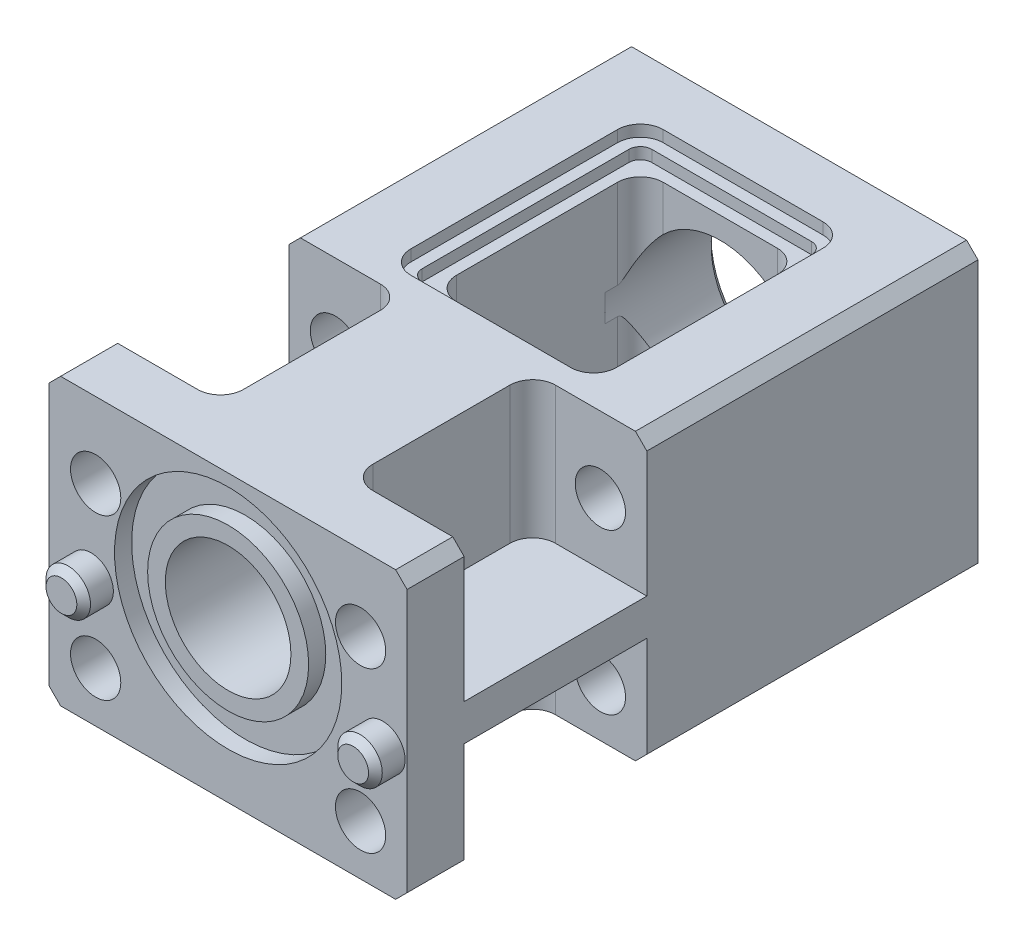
ISO-10303-21;
HEADER;
FILE_DESCRIPTION(('STEP AP214'),'2;1');
FILE_NAME('part.step','',(''),(''),'','','');
FILE_SCHEMA(('AUTOMOTIVE_DESIGN { 1 0 10303 214 1 1 1 1 }'));
ENDSEC;
DATA;
#1=APPLICATION_CONTEXT('core data for automotive mechanical design processes');
#2=APPLICATION_PROTOCOL_DEFINITION('international standard','automotive_design',2000,#1);
#3=PRODUCT_CONTEXT('',#1,'mechanical');
#4=PRODUCT('Part','Part','',(#3));
#5=PRODUCT_RELATED_PRODUCT_CATEGORY('part','',(#4));
#6=PRODUCT_DEFINITION_FORMATION('','',#4);
#7=PRODUCT_DEFINITION_CONTEXT('part definition',#1,'design');
#8=PRODUCT_DEFINITION('design','',#6,#7);
#9=PRODUCT_DEFINITION_SHAPE('','',#8);
#10=(LENGTH_UNIT() NAMED_UNIT(*) SI_UNIT(.MILLI.,.METRE.));
#11=(NAMED_UNIT(*) PLANE_ANGLE_UNIT() SI_UNIT($,.RADIAN.));
#12=(NAMED_UNIT(*) SI_UNIT($,.STERADIAN.) SOLID_ANGLE_UNIT());
#13=UNCERTAINTY_MEASURE_WITH_UNIT(LENGTH_MEASURE(1.E-05),#10,'distance_accuracy_value','');
#14=(GEOMETRIC_REPRESENTATION_CONTEXT(3) GLOBAL_UNCERTAINTY_ASSIGNED_CONTEXT((#13)) GLOBAL_UNIT_ASSIGNED_CONTEXT((#10,
#11,#12)) REPRESENTATION_CONTEXT('',''));
#15=CARTESIAN_POINT('',(0.,0.,0.));
#16=DIRECTION('',(0.,0.,1.));
#17=DIRECTION('',(1.,0.,0.));
#18=AXIS2_PLACEMENT_3D('',#15,#16,#17);
#19=CARTESIAN_POINT('',(-3.5,-2.6,12.5));
#20=DIRECTION('',(0.,0.,1.));
#21=DIRECTION('',(1.,0.,0.));
#22=AXIS2_PLACEMENT_3D('',#19,#20,#21);
#23=PLANE('',#22);
#24=DIRECTION('',(0.,1.,0.));
#25=VECTOR('',#24,1.);
#26=CARTESIAN_POINT('',(2.5,-2.6,12.5));
#27=LINE('',#26,#25);
#28=CARTESIAN_POINT('',(2.5,5.4,12.5));
#29=VERTEX_POINT('',#28);
#30=CARTESIAN_POINT('',(2.5,2.04564392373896,12.5));
#31=VERTEX_POINT('',#30);
#32=EDGE_CURVE('E494',#29,#31,#27,.F.);
#33=ORIENTED_EDGE('',*,*,#32,.T.);
#34=CARTESIAN_POINT('',(0.,0.900000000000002,12.5));
#35=DIRECTION('',(0.,0.,1.));
#36=DIRECTION('',(1.,0.,0.));
#37=AXIS2_PLACEMENT_3D('',#34,#35,#36);
#38=CIRCLE('',#37,2.75);
#39=CARTESIAN_POINT('',(-2.5,2.04564392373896,12.5));
#40=VERTEX_POINT('',#39);
#41=EDGE_CURVE('E482',#31,#40,#38,.T.);
#42=ORIENTED_EDGE('',*,*,#41,.T.);
#43=DIRECTION('',(0.,1.,0.));
#44=VECTOR('',#43,1.);
#45=CARTESIAN_POINT('',(-2.5,6.1,12.5));
#46=LINE('',#45,#44);
#47=CARTESIAN_POINT('',(-2.5,5.4,12.5));
#48=VERTEX_POINT('',#47);
#49=EDGE_CURVE('E491',#40,#48,#46,.T.);
#50=ORIENTED_EDGE('',*,*,#49,.T.);
#51=DIRECTION('',(-1.,0.,0.));
#52=VECTOR('',#51,1.);
#53=CARTESIAN_POINT('',(-3.5,5.4,12.5));
#54=LINE('',#53,#52);
#55=EDGE_CURVE('E848',#29,#48,#54,.T.);
#56=ORIENTED_EDGE('',*,*,#55,.F.);
#57=EDGE_LOOP('',(#33,#42,#50,#56));
#58=FACE_BOUND('',#57,.T.);
#59=ADVANCED_FACE('F42',(#58),#23,.F.);
#60=CARTESIAN_POINT('',(-5.8,3.1,0.));
#61=DIRECTION('',(0.,0.,-1.));
#62=DIRECTION('',(-1.,0.,0.));
#63=AXIS2_PLACEMENT_3D('',#60,#61,#62);
#64=CYLINDRICAL_SURFACE('',#63,0.799999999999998);
#65=CARTESIAN_POINT('',(-5.8,3.1,0.));
#66=DIRECTION('',(0.,0.,-1.));
#67=DIRECTION('',(-1.,0.,0.));
#68=AXIS2_PLACEMENT_3D('',#65,#66,#67);
#69=CIRCLE('',#68,0.799999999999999);
#70=CARTESIAN_POINT('',(-6.6,3.1,0.));
#71=VERTEX_POINT('',#70);
#72=EDGE_CURVE('E625',#71,#71,#69,.T.);
#73=ORIENTED_EDGE('',*,*,#72,.T.);
#74=EDGE_LOOP('',(#73));
#75=FACE_BOUND('',#74,.T.);
#76=CARTESIAN_POINT('',(-5.8,3.1,4.5));
#77=DIRECTION('',(0.,0.,1.));
#78=DIRECTION('',(1.,0.,0.));
#79=AXIS2_PLACEMENT_3D('',#76,#77,#78);
#80=CIRCLE('',#79,0.799999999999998);
#81=CARTESIAN_POINT('',(-5.,3.1,4.5));
#82=VERTEX_POINT('',#81);
#83=EDGE_CURVE('E1290',#82,#82,#80,.F.);
#84=ORIENTED_EDGE('',*,*,#83,.F.);
#85=EDGE_LOOP('',(#84));
#86=FACE_BOUND('',#85,.T.);
#87=ADVANCED_FACE('F1395',(#75,#86),#64,.F.);
#88=CARTESIAN_POINT('',(-5.8,-3.9,0.));
#89=DIRECTION('',(0.,0.,-1.));
#90=DIRECTION('',(-1.,0.,0.));
#91=AXIS2_PLACEMENT_3D('',#88,#89,#90);
#92=CYLINDRICAL_SURFACE('',#91,0.799999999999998);
#93=CARTESIAN_POINT('',(-5.8,-3.9,0.));
#94=DIRECTION('',(0.,0.,-1.));
#95=DIRECTION('',(-1.,0.,0.));
#96=AXIS2_PLACEMENT_3D('',#93,#94,#95);
#97=CIRCLE('',#96,0.799999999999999);
#98=CARTESIAN_POINT('',(-6.6,-3.9,0.));
#99=VERTEX_POINT('',#98);
#100=EDGE_CURVE('E621',#99,#99,#97,.T.);
#101=ORIENTED_EDGE('',*,*,#100,.T.);
#102=EDGE_LOOP('',(#101));
#103=FACE_BOUND('',#102,.T.);
#104=CARTESIAN_POINT('',(-5.8,-3.9,4.5));
#105=DIRECTION('',(0.,0.,1.));
#106=DIRECTION('',(1.,0.,0.));
#107=AXIS2_PLACEMENT_3D('',#104,#105,#106);
#108=CIRCLE('',#107,0.799999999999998);
#109=CARTESIAN_POINT('',(-5.,-3.9,4.5));
#110=VERTEX_POINT('',#109);
#111=EDGE_CURVE('E854',#110,#110,#108,.F.);
#112=ORIENTED_EDGE('',*,*,#111,.F.);
#113=EDGE_LOOP('',(#112));
#114=FACE_BOUND('',#113,.T.);
#115=ADVANCED_FACE('F1403',(#103,#114),#92,.F.);
#116=CARTESIAN_POINT('',(5.8,-3.9,0.));
#117=DIRECTION('',(0.,0.,-1.));
#118=DIRECTION('',(-1.,0.,0.));
#119=AXIS2_PLACEMENT_3D('',#116,#117,#118);
#120=CYLINDRICAL_SURFACE('',#119,0.799999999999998);
#121=CARTESIAN_POINT('',(5.8,-3.9,0.));
#122=DIRECTION('',(0.,0.,-1.));
#123=DIRECTION('',(-1.,0.,0.));
#124=AXIS2_PLACEMENT_3D('',#121,#122,#123);
#125=CIRCLE('',#124,0.799999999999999);
#126=CARTESIAN_POINT('',(5.,-3.9,0.));
#127=VERTEX_POINT('',#126);
#128=EDGE_CURVE('E617',#127,#127,#125,.T.);
#129=ORIENTED_EDGE('',*,*,#128,.T.);
#130=EDGE_LOOP('',(#129));
#131=FACE_BOUND('',#130,.T.);
#132=CARTESIAN_POINT('',(5.8,-3.9,4.5));
#133=DIRECTION('',(0.,0.,1.));
#134=DIRECTION('',(1.,0.,0.));
#135=AXIS2_PLACEMENT_3D('',#132,#133,#134);
#136=CIRCLE('',#135,0.799999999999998);
#137=CARTESIAN_POINT('',(6.59999999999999,-3.9,4.5));
#138=VERTEX_POINT('',#137);
#139=EDGE_CURVE('E851',#138,#138,#136,.F.);
#140=ORIENTED_EDGE('',*,*,#139,.F.);
#141=EDGE_LOOP('',(#140));
#142=FACE_BOUND('',#141,.T.);
#143=ADVANCED_FACE('F2048',(#131,#142),#120,.F.);
#144=CARTESIAN_POINT('',(5.8,3.09999999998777,0.));
#145=DIRECTION('',(0.,0.,-1.));
#146=DIRECTION('',(-1.,0.,0.));
#147=AXIS2_PLACEMENT_3D('',#144,#145,#146);
#148=CYLINDRICAL_SURFACE('',#147,0.799999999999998);
#149=CARTESIAN_POINT('',(5.8,3.09999999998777,0.));
#150=DIRECTION('',(0.,0.,-1.));
#151=DIRECTION('',(-1.,0.,0.));
#152=AXIS2_PLACEMENT_3D('',#149,#150,#151);
#153=CIRCLE('',#152,0.799999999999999);
#154=CARTESIAN_POINT('',(5.,3.09999999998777,0.));
#155=VERTEX_POINT('',#154);
#156=EDGE_CURVE('E613',#155,#155,#153,.T.);
#157=ORIENTED_EDGE('',*,*,#156,.T.);
#158=EDGE_LOOP('',(#157));
#159=FACE_BOUND('',#158,.T.);
#160=CARTESIAN_POINT('',(5.8,3.09999999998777,4.5));
#161=DIRECTION('',(0.,0.,1.));
#162=DIRECTION('',(1.,0.,0.));
#163=AXIS2_PLACEMENT_3D('',#160,#161,#162);
#164=CIRCLE('',#163,0.799999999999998);
#165=CARTESIAN_POINT('',(6.59999999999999,3.09999999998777,4.5));
#166=VERTEX_POINT('',#165);
#167=EDGE_CURVE('E1283',#166,#166,#164,.F.);
#168=ORIENTED_EDGE('',*,*,#167,.F.);
#169=EDGE_LOOP('',(#168));
#170=FACE_BOUND('',#169,.T.);
#171=ADVANCED_FACE('F2058',(#159,#170),#148,.F.);
#172=CARTESIAN_POINT('',(0.,0.,25.));
#173=DIRECTION('',(0.,0.,1.));
#174=DIRECTION('',(1.,0.,0.));
#175=AXIS2_PLACEMENT_3D('',#172,#173,#174);
#176=PLANE('',#175);
#177=CARTESIAN_POINT('',(0.,0.900000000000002,25.));
#178=DIRECTION('',(0.,0.,1.));
#179=DIRECTION('',(1.,0.,0.));
#180=AXIS2_PLACEMENT_3D('',#177,#178,#179);
#181=CIRCLE('',#180,2.75);
#182=CARTESIAN_POINT('',(2.75,0.900000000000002,25.));
#183=VERTEX_POINT('',#182);
#184=EDGE_CURVE('E2824',#183,#183,#181,.T.);
#185=ORIENTED_EDGE('',*,*,#184,.F.);
#186=EDGE_LOOP('',(#185));
#187=FACE_BOUND('',#186,.T.);
#188=CARTESIAN_POINT('',(0.,0.900000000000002,25.));
#189=DIRECTION('',(0.,0.,1.));
#190=DIRECTION('',(1.,0.,0.));
#191=AXIS2_PLACEMENT_3D('',#188,#189,#190);
#192=CIRCLE('',#191,3.525);
#193=CARTESIAN_POINT('',(3.525,0.900000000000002,25.));
#194=VERTEX_POINT('',#193);
#195=EDGE_CURVE('E861',#194,#194,#192,.T.);
#196=ORIENTED_EDGE('',*,*,#195,.T.);
#197=EDGE_LOOP('',(#196));
#198=FACE_BOUND('',#197,.T.);
#199=ADVANCED_FACE('F1418',(#187,#198),#176,.T.);
#200=CARTESIAN_POINT('',(-3.5,-2.6,3.45));
#201=DIRECTION('',(0.,0.,-1.));
#202=DIRECTION('',(-1.,0.,0.));
#203=AXIS2_PLACEMENT_3D('',#200,#201,#202);
#204=PLANE('',#203);
#205=DIRECTION('',(1.,0.,0.));
#206=VECTOR('',#205,1.);
#207=CARTESIAN_POINT('',(-3.5,5.4,3.45));
#208=LINE('',#207,#206);
#209=CARTESIAN_POINT('',(-2.5,5.4,3.45));
#210=VERTEX_POINT('',#209);
#211=CARTESIAN_POINT('',(2.5,5.4,3.45));
#212=VERTEX_POINT('',#211);
#213=EDGE_CURVE('E1062',#210,#212,#208,.T.);
#214=ORIENTED_EDGE('',*,*,#213,.F.);
#215=DIRECTION('',(0.,1.,0.));
#216=VECTOR('',#215,1.);
#217=CARTESIAN_POINT('',(-2.5,-2.6,3.45));
#218=LINE('',#217,#216);
#219=CARTESIAN_POINT('',(-2.5,3.42041663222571,3.45));
#220=VERTEX_POINT('',#219);
#221=EDGE_CURVE('E763',#210,#220,#218,.F.);
#222=ORIENTED_EDGE('',*,*,#221,.T.);
#223=CARTESIAN_POINT('',(0.,0.900000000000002,3.45));
#224=DIRECTION('',(0.,0.,-1.));
#225=DIRECTION('',(-1.,0.,0.));
#226=AXIS2_PLACEMENT_3D('',#223,#224,#225);
#227=CIRCLE('',#226,3.55);
#228=CARTESIAN_POINT('',(2.5,3.42041663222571,3.45));
#229=VERTEX_POINT('',#228);
#230=EDGE_CURVE('E560',#220,#229,#227,.T.);
#231=ORIENTED_EDGE('',*,*,#230,.T.);
#232=DIRECTION('',(0.,1.,0.));
#233=VECTOR('',#232,1.);
#234=CARTESIAN_POINT('',(2.5,6.1,3.45));
#235=LINE('',#234,#233);
#236=EDGE_CURVE('E757',#229,#212,#235,.T.);
#237=ORIENTED_EDGE('',*,*,#236,.T.);
#238=EDGE_LOOP('',(#214,#222,#231,#237));
#239=FACE_BOUND('',#238,.T.);
#240=ADVANCED_FACE('F1410',(#239),#204,.F.);
#241=CARTESIAN_POINT('',(-2.5,-2.6,12.5));
#242=VERTEX_POINT('',#241);
#243=CARTESIAN_POINT('',(-2.5,-0.245643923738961,12.5));
#244=VERTEX_POINT('',#243);
#245=EDGE_CURVE('E502',#242,#244,#46,.T.);
#246=ORIENTED_EDGE('',*,*,#245,.T.);
#247=CARTESIAN_POINT('',(2.5,-0.245643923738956,12.5));
#248=VERTEX_POINT('',#247);
#249=EDGE_CURVE('E62',#244,#248,#38,.T.);
#250=ORIENTED_EDGE('',*,*,#249,.T.);
#251=CARTESIAN_POINT('',(2.5,-2.6,12.5));
#252=VERTEX_POINT('',#251);
#253=EDGE_CURVE('E508',#248,#252,#27,.F.);
#254=ORIENTED_EDGE('',*,*,#253,.T.);
#255=DIRECTION('',(1.,0.,0.));
#256=VECTOR('',#255,1.);
#257=CARTESIAN_POINT('',(-3.5,-2.6,12.5));
#258=LINE('',#257,#256);
#259=EDGE_CURVE('E601',#242,#252,#258,.T.);
#260=ORIENTED_EDGE('',*,*,#259,.F.);
#261=EDGE_LOOP('',(#246,#250,#254,#260));
#262=FACE_BOUND('',#261,.T.);
#263=ADVANCED_FACE('F1397',(#262),#23,.F.);
#264=CARTESIAN_POINT('',(-3.5,-2.6,12.5));
#265=DIRECTION('',(-1.,0.,0.));
#266=DIRECTION('',(0.,0.,1.));
#267=AXIS2_PLACEMENT_3D('',#264,#265,#266);
#268=PLANE('',#267);
#269=DIRECTION('',(0.,0.,-1.));
#270=VECTOR('',#269,1.);
#271=CARTESIAN_POINT('',(-3.5,5.4,12.5));
#272=LINE('',#271,#270);
#273=CARTESIAN_POINT('',(-3.5,5.4,11.5));
#274=VERTEX_POINT('',#273);
#275=CARTESIAN_POINT('',(-3.5,5.4,4.45));
#276=VERTEX_POINT('',#275);
#277=EDGE_CURVE('E846',#274,#276,#272,.T.);
#278=ORIENTED_EDGE('',*,*,#277,.F.);
#279=DIRECTION('',(0.,1.,0.));
#280=VECTOR('',#279,1.);
#281=CARTESIAN_POINT('',(-3.5,-2.6,11.5));
#282=LINE('',#281,#280);
#283=CARTESIAN_POINT('',(-3.5,-2.6,11.5));
#284=VERTEX_POINT('',#283);
#285=EDGE_CURVE('E749',#274,#284,#282,.F.);
#286=ORIENTED_EDGE('',*,*,#285,.T.);
#287=DIRECTION('',(0.,0.,1.));
#288=VECTOR('',#287,1.);
#289=CARTESIAN_POINT('',(-3.5,-2.6,12.5));
#290=LINE('',#289,#288);
#291=CARTESIAN_POINT('',(-3.5,-2.6,4.45));
#292=VERTEX_POINT('',#291);
#293=EDGE_CURVE('E597',#292,#284,#290,.T.);
#294=ORIENTED_EDGE('',*,*,#293,.F.);
#295=DIRECTION('',(0.,1.,0.));
#296=VECTOR('',#295,1.);
#297=CARTESIAN_POINT('',(-3.5,6.1,4.45));
#298=LINE('',#297,#296);
#299=CARTESIAN_POINT('',(-3.5,0.3062828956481,4.45));
#300=VERTEX_POINT('',#299);
#301=EDGE_CURVE('E753',#292,#300,#298,.T.);
#302=ORIENTED_EDGE('',*,*,#301,.T.);
#303=DIRECTION('',(0.,0.,-1.));
#304=VECTOR('',#303,1.);
#305=CARTESIAN_POINT('',(-3.5,0.3062828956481,5.));
#306=LINE('',#305,#304);
#307=CARTESIAN_POINT('',(-3.5,0.3062828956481,5.));
#308=VERTEX_POINT('',#307);
#309=EDGE_CURVE('E581',#300,#308,#306,.F.);
#310=ORIENTED_EDGE('',*,*,#309,.T.);
#311=DIRECTION('',(0.,-1.,0.));
#312=VECTOR('',#311,1.);
#313=CARTESIAN_POINT('',(-3.5,-2.6,5.));
#314=LINE('',#313,#312);
#315=CARTESIAN_POINT('',(-3.5,1.4937171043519,5.));
#316=VERTEX_POINT('',#315);
#317=EDGE_CURVE('E594',#316,#308,#314,.T.);
#318=ORIENTED_EDGE('',*,*,#317,.F.);
#319=DIRECTION('',(0.,0.,-1.));
#320=VECTOR('',#319,1.);
#321=CARTESIAN_POINT('',(-3.5,1.4937171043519,5.));
#322=LINE('',#321,#320);
#323=CARTESIAN_POINT('',(-3.5,1.4937171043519,4.45));
#324=VERTEX_POINT('',#323);
#325=EDGE_CURVE('E559',#316,#324,#322,.T.);
#326=ORIENTED_EDGE('',*,*,#325,.T.);
#327=EDGE_CURVE('E752',#324,#276,#298,.T.);
#328=ORIENTED_EDGE('',*,*,#327,.T.);
#329=EDGE_LOOP('',(#278,#286,#294,#302,#310,#318,#326,#328));
#330=FACE_BOUND('',#329,.T.);
#331=ADVANCED_FACE('F1409',(#330),#268,.F.);
#332=CARTESIAN_POINT('',(3.5,-2.6,12.5));
#333=DIRECTION('',(1.,0.,0.));
#334=DIRECTION('',(0.,0.,-1.));
#335=AXIS2_PLACEMENT_3D('',#332,#333,#334);
#336=PLANE('',#335);
#337=DIRECTION('',(0.,0.,1.));
#338=VECTOR('',#337,1.);
#339=CARTESIAN_POINT('',(3.5,5.4,12.5));
#340=LINE('',#339,#338);
#341=CARTESIAN_POINT('',(3.5,5.4,4.45));
#342=VERTEX_POINT('',#341);
#343=CARTESIAN_POINT('',(3.5,5.4,11.5));
#344=VERTEX_POINT('',#343);
#345=EDGE_CURVE('E1059',#342,#344,#340,.T.);
#346=ORIENTED_EDGE('',*,*,#345,.F.);
#347=DIRECTION('',(0.,1.,0.));
#348=VECTOR('',#347,1.);
#349=CARTESIAN_POINT('',(3.5,-2.6,4.45));
#350=LINE('',#349,#348);
#351=CARTESIAN_POINT('',(3.5,1.49371710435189,4.45));
#352=VERTEX_POINT('',#351);
#353=EDGE_CURVE('E503',#342,#352,#350,.F.);
#354=ORIENTED_EDGE('',*,*,#353,.T.);
#355=DIRECTION('',(0.,0.,-1.));
#356=VECTOR('',#355,1.);
#357=CARTESIAN_POINT('',(3.5,1.49371710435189,5.));
#358=LINE('',#357,#356);
#359=CARTESIAN_POINT('',(3.5,1.49371710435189,5.));
#360=VERTEX_POINT('',#359);
#361=EDGE_CURVE('E817',#352,#360,#358,.F.);
#362=ORIENTED_EDGE('',*,*,#361,.T.);
#363=DIRECTION('',(0.,1.,0.));
#364=VECTOR('',#363,1.);
#365=CARTESIAN_POINT('',(3.5,-2.6,5.));
#366=LINE('',#365,#364);
#367=CARTESIAN_POINT('',(3.5,0.306282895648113,5.));
#368=VERTEX_POINT('',#367);
#369=EDGE_CURVE('E591',#368,#360,#366,.T.);
#370=ORIENTED_EDGE('',*,*,#369,.F.);
#371=DIRECTION('',(0.,0.,-1.));
#372=VECTOR('',#371,1.);
#373=CARTESIAN_POINT('',(3.5,0.306282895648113,5.));
#374=LINE('',#373,#372);
#375=CARTESIAN_POINT('',(3.5,0.306282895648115,4.45));
#376=VERTEX_POINT('',#375);
#377=EDGE_CURVE('E790',#368,#376,#374,.T.);
#378=ORIENTED_EDGE('',*,*,#377,.T.);
#379=CARTESIAN_POINT('',(3.5,-2.6,4.45));
#380=VERTEX_POINT('',#379);
#381=EDGE_CURVE('E510',#376,#380,#350,.F.);
#382=ORIENTED_EDGE('',*,*,#381,.T.);
#383=DIRECTION('',(0.,0.,-1.));
#384=VECTOR('',#383,1.);
#385=CARTESIAN_POINT('',(3.5,-2.6,12.5));
#386=LINE('',#385,#384);
#387=CARTESIAN_POINT('',(3.5,-2.6,11.5));
#388=VERTEX_POINT('',#387);
#389=EDGE_CURVE('E604',#388,#380,#386,.T.);
#390=ORIENTED_EDGE('',*,*,#389,.F.);
#391=DIRECTION('',(0.,1.,0.));
#392=VECTOR('',#391,1.);
#393=CARTESIAN_POINT('',(3.5,6.1,11.5));
#394=LINE('',#393,#392);
#395=EDGE_CURVE('E777',#388,#344,#394,.T.);
#396=ORIENTED_EDGE('',*,*,#395,.T.);
#397=EDGE_LOOP('',(#346,#354,#362,#370,#378,#382,#390,#396));
#398=FACE_BOUND('',#397,.T.);
#399=ADVANCED_FACE('F567',(#398),#336,.F.);
#400=CARTESIAN_POINT('',(-2.5,-2.6,4.45));
#401=DIRECTION('',(0.,-1.,0.));
#402=DIRECTION('',(0.,0.,-1.));
#403=AXIS2_PLACEMENT_3D('',#400,#401,#402);
#404=CYLINDRICAL_SURFACE('',#403,1.);
#405=CARTESIAN_POINT('',(-2.5,5.4,4.45));
#406=DIRECTION('',(0.,1.,0.));
#407=DIRECTION('',(0.,0.,1.));
#408=AXIS2_PLACEMENT_3D('',#405,#406,#407);
#409=CIRCLE('',#408,1.);
#410=EDGE_CURVE('E957',#276,#210,#409,.F.);
#411=ORIENTED_EDGE('',*,*,#410,.F.);
#412=ORIENTED_EDGE('',*,*,#327,.F.);
#413=CARTESIAN_POINT('',(-3.5,1.4937171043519,4.45));
#414=CARTESIAN_POINT('',(-3.50000577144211,1.49367468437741,4.43887640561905));
#415=CARTESIAN_POINT('',(-3.49981471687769,1.49481016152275,4.42782101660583));
#416=CARTESIAN_POINT('',(-3.4990999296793,1.49900459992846,4.40629728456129));
#417=CARTESIAN_POINT('',(-3.49858249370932,1.50202714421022,4.39582182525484));
#418=CARTESIAN_POINT('',(-3.49700896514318,1.51110985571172,4.37138954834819));
#419=CARTESIAN_POINT('',(-3.49582002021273,1.51790235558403,4.35772337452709));
#420=CARTESIAN_POINT('',(-3.49304005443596,1.5334308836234,4.33147904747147));
#421=CARTESIAN_POINT('',(-3.49144537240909,1.54218451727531,4.31891228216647));
#422=CARTESIAN_POINT('',(-3.48716101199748,1.5651296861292,4.28928599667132));
#423=CARTESIAN_POINT('',(-3.48430284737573,1.57998610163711,4.27277604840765));
#424=CARTESIAN_POINT('',(-3.47809023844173,1.61108633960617,4.24120145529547));
#425=CARTESIAN_POINT('',(-3.47473459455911,1.62733347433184,4.22614045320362));
#426=CARTESIAN_POINT('',(-3.46400252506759,1.67739639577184,4.18239912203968));
#427=CARTESIAN_POINT('',(-3.45598048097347,1.712425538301,4.1552799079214));
#428=CARTESIAN_POINT('',(-3.43934474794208,1.78005838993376,4.10616502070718));
#429=CARTESIAN_POINT('',(-3.4308804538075,1.8125331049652,4.0839300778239));
#430=CARTESIAN_POINT('',(-3.41277135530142,1.87808317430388,4.04086155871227));
#431=CARTESIAN_POINT('',(-3.40312643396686,1.91115858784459,4.02002812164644));
#432=CARTESIAN_POINT('',(-3.37240612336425,2.01095605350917,3.95909733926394));
#433=CARTESIAN_POINT('',(-3.34957061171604,2.07814425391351,3.92064192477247));
#434=CARTESIAN_POINT('',(-3.29915702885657,2.21272322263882,3.84723743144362));
#435=CARTESIAN_POINT('',(-3.27157481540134,2.28011411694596,3.81229145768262));
#436=CARTESIAN_POINT('',(-3.21159699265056,2.41444687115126,3.74599270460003));
#437=CARTESIAN_POINT('',(-3.17920564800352,2.48138907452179,3.7146367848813));
#438=CARTESIAN_POINT('',(-3.10920390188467,2.61495825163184,3.65565705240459));
#439=CARTESIAN_POINT('',(-3.07155500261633,2.68157876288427,3.62806404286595));
#440=CARTESIAN_POINT('',(-2.99110076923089,2.81358090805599,3.5776034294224));
#441=CARTESIAN_POINT('',(-2.94829194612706,2.87896166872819,3.55473905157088));
#442=CARTESIAN_POINT('',(-2.85783614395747,3.00746425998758,3.51491737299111));
#443=CARTESIAN_POINT('',(-2.81022463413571,3.0705985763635,3.49792035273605));
#444=CARTESIAN_POINT('',(-2.71010776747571,3.19436841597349,3.47095194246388));
#445=CARTESIAN_POINT('',(-2.65761085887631,3.25500800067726,3.46096867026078));
#446=CARTESIAN_POINT('',(-2.58617505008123,3.3320378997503,3.45357793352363));
#447=CARTESIAN_POINT('',(-2.56922102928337,3.34994142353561,3.4522508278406));
#448=CARTESIAN_POINT('',(-2.53490694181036,3.3854286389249,3.45046166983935));
#449=CARTESIAN_POINT('',(-2.51754653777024,3.40301204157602,3.45000036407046));
#450=CARTESIAN_POINT('',(-2.5,3.42041663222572,3.44999999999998));
#451=B_SPLINE_CURVE_WITH_KNOTS('',3,(#413,#414,#415,#416,#417,#418,#419,#420,#421,#422,#423,
#424,#425,#426,#427,#428,#429,#430,#431,#432,#433,#434,#435,#436,#437,#438,#439,#440,#441,#442,
#443,#444,#445,#446,#447,#448,#449,#450),.UNSPECIFIED.,.F.,.F.,(4,2,2,2,2,2,2,2,2,2,2,2,2,2,2,2,
2,2,4),(0.,0.0332026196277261,0.0657834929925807,0.111443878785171,0.157531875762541,
0.224537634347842,0.291707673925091,0.426530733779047,0.547266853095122,0.668014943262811,
0.909900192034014,1.15199760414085,1.39388159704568,1.63763996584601,1.88156409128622,
2.12380299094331,2.36563051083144,2.43969289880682,2.51381911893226),.UNSPECIFIED.);
#452=EDGE_CURVE('E551',#324,#220,#451,.T.);
#453=ORIENTED_EDGE('',*,*,#452,.T.);
#454=ORIENTED_EDGE('',*,*,#221,.F.);
#455=EDGE_LOOP('',(#411,#412,#453,#454));
#456=FACE_BOUND('',#455,.T.);
#457=ADVANCED_FACE('F563',(#456),#404,.F.);
#458=CARTESIAN_POINT('',(2.5,-2.6,4.45));
#459=DIRECTION('',(0.,-1.,0.));
#460=DIRECTION('',(0.,0.,-1.));
#461=AXIS2_PLACEMENT_3D('',#458,#459,#460);
#462=CYLINDRICAL_SURFACE('',#461,1.);
#463=CARTESIAN_POINT('',(2.5,5.4,4.45));
#464=DIRECTION('',(0.,1.,0.));
#465=DIRECTION('',(0.,0.,1.));
#466=AXIS2_PLACEMENT_3D('',#463,#464,#465);
#467=CIRCLE('',#466,1.);
#468=EDGE_CURVE('E1065',#212,#342,#467,.F.);
#469=ORIENTED_EDGE('',*,*,#468,.F.);
#470=ORIENTED_EDGE('',*,*,#236,.F.);
#471=CARTESIAN_POINT('',(2.5,3.42041663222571,3.45));
#472=CARTESIAN_POINT('',(2.54036444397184,3.38039207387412,3.45001436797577));
#473=CARTESIAN_POINT('',(2.57971750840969,3.33942246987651,3.45244203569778));
#474=CARTESIAN_POINT('',(2.65613482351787,3.2559764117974,3.46151323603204));
#475=CARTESIAN_POINT('',(2.69320312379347,3.21350284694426,3.46814905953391));
#476=CARTESIAN_POINT('',(2.76474681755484,3.12750832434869,3.48498630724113));
#477=CARTESIAN_POINT('',(2.79923471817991,3.08399397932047,3.49516896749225));
#478=CARTESIAN_POINT('',(2.86577632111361,2.99591839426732,3.51862841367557));
#479=CARTESIAN_POINT('',(2.89782848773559,2.95135651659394,3.53190713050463));
#480=CARTESIAN_POINT('',(2.97342181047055,2.84101491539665,3.56776986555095));
#481=CARTESIAN_POINT('',(3.01558599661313,2.77477246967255,3.59184363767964));
#482=CARTESIAN_POINT('',(3.09471946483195,2.64104931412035,3.6446595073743));
#483=CARTESIAN_POINT('',(3.13168642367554,2.57356806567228,3.67340368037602));
#484=CARTESIAN_POINT('',(3.20059137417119,2.43770238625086,3.73494090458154));
#485=CARTESIAN_POINT('',(3.23251903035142,2.36931640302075,3.76774203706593));
#486=CARTESIAN_POINT('',(3.2913768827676,2.23225139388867,3.83698144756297));
#487=CARTESIAN_POINT('',(3.31830804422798,2.16357242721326,3.87341902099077));
#488=CARTESIAN_POINT('',(3.35756598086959,2.05376772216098,3.93489648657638));
#489=CARTESIAN_POINT('',(3.37144990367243,2.01251264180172,3.95872820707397));
#490=CARTESIAN_POINT('',(3.39744074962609,1.93041043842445,4.00798413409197));
#491=CARTESIAN_POINT('',(3.40954850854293,1.88956313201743,4.03340758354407));
#492=CARTESIAN_POINT('',(3.42835689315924,1.82177963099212,4.07780174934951));
#493=CARTESIAN_POINT('',(3.43554171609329,1.79460713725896,4.0962079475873));
#494=CARTESIAN_POINT('',(3.44908835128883,1.74086652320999,4.13433741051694));
#495=CARTESIAN_POINT('',(3.45544810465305,1.71430004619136,4.15406379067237));
#496=CARTESIAN_POINT('',(3.46725989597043,1.66244150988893,4.19530571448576));
#497=CARTESIAN_POINT('',(3.47271299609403,1.63714798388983,4.21681911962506));
#498=CARTESIAN_POINT('',(3.48258651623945,1.58896870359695,4.26270048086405));
#499=CARTESIAN_POINT('',(3.48701029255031,1.5660752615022,4.28705875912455));
#500=CARTESIAN_POINT('',(3.49211736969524,1.53849987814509,4.32426027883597));
#501=CARTESIAN_POINT('',(3.49343519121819,1.53123391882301,4.33505209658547));
#502=CARTESIAN_POINT('',(3.49577169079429,1.51816081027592,4.35744856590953));
#503=CARTESIAN_POINT('',(3.49679224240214,1.51234455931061,4.36904752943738));
#504=CARTESIAN_POINT('',(3.49837035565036,1.50326233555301,4.39192678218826));
#505=CARTESIAN_POINT('',(3.49896406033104,1.49979923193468,4.40312256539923));
#506=CARTESIAN_POINT('',(3.49978593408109,1.49498042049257,4.42617629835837));
#507=CARTESIAN_POINT('',(3.50000709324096,1.493665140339,4.43804269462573));
#508=CARTESIAN_POINT('',(3.5,1.49371710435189,4.45));
#509=B_SPLINE_CURVE_WITH_KNOTS('',3,(#471,#472,#473,#474,#475,#476,#477,#478,#479,#480,#481,
#482,#483,#484,#485,#486,#487,#488,#489,#490,#491,#492,#493,#494,#495,#496,#497,#498,#499,#500,
#501,#502,#503,#504,#505,#506,#507,#508),.UNSPECIFIED.,.F.,.F.,(4,2,2,2,2,2,2,2,2,2,2,2,2,2,2,2,
2,2,4),(0.,0.170389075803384,0.34046690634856,0.509658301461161,0.678955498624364,
0.924983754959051,1.17112164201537,1.41775796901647,1.66434660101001,1.81317807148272,
1.96193928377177,2.06270516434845,2.16371785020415,2.2646113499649,2.36517110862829,
2.40432383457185,2.4432241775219,2.47822703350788,2.51388144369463),.UNSPECIFIED.);
#510=EDGE_CURVE('E516',#229,#352,#509,.T.);
#511=ORIENTED_EDGE('',*,*,#510,.T.);
#512=ORIENTED_EDGE('',*,*,#353,.F.);
#513=EDGE_LOOP('',(#469,#470,#511,#512));
#514=FACE_BOUND('',#513,.T.);
#515=ADVANCED_FACE('F530',(#514),#462,.F.);
#516=CARTESIAN_POINT('',(2.5,-2.6,11.5));
#517=DIRECTION('',(0.,-1.,0.));
#518=DIRECTION('',(0.,0.,-1.));
#519=AXIS2_PLACEMENT_3D('',#516,#517,#518);
#520=CYLINDRICAL_SURFACE('',#519,1.);
#521=ORIENTED_EDGE('',*,*,#253,.F.);
#522=CARTESIAN_POINT('',(2.5,-0.245643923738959,12.5));
#523=CARTESIAN_POINT('',(2.53136808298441,-0.177207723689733,12.4999554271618));
#524=CARTESIAN_POINT('',(2.55990102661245,-0.107509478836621,12.4985239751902));
#525=CARTESIAN_POINT('',(2.61114781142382,0.0339423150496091,12.4941481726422));
#526=CARTESIAN_POINT('',(2.6338624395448,0.105695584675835,12.4912040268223));
#527=CARTESIAN_POINT('',(2.67331215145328,0.250733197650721,12.4850661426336));
#528=CARTESIAN_POINT('',(2.69005332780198,0.324015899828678,12.4818726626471));
#529=CARTESIAN_POINT('',(2.71748556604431,0.471731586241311,12.4761651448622));
#530=CARTESIAN_POINT('',(2.7281768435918,0.546164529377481,12.473651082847));
#531=CARTESIAN_POINT('',(2.74358590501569,0.697225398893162,12.4699126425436));
#532=CARTESIAN_POINT('',(2.74817676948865,0.773867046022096,12.4687157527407));
#533=CARTESIAN_POINT('',(2.75093479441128,0.927279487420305,12.4680050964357));
#534=CARTESIAN_POINT('',(2.74910145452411,1.00405029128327,12.4684914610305));
#535=CARTESIAN_POINT('',(2.73903019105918,1.15707440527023,12.4710258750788));
#536=CARTESIAN_POINT('',(2.73079807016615,1.23332812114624,12.4730725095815));
#537=CARTESIAN_POINT('',(2.70800989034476,1.38482098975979,12.4781956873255));
#538=CARTESIAN_POINT('',(2.69345525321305,1.46006036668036,12.4812719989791));
#539=CARTESIAN_POINT('',(2.6549596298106,1.62237608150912,12.488148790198));
#540=CARTESIAN_POINT('',(2.62980725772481,1.70916921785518,12.4919805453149));
#541=CARTESIAN_POINT('',(2.58578777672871,1.83714247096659,12.4964212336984));
#542=CARTESIAN_POINT('',(2.57007616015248,1.87940891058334,12.4976833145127));
#543=CARTESIAN_POINT('',(2.53658219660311,1.96314841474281,12.4994706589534));
#544=CARTESIAN_POINT('',(2.51879899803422,2.00462114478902,12.4999956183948));
#545=CARTESIAN_POINT('',(2.5,2.04564392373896,12.5));
#546=B_SPLINE_CURVE_WITH_KNOTS('',3,(#522,#523,#524,#525,#526,#527,#528,#529,#530,#531,#532,
#533,#534,#535,#536,#537,#538,#539,#540,#541,#542,#543,#544,#545),.UNSPECIFIED.,.F.,.F.,(4,2,2,
2,2,2,2,2,2,2,2,4),(0.,0.225727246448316,0.451423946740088,0.676889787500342,0.902347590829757,
1.13242621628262,1.36252276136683,1.59241088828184,1.82224734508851,2.09309129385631,
2.22836937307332,2.36370326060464),.UNSPECIFIED.);
#547=EDGE_CURVE('E495',#248,#31,#546,.T.);
#548=ORIENTED_EDGE('',*,*,#547,.T.);
#549=ORIENTED_EDGE('',*,*,#32,.F.);
#550=CARTESIAN_POINT('',(2.5,5.4,11.5));
#551=DIRECTION('',(0.,1.,0.));
#552=DIRECTION('',(0.,0.,1.));
#553=AXIS2_PLACEMENT_3D('',#550,#551,#552);
#554=CIRCLE('',#553,1.);
#555=EDGE_CURVE('E956',#344,#29,#554,.F.);
#556=ORIENTED_EDGE('',*,*,#555,.F.);
#557=ORIENTED_EDGE('',*,*,#395,.F.);
#558=CARTESIAN_POINT('',(2.5,-2.6,11.5));
#559=DIRECTION('',(0.,-1.,0.));
#560=DIRECTION('',(0.,0.,-1.));
#561=AXIS2_PLACEMENT_3D('',#558,#559,#560);
#562=CIRCLE('',#561,1.);
#563=EDGE_CURVE('E769',#252,#388,#562,.F.);
#564=ORIENTED_EDGE('',*,*,#563,.F.);
#565=EDGE_LOOP('',(#521,#548,#549,#556,#557,#564));
#566=FACE_BOUND('',#565,.T.);
#567=ADVANCED_FACE('F1437',(#566),#520,.F.);
#568=CARTESIAN_POINT('',(-2.5,-2.6,11.5));
#569=DIRECTION('',(0.,-1.,0.));
#570=DIRECTION('',(0.,0.,-1.));
#571=AXIS2_PLACEMENT_3D('',#568,#569,#570);
#572=CYLINDRICAL_SURFACE('',#571,1.);
#573=ORIENTED_EDGE('',*,*,#49,.F.);
#574=CARTESIAN_POINT('',(-2.5,2.04564392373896,12.5));
#575=CARTESIAN_POINT('',(-2.53136808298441,1.97720772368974,12.4999554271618));
#576=CARTESIAN_POINT('',(-2.55990102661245,1.90750947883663,12.4985239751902));
#577=CARTESIAN_POINT('',(-2.61114781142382,1.7660576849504,12.4941481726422));
#578=CARTESIAN_POINT('',(-2.6338624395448,1.69430441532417,12.4912040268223));
#579=CARTESIAN_POINT('',(-2.67331215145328,1.54926680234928,12.4850661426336));
#580=CARTESIAN_POINT('',(-2.69005332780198,1.47598410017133,12.4818726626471));
#581=CARTESIAN_POINT('',(-2.7174855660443,1.32826841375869,12.4761651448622));
#582=CARTESIAN_POINT('',(-2.7281768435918,1.25383547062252,12.473651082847));
#583=CARTESIAN_POINT('',(-2.74358590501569,1.10277460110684,12.4699126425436));
#584=CARTESIAN_POINT('',(-2.74817676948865,1.02613295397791,12.4687157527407));
#585=CARTESIAN_POINT('',(-2.75093479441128,0.8727205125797,12.4680050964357));
#586=CARTESIAN_POINT('',(-2.74910145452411,0.795949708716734,12.4684914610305));
#587=CARTESIAN_POINT('',(-2.73903019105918,0.64292559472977,12.4710258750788));
#588=CARTESIAN_POINT('',(-2.73079807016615,0.566671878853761,12.4730725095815));
#589=CARTESIAN_POINT('',(-2.70800989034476,0.415179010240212,12.4781956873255));
#590=CARTESIAN_POINT('',(-2.69345525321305,0.339939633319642,12.4812719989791));
#591=CARTESIAN_POINT('',(-2.6549596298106,0.177623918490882,12.488148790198));
#592=CARTESIAN_POINT('',(-2.62980725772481,0.0908307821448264,12.4919805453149));
#593=CARTESIAN_POINT('',(-2.58578777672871,-0.0371424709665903,12.4964212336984));
#594=CARTESIAN_POINT('',(-2.57007616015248,-0.0794089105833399,12.4976833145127));
#595=CARTESIAN_POINT('',(-2.53658219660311,-0.163148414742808,12.4994706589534));
#596=CARTESIAN_POINT('',(-2.51879899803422,-0.204621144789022,12.4999956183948));
#597=CARTESIAN_POINT('',(-2.5,-0.245643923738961,12.5));
#598=B_SPLINE_CURVE_WITH_KNOTS('',3,(#574,#575,#576,#577,#578,#579,#580,#581,#582,#583,#584,
#585,#586,#587,#588,#589,#590,#591,#592,#593,#594,#595,#596,#597),.UNSPECIFIED.,.F.,.F.,(4,2,2,
2,2,2,2,2,2,2,2,4),(0.,0.225727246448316,0.451423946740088,0.676889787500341,0.902347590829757,
1.13242621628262,1.36252276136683,1.59241088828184,1.82224734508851,2.09309129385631,
2.22836937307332,2.36370326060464),.UNSPECIFIED.);
#599=EDGE_CURVE('E11',#40,#244,#598,.T.);
#600=ORIENTED_EDGE('',*,*,#599,.T.);
#601=ORIENTED_EDGE('',*,*,#245,.F.);
#602=CARTESIAN_POINT('',(-2.5,-2.6,11.5));
#603=DIRECTION('',(0.,-1.,0.));
#604=DIRECTION('',(0.,0.,-1.));
#605=AXIS2_PLACEMENT_3D('',#602,#603,#604);
#606=CIRCLE('',#605,1.);
#607=EDGE_CURVE('E766',#284,#242,#606,.F.);
#608=ORIENTED_EDGE('',*,*,#607,.F.);
#609=ORIENTED_EDGE('',*,*,#285,.F.);
#610=CARTESIAN_POINT('',(-2.5,5.4,11.5));
#611=DIRECTION('',(0.,1.,0.));
#612=DIRECTION('',(0.,0.,1.));
#613=AXIS2_PLACEMENT_3D('',#610,#611,#612);
#614=CIRCLE('',#613,1.);
#615=EDGE_CURVE('E500',#48,#274,#614,.F.);
#616=ORIENTED_EDGE('',*,*,#615,.F.);
#617=EDGE_LOOP('',(#573,#600,#601,#608,#609,#616));
#618=FACE_BOUND('',#617,.T.);
#619=ADVANCED_FACE('F498',(#618),#572,.F.);
#620=CARTESIAN_POINT('',(2.835,6.1,14.5));
#621=DIRECTION('',(0.,0.,-1.));
#622=DIRECTION('',(0.,1.,0.));
#623=AXIS2_PLACEMENT_3D('',#620,#621,#622);
#624=PLANE('',#623);
#625=CARTESIAN_POINT('',(5.79999999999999,-3.9,14.5));
#626=DIRECTION('',(0.,0.,1.));
#627=DIRECTION('',(1.,0.,0.));
#628=AXIS2_PLACEMENT_3D('',#625,#626,#627);
#629=CIRCLE('',#628,1.1);
#630=CARTESIAN_POINT('',(6.9,-3.9,14.5));
#631=VERTEX_POINT('',#630);
#632=EDGE_CURVE('E962',#631,#631,#629,.T.);
#633=ORIENTED_EDGE('',*,*,#632,.F.);
#634=EDGE_LOOP('',(#633));
#635=FACE_BOUND('',#634,.T.);
#636=DIRECTION('',(1.,0.,0.));
#637=VECTOR('',#636,1.);
#638=CARTESIAN_POINT('',(2.835,-6.1,14.5));
#639=LINE('',#638,#637);
#640=CARTESIAN_POINT('',(3.835,-6.1,14.5));
#641=VERTEX_POINT('',#640);
#642=CARTESIAN_POINT('',(7.33499999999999,-6.1,14.5));
#643=VERTEX_POINT('',#642);
#644=EDGE_CURVE('E694',#641,#643,#639,.T.);
#645=ORIENTED_EDGE('',*,*,#644,.T.);
#646=DIRECTION('',(-0.70710678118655,-0.707106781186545,0.));
#647=VECTOR('',#646,1.);
#648=CARTESIAN_POINT('',(7.835,-5.59999999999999,14.5));
#649=LINE('',#648,#647);
#650=CARTESIAN_POINT('',(7.835,-5.59999999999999,14.5));
#651=VERTEX_POINT('',#650);
#652=EDGE_CURVE('E1266',#643,#651,#649,.F.);
#653=ORIENTED_EDGE('',*,*,#652,.T.);
#654=DIRECTION('',(0.,1.,0.));
#655=VECTOR('',#654,1.);
#656=CARTESIAN_POINT('',(7.835,6.1,14.5));
#657=LINE('',#656,#655);
#658=CARTESIAN_POINT('',(7.835,-1.2,14.5));
#659=VERTEX_POINT('',#658);
#660=EDGE_CURVE('E687',#651,#659,#657,.T.);
#661=ORIENTED_EDGE('',*,*,#660,.T.);
#662=DIRECTION('',(-1.,0.,0.));
#663=VECTOR('',#662,1.);
#664=CARTESIAN_POINT('',(15.9934312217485,-1.2,14.5));
#665=LINE('',#664,#663);
#666=CARTESIAN_POINT('',(3.835,-1.2,14.5));
#667=VERTEX_POINT('',#666);
#668=EDGE_CURVE('E910',#659,#667,#665,.T.);
#669=ORIENTED_EDGE('',*,*,#668,.T.);
#670=DIRECTION('',(0.,1.,0.));
#671=VECTOR('',#670,1.);
#672=CARTESIAN_POINT('',(3.835,6.1,14.5));
#673=LINE('',#672,#671);
#674=EDGE_CURVE('E876',#667,#641,#673,.F.);
#675=ORIENTED_EDGE('',*,*,#674,.T.);
#676=EDGE_LOOP('',(#645,#653,#661,#669,#675));
#677=FACE_BOUND('',#676,.T.);
#678=ADVANCED_FACE('F2138',(#635,#677),#624,.F.);
#679=CARTESIAN_POINT('',(5.79999999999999,3.09999999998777,14.5));
#680=DIRECTION('',(0.,0.,1.));
#681=DIRECTION('',(1.,0.,0.));
#682=AXIS2_PLACEMENT_3D('',#679,#680,#681);
#683=CIRCLE('',#682,1.1);
#684=CARTESIAN_POINT('',(6.9,3.09999999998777,14.5));
#685=VERTEX_POINT('',#684);
#686=EDGE_CURVE('E1293',#685,#685,#683,.T.);
#687=ORIENTED_EDGE('',*,*,#686,.F.);
#688=EDGE_LOOP('',(#687));
#689=FACE_BOUND('',#688,.T.);
#690=CARTESIAN_POINT('',(7.835,0.4,14.5));
#691=VERTEX_POINT('',#690);
#692=CARTESIAN_POINT('',(7.835,5.89999999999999,14.5));
#693=VERTEX_POINT('',#692);
#694=EDGE_CURVE('E691',#691,#693,#657,.T.);
#695=ORIENTED_EDGE('',*,*,#694,.T.);
#696=DIRECTION('',(0.707106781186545,-0.70710678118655,0.));
#697=VECTOR('',#696,1.);
#698=CARTESIAN_POINT('',(7.335,6.4,14.5));
#699=LINE('',#698,#697);
#700=CARTESIAN_POINT('',(7.33499999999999,6.4,14.5));
#701=VERTEX_POINT('',#700);
#702=EDGE_CURVE('E1272',#693,#701,#699,.F.);
#703=ORIENTED_EDGE('',*,*,#702,.T.);
#704=DIRECTION('',(1.,0.,0.));
#705=VECTOR('',#704,1.);
#706=CARTESIAN_POINT('',(2.835,6.4,14.5));
#707=LINE('',#706,#705);
#708=CARTESIAN_POINT('',(3.835,6.4,14.5));
#709=VERTEX_POINT('',#708);
#710=EDGE_CURVE('E1113',#709,#701,#707,.T.);
#711=ORIENTED_EDGE('',*,*,#710,.F.);
#712=DIRECTION('',(0.,1.,0.));
#713=VECTOR('',#712,1.);
#714=CARTESIAN_POINT('',(3.835,6.1,14.5));
#715=LINE('',#714,#713);
#716=CARTESIAN_POINT('',(3.835,0.4,14.5));
#717=VERTEX_POINT('',#716);
#718=EDGE_CURVE('E1179',#709,#717,#715,.F.);
#719=ORIENTED_EDGE('',*,*,#718,.T.);
#720=DIRECTION('',(-1.,0.,0.));
#721=VECTOR('',#720,1.);
#722=CARTESIAN_POINT('',(15.9934312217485,0.4,14.5));
#723=LINE('',#722,#721);
#724=EDGE_CURVE('E904',#691,#717,#723,.T.);
#725=ORIENTED_EDGE('',*,*,#724,.F.);
#726=EDGE_LOOP('',(#695,#703,#711,#719,#725));
#727=FACE_BOUND('',#726,.T.);
#728=ADVANCED_FACE('F1628',(#689,#727),#624,.F.);
#729=CARTESIAN_POINT('',(2.835,2.1,22.5));
#730=DIRECTION('',(0.,0.,1.));
#731=DIRECTION('',(1.,0.,0.));
#732=AXIS2_PLACEMENT_3D('',#729,#730,#731);
#733=PLANE('',#732);
#734=CARTESIAN_POINT('',(5.8,-3.9,22.5));
#735=DIRECTION('',(0.,0.,-1.));
#736=DIRECTION('',(-1.,0.,0.));
#737=AXIS2_PLACEMENT_3D('',#734,#735,#736);
#738=CIRCLE('',#737,1.1);
#739=CARTESIAN_POINT('',(4.7,-3.9,22.5));
#740=VERTEX_POINT('',#739);
#741=EDGE_CURVE('E630',#740,#740,#738,.T.);
#742=ORIENTED_EDGE('',*,*,#741,.F.);
#743=EDGE_LOOP('',(#742));
#744=FACE_BOUND('',#743,.T.);
#745=DIRECTION('',(0.,-1.,0.));
#746=VECTOR('',#745,1.);
#747=CARTESIAN_POINT('',(7.835,2.1,22.5));
#748=LINE('',#747,#746);
#749=CARTESIAN_POINT('',(7.835,-1.2,22.5));
#750=VERTEX_POINT('',#749);
#751=CARTESIAN_POINT('',(7.835,-5.59999999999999,22.5));
#752=VERTEX_POINT('',#751);
#753=EDGE_CURVE('E678',#750,#752,#748,.T.);
#754=ORIENTED_EDGE('',*,*,#753,.T.);
#755=DIRECTION('',(0.70710678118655,0.707106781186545,0.));
#756=VECTOR('',#755,1.);
#757=CARTESIAN_POINT('',(7.835,-5.59999999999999,22.5));
#758=LINE('',#757,#756);
#759=CARTESIAN_POINT('',(7.33499999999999,-6.1,22.5));
#760=VERTEX_POINT('',#759);
#761=EDGE_CURVE('E1269',#752,#760,#758,.F.);
#762=ORIENTED_EDGE('',*,*,#761,.T.);
#763=DIRECTION('',(1.,0.,0.));
#764=VECTOR('',#763,1.);
#765=CARTESIAN_POINT('',(2.835,-6.1,22.5));
#766=LINE('',#765,#764);
#767=CARTESIAN_POINT('',(3.835,-6.1,22.5));
#768=VERTEX_POINT('',#767);
#769=EDGE_CURVE('E686',#768,#760,#766,.T.);
#770=ORIENTED_EDGE('',*,*,#769,.F.);
#771=DIRECTION('',(0.,-1.,0.));
#772=VECTOR('',#771,1.);
#773=CARTESIAN_POINT('',(3.835,2.1,22.5));
#774=LINE('',#773,#772);
#775=CARTESIAN_POINT('',(3.835,-1.2,22.5));
#776=VERTEX_POINT('',#775);
#777=EDGE_CURVE('E1670',#768,#776,#774,.F.);
#778=ORIENTED_EDGE('',*,*,#777,.T.);
#779=DIRECTION('',(-1.,0.,0.));
#780=VECTOR('',#779,1.);
#781=CARTESIAN_POINT('',(15.9934312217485,-1.2,22.5));
#782=LINE('',#781,#780);
#783=EDGE_CURVE('E912',#750,#776,#782,.T.);
#784=ORIENTED_EDGE('',*,*,#783,.F.);
#785=EDGE_LOOP('',(#754,#762,#770,#778,#784));
#786=FACE_BOUND('',#785,.T.);
#787=ADVANCED_FACE('F2153',(#744,#786),#733,.F.);
#788=CARTESIAN_POINT('',(5.8,3.09999999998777,22.5));
#789=DIRECTION('',(0.,0.,-1.));
#790=DIRECTION('',(-1.,0.,0.));
#791=AXIS2_PLACEMENT_3D('',#788,#789,#790);
#792=CIRCLE('',#791,1.1);
#793=CARTESIAN_POINT('',(4.7,3.09999999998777,22.5));
#794=VERTEX_POINT('',#793);
#795=EDGE_CURVE('E653',#794,#794,#792,.T.);
#796=ORIENTED_EDGE('',*,*,#795,.F.);
#797=EDGE_LOOP('',(#796));
#798=FACE_BOUND('',#797,.T.);
#799=DIRECTION('',(-1.,0.,0.));
#800=VECTOR('',#799,1.);
#801=CARTESIAN_POINT('',(7.835,6.4,22.5));
#802=LINE('',#801,#800);
#803=CARTESIAN_POINT('',(7.33499999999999,6.4,22.5));
#804=VERTEX_POINT('',#803);
#805=CARTESIAN_POINT('',(3.835,6.4,22.5));
#806=VERTEX_POINT('',#805);
#807=EDGE_CURVE('E1106',#804,#806,#802,.T.);
#808=ORIENTED_EDGE('',*,*,#807,.F.);
#809=DIRECTION('',(-0.707106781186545,0.70710678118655,0.));
#810=VECTOR('',#809,1.);
#811=CARTESIAN_POINT('',(7.33499999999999,6.4,22.5));
#812=LINE('',#811,#810);
#813=CARTESIAN_POINT('',(7.835,5.89999999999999,22.5));
#814=VERTEX_POINT('',#813);
#815=EDGE_CURVE('E69',#804,#814,#812,.F.);
#816=ORIENTED_EDGE('',*,*,#815,.T.);
#817=CARTESIAN_POINT('',(7.835,0.399999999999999,22.5));
#818=VERTEX_POINT('',#817);
#819=EDGE_CURVE('E688',#814,#818,#748,.T.);
#820=ORIENTED_EDGE('',*,*,#819,.T.);
#821=DIRECTION('',(-1.,0.,0.));
#822=VECTOR('',#821,1.);
#823=CARTESIAN_POINT('',(15.9934312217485,0.399999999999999,22.5));
#824=LINE('',#823,#822);
#825=CARTESIAN_POINT('',(3.835,0.399999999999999,22.5));
#826=VERTEX_POINT('',#825);
#827=EDGE_CURVE('E908',#818,#826,#824,.T.);
#828=ORIENTED_EDGE('',*,*,#827,.T.);
#829=DIRECTION('',(0.,-1.,0.));
#830=VECTOR('',#829,1.);
#831=CARTESIAN_POINT('',(3.835,2.1,22.5));
#832=LINE('',#831,#830);
#833=EDGE_CURVE('E1195',#826,#806,#832,.F.);
#834=ORIENTED_EDGE('',*,*,#833,.T.);
#835=EDGE_LOOP('',(#808,#816,#820,#828,#834));
#836=FACE_BOUND('',#835,.T.);
#837=ADVANCED_FACE('F1614',(#798,#836),#733,.F.);
#838=CARTESIAN_POINT('',(2.835,0.,0.));
#839=DIRECTION('',(1.,0.,0.));
#840=DIRECTION('',(0.,0.,-1.));
#841=AXIS2_PLACEMENT_3D('',#838,#839,#840);
#842=PLANE('',#841);
#843=DIRECTION('',(0.,0.,-1.));
#844=VECTOR('',#843,1.);
#845=CARTESIAN_POINT('',(2.835,-1.2,14.5));
#846=LINE('',#845,#844);
#847=CARTESIAN_POINT('',(2.835,-1.2,21.5));
#848=VERTEX_POINT('',#847);
#849=CARTESIAN_POINT('',(2.835,-1.2,15.5));
#850=VERTEX_POINT('',#849);
#851=EDGE_CURVE('E913',#848,#850,#846,.T.);
#852=ORIENTED_EDGE('',*,*,#851,.F.);
#853=DIRECTION('',(0.,-1.,0.));
#854=VECTOR('',#853,1.);
#855=CARTESIAN_POINT('',(2.835,0.,21.5));
#856=LINE('',#855,#854);
#857=CARTESIAN_POINT('',(2.835,-6.1,21.5));
#858=VERTEX_POINT('',#857);
#859=EDGE_CURVE('E841',#848,#858,#856,.T.);
#860=ORIENTED_EDGE('',*,*,#859,.T.);
#861=DIRECTION('',(0.,0.,-1.));
#862=VECTOR('',#861,1.);
#863=CARTESIAN_POINT('',(2.835,-6.1,22.5));
#864=LINE('',#863,#862);
#865=CARTESIAN_POINT('',(2.835,-6.1,15.5));
#866=VERTEX_POINT('',#865);
#867=EDGE_CURVE('E682',#858,#866,#864,.T.);
#868=ORIENTED_EDGE('',*,*,#867,.T.);
#869=DIRECTION('',(0.,1.,0.));
#870=VECTOR('',#869,1.);
#871=CARTESIAN_POINT('',(2.835,0.,15.5));
#872=LINE('',#871,#870);
#873=EDGE_CURVE('E838',#866,#850,#872,.T.);
#874=ORIENTED_EDGE('',*,*,#873,.T.);
#875=EDGE_LOOP('',(#852,#860,#868,#874));
#876=FACE_BOUND('',#875,.T.);
#877=ADVANCED_FACE('F2169',(#876),#842,.T.);
#878=DIRECTION('',(0.,0.,1.));
#879=VECTOR('',#878,1.);
#880=CARTESIAN_POINT('',(2.835,0.4,14.5));
#881=LINE('',#880,#879);
#882=CARTESIAN_POINT('',(2.835,0.4,15.5));
#883=VERTEX_POINT('',#882);
#884=CARTESIAN_POINT('',(2.835,0.399999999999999,21.5));
#885=VERTEX_POINT('',#884);
#886=EDGE_CURVE('E953',#883,#885,#881,.T.);
#887=ORIENTED_EDGE('',*,*,#886,.F.);
#888=DIRECTION('',(0.,1.,0.));
#889=VECTOR('',#888,1.);
#890=CARTESIAN_POINT('',(2.835,0.,15.5));
#891=LINE('',#890,#889);
#892=CARTESIAN_POINT('',(2.835,6.4,15.5));
#893=VERTEX_POINT('',#892);
#894=EDGE_CURVE('E835',#883,#893,#891,.T.);
#895=ORIENTED_EDGE('',*,*,#894,.T.);
#896=DIRECTION('',(0.,0.,-1.));
#897=VECTOR('',#896,1.);
#898=CARTESIAN_POINT('',(2.835,6.4,22.5));
#899=LINE('',#898,#897);
#900=CARTESIAN_POINT('',(2.835,6.4,21.5));
#901=VERTEX_POINT('',#900);
#902=EDGE_CURVE('E1109',#901,#893,#899,.T.);
#903=ORIENTED_EDGE('',*,*,#902,.F.);
#904=DIRECTION('',(0.,-1.,0.));
#905=VECTOR('',#904,1.);
#906=CARTESIAN_POINT('',(2.835,0.,21.5));
#907=LINE('',#906,#905);
#908=EDGE_CURVE('E832',#901,#885,#907,.T.);
#909=ORIENTED_EDGE('',*,*,#908,.T.);
#910=EDGE_LOOP('',(#887,#895,#903,#909));
#911=FACE_BOUND('',#910,.T.);
#912=ADVANCED_FACE('F1619',(#911),#842,.T.);
#913=CARTESIAN_POINT('',(-2.835,2.1,22.5));
#914=DIRECTION('',(0.,0.,-1.));
#915=DIRECTION('',(-1.,0.,0.));
#916=AXIS2_PLACEMENT_3D('',#913,#914,#915);
#917=PLANE('',#916);
#918=CARTESIAN_POINT('',(-5.8,3.09999999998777,22.5));
#919=DIRECTION('',(0.,0.,-1.));
#920=DIRECTION('',(-1.,0.,0.));
#921=AXIS2_PLACEMENT_3D('',#918,#919,#920);
#922=CIRCLE('',#921,1.1);
#923=CARTESIAN_POINT('',(-6.9,3.09999999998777,22.5));
#924=VERTEX_POINT('',#923);
#925=EDGE_CURVE('E629',#924,#924,#922,.T.);
#926=ORIENTED_EDGE('',*,*,#925,.F.);
#927=EDGE_LOOP('',(#926));
#928=FACE_BOUND('',#927,.T.);
#929=DIRECTION('',(0.,-1.,0.));
#930=VECTOR('',#929,1.);
#931=CARTESIAN_POINT('',(-7.835,2.1,22.5));
#932=LINE('',#931,#930);
#933=CARTESIAN_POINT('',(-7.835,5.9,22.5));
#934=VERTEX_POINT('',#933);
#935=CARTESIAN_POINT('',(-7.835,0.399999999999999,22.5));
#936=VERTEX_POINT('',#935);
#937=EDGE_CURVE('E667',#934,#936,#932,.T.);
#938=ORIENTED_EDGE('',*,*,#937,.F.);
#939=DIRECTION('',(-0.707106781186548,-0.707106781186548,0.));
#940=VECTOR('',#939,1.);
#941=CARTESIAN_POINT('',(-7.235,6.5,22.5));
#942=LINE('',#941,#940);
#943=CARTESIAN_POINT('',(-7.33499999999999,6.4,22.5));
#944=VERTEX_POINT('',#943);
#945=EDGE_CURVE('E1242',#934,#944,#942,.F.);
#946=ORIENTED_EDGE('',*,*,#945,.T.);
#947=DIRECTION('',(-1.,0.,0.));
#948=VECTOR('',#947,1.);
#949=CARTESIAN_POINT('',(-2.835,6.4,22.5));
#950=LINE('',#949,#948);
#951=CARTESIAN_POINT('',(-3.835,6.4,22.5));
#952=VERTEX_POINT('',#951);
#953=EDGE_CURVE('E1098',#952,#944,#950,.T.);
#954=ORIENTED_EDGE('',*,*,#953,.F.);
#955=DIRECTION('',(0.,-1.,0.));
#956=VECTOR('',#955,1.);
#957=CARTESIAN_POINT('',(-3.835,0.399999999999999,22.5));
#958=LINE('',#957,#956);
#959=CARTESIAN_POINT('',(-3.835,0.399999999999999,22.5));
#960=VERTEX_POINT('',#959);
#961=EDGE_CURVE('E1655',#952,#960,#958,.T.);
#962=ORIENTED_EDGE('',*,*,#961,.T.);
#963=DIRECTION('',(1.,0.,0.));
#964=VECTOR('',#963,1.);
#965=CARTESIAN_POINT('',(-15.9934312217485,0.399999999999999,22.5));
#966=LINE('',#965,#964);
#967=EDGE_CURVE('E1140',#936,#960,#966,.T.);
#968=ORIENTED_EDGE('',*,*,#967,.F.);
#969=EDGE_LOOP('',(#938,#946,#954,#962,#968));
#970=FACE_BOUND('',#969,.T.);
#971=ADVANCED_FACE('F2185',(#928,#970),#917,.T.);
#972=CARTESIAN_POINT('',(-5.8,-3.9,22.5));
#973=DIRECTION('',(0.,0.,-1.));
#974=DIRECTION('',(-1.,0.,0.));
#975=AXIS2_PLACEMENT_3D('',#972,#973,#974);
#976=CIRCLE('',#975,1.1);
#977=CARTESIAN_POINT('',(-6.9,-3.9,22.5));
#978=VERTEX_POINT('',#977);
#979=EDGE_CURVE('E635',#978,#978,#976,.T.);
#980=ORIENTED_EDGE('',*,*,#979,.F.);
#981=EDGE_LOOP('',(#980));
#982=FACE_BOUND('',#981,.T.);
#983=DIRECTION('',(-1.,0.,0.));
#984=VECTOR('',#983,1.);
#985=CARTESIAN_POINT('',(-2.835,-6.1,22.5));
#986=LINE('',#985,#984);
#987=CARTESIAN_POINT('',(-3.835,-6.1,22.5));
#988=VERTEX_POINT('',#987);
#989=CARTESIAN_POINT('',(-7.33499999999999,-6.1,22.5));
#990=VERTEX_POINT('',#989);
#991=EDGE_CURVE('E674',#988,#990,#986,.T.);
#992=ORIENTED_EDGE('',*,*,#991,.T.);
#993=DIRECTION('',(0.707106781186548,-0.707106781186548,0.));
#994=VECTOR('',#993,1.);
#995=CARTESIAN_POINT('',(-9.185,-4.25,22.5));
#996=LINE('',#995,#994);
#997=CARTESIAN_POINT('',(-7.835,-5.6,22.5));
#998=VERTEX_POINT('',#997);
#999=EDGE_CURVE('E900',#990,#998,#996,.F.);
#1000=ORIENTED_EDGE('',*,*,#999,.T.);
#1001=CARTESIAN_POINT('',(-7.835,-1.2,22.5));
#1002=VERTEX_POINT('',#1001);
#1003=EDGE_CURVE('E671',#1002,#998,#932,.T.);
#1004=ORIENTED_EDGE('',*,*,#1003,.F.);
#1005=DIRECTION('',(1.,0.,0.));
#1006=VECTOR('',#1005,1.);
#1007=CARTESIAN_POINT('',(-15.9934312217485,-1.2,22.5));
#1008=LINE('',#1007,#1006);
#1009=CARTESIAN_POINT('',(-3.835,-1.2,22.5));
#1010=VERTEX_POINT('',#1009);
#1011=EDGE_CURVE('E1144',#1002,#1010,#1008,.T.);
#1012=ORIENTED_EDGE('',*,*,#1011,.T.);
#1013=DIRECTION('',(0.,-1.,0.));
#1014=VECTOR('',#1013,1.);
#1015=CARTESIAN_POINT('',(-3.835,-6.1,22.5));
#1016=LINE('',#1015,#1014);
#1017=EDGE_CURVE('E1173',#1010,#988,#1016,.T.);
#1018=ORIENTED_EDGE('',*,*,#1017,.T.);
#1019=EDGE_LOOP('',(#992,#1000,#1004,#1012,#1018));
#1020=FACE_BOUND('',#1019,.T.);
#1021=ADVANCED_FACE('F2192',(#982,#1020),#917,.T.);
#1022=CARTESIAN_POINT('',(-2.835,2.1,14.5));
#1023=DIRECTION('',(0.,0.,1.));
#1024=DIRECTION('',(0.,-1.,0.));
#1025=AXIS2_PLACEMENT_3D('',#1022,#1023,#1024);
#1026=PLANE('',#1025);
#1027=CARTESIAN_POINT('',(-5.8,3.09999999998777,14.5));
#1028=DIRECTION('',(0.,0.,1.));
#1029=DIRECTION('',(1.,0.,0.));
#1030=AXIS2_PLACEMENT_3D('',#1027,#1028,#1029);
#1031=CIRCLE('',#1030,1.1);
#1032=CARTESIAN_POINT('',(-4.7,3.09999999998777,14.5));
#1033=VERTEX_POINT('',#1032);
#1034=EDGE_CURVE('E1712',#1033,#1033,#1031,.T.);
#1035=ORIENTED_EDGE('',*,*,#1034,.F.);
#1036=EDGE_LOOP('',(#1035));
#1037=FACE_BOUND('',#1036,.T.);
#1038=DIRECTION('',(1.,0.,0.));
#1039=VECTOR('',#1038,1.);
#1040=CARTESIAN_POINT('',(-7.835,6.4,14.5));
#1041=LINE('',#1040,#1039);
#1042=CARTESIAN_POINT('',(-7.33499999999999,6.4,14.5));
#1043=VERTEX_POINT('',#1042);
#1044=CARTESIAN_POINT('',(-3.835,6.4,14.5));
#1045=VERTEX_POINT('',#1044);
#1046=EDGE_CURVE('E1005',#1043,#1045,#1041,.T.);
#1047=ORIENTED_EDGE('',*,*,#1046,.F.);
#1048=DIRECTION('',(0.707106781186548,0.707106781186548,0.));
#1049=VECTOR('',#1048,1.);
#1050=CARTESIAN_POINT('',(-7.235,6.49999999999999,14.5));
#1051=LINE('',#1050,#1049);
#1052=CARTESIAN_POINT('',(-7.835,5.9,14.5));
#1053=VERTEX_POINT('',#1052);
#1054=EDGE_CURVE('E975',#1043,#1053,#1051,.F.);
#1055=ORIENTED_EDGE('',*,*,#1054,.T.);
#1056=DIRECTION('',(0.,1.,0.));
#1057=VECTOR('',#1056,1.);
#1058=CARTESIAN_POINT('',(-7.835,2.1,14.5));
#1059=LINE('',#1058,#1057);
#1060=CARTESIAN_POINT('',(-7.835,0.399999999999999,14.5));
#1061=VERTEX_POINT('',#1060);
#1062=EDGE_CURVE('E661',#1061,#1053,#1059,.T.);
#1063=ORIENTED_EDGE('',*,*,#1062,.F.);
#1064=DIRECTION('',(1.,0.,0.));
#1065=VECTOR('',#1064,1.);
#1066=CARTESIAN_POINT('',(-15.9934312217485,0.399999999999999,14.5));
#1067=LINE('',#1066,#1065);
#1068=CARTESIAN_POINT('',(-3.835,0.399999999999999,14.5));
#1069=VERTEX_POINT('',#1068);
#1070=EDGE_CURVE('E944',#1061,#1069,#1067,.T.);
#1071=ORIENTED_EDGE('',*,*,#1070,.T.);
#1072=DIRECTION('',(0.,1.,0.));
#1073=VECTOR('',#1072,1.);
#1074=CARTESIAN_POINT('',(-3.835,6.4,14.5));
#1075=LINE('',#1074,#1073);
#1076=EDGE_CURVE('E836',#1069,#1045,#1075,.T.);
#1077=ORIENTED_EDGE('',*,*,#1076,.T.);
#1078=EDGE_LOOP('',(#1047,#1055,#1063,#1071,#1077));
#1079=FACE_BOUND('',#1078,.T.);
#1080=ADVANCED_FACE('F1643',(#1037,#1079),#1026,.T.);
#1081=CARTESIAN_POINT('',(-5.8,-3.9,14.5));
#1082=DIRECTION('',(0.,0.,1.));
#1083=DIRECTION('',(1.,0.,0.));
#1084=AXIS2_PLACEMENT_3D('',#1081,#1082,#1083);
#1085=CIRCLE('',#1084,1.1);
#1086=CARTESIAN_POINT('',(-4.7,-3.9,14.5));
#1087=VERTEX_POINT('',#1086);
#1088=EDGE_CURVE('E947',#1087,#1087,#1085,.T.);
#1089=ORIENTED_EDGE('',*,*,#1088,.F.);
#1090=EDGE_LOOP('',(#1089));
#1091=FACE_BOUND('',#1090,.T.);
#1092=CARTESIAN_POINT('',(-7.835,-5.6,14.5));
#1093=VERTEX_POINT('',#1092);
#1094=CARTESIAN_POINT('',(-7.835,-1.2,14.5));
#1095=VERTEX_POINT('',#1094);
#1096=EDGE_CURVE('E668',#1093,#1095,#1059,.T.);
#1097=ORIENTED_EDGE('',*,*,#1096,.F.);
#1098=DIRECTION('',(-0.707106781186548,0.707106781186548,0.));
#1099=VECTOR('',#1098,1.);
#1100=CARTESIAN_POINT('',(-9.185,-4.25,14.5));
#1101=LINE('',#1100,#1099);
#1102=CARTESIAN_POINT('',(-7.33499999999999,-6.1,14.5));
#1103=VERTEX_POINT('',#1102);
#1104=EDGE_CURVE('E899',#1093,#1103,#1101,.F.);
#1105=ORIENTED_EDGE('',*,*,#1104,.T.);
#1106=DIRECTION('',(-1.,0.,0.));
#1107=VECTOR('',#1106,1.);
#1108=CARTESIAN_POINT('',(-2.835,-6.1,14.5));
#1109=LINE('',#1108,#1107);
#1110=CARTESIAN_POINT('',(-3.835,-6.1,14.5));
#1111=VERTEX_POINT('',#1110);
#1112=EDGE_CURVE('E666',#1111,#1103,#1109,.T.);
#1113=ORIENTED_EDGE('',*,*,#1112,.F.);
#1114=DIRECTION('',(0.,1.,0.));
#1115=VECTOR('',#1114,1.);
#1116=CARTESIAN_POINT('',(-3.835,-1.2,14.5));
#1117=LINE('',#1116,#1115);
#1118=CARTESIAN_POINT('',(-3.835,-1.2,14.5));
#1119=VERTEX_POINT('',#1118);
#1120=EDGE_CURVE('E1000',#1111,#1119,#1117,.T.);
#1121=ORIENTED_EDGE('',*,*,#1120,.T.);
#1122=DIRECTION('',(1.,0.,0.));
#1123=VECTOR('',#1122,1.);
#1124=CARTESIAN_POINT('',(-15.9934312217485,-1.2,14.5));
#1125=LINE('',#1124,#1123);
#1126=EDGE_CURVE('E1148',#1095,#1119,#1125,.T.);
#1127=ORIENTED_EDGE('',*,*,#1126,.F.);
#1128=EDGE_LOOP('',(#1097,#1105,#1113,#1121,#1127));
#1129=FACE_BOUND('',#1128,.T.);
#1130=ADVANCED_FACE('F2208',(#1091,#1129),#1026,.T.);
#1131=CARTESIAN_POINT('',(-2.835,0.,0.));
#1132=DIRECTION('',(-1.,0.,0.));
#1133=DIRECTION('',(0.,0.,-1.));
#1134=AXIS2_PLACEMENT_3D('',#1131,#1132,#1133);
#1135=PLANE('',#1134);
#1136=DIRECTION('',(0.,0.,-1.));
#1137=VECTOR('',#1136,1.);
#1138=CARTESIAN_POINT('',(-2.835,0.399999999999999,14.5));
#1139=LINE('',#1138,#1137);
#1140=CARTESIAN_POINT('',(-2.835,0.399999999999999,21.5));
#1141=VERTEX_POINT('',#1140);
#1142=CARTESIAN_POINT('',(-2.835,0.399999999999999,15.5));
#1143=VERTEX_POINT('',#1142);
#1144=EDGE_CURVE('E941',#1141,#1143,#1139,.T.);
#1145=ORIENTED_EDGE('',*,*,#1144,.F.);
#1146=DIRECTION('',(0.,-1.,0.));
#1147=VECTOR('',#1146,1.);
#1148=CARTESIAN_POINT('',(-2.835,6.4,21.5));
#1149=LINE('',#1148,#1147);
#1150=CARTESIAN_POINT('',(-2.835,6.4,21.5));
#1151=VERTEX_POINT('',#1150);
#1152=EDGE_CURVE('E1649',#1141,#1151,#1149,.F.);
#1153=ORIENTED_EDGE('',*,*,#1152,.T.);
#1154=DIRECTION('',(0.,0.,1.));
#1155=VECTOR('',#1154,1.);
#1156=CARTESIAN_POINT('',(-2.835,6.4,14.5));
#1157=LINE('',#1156,#1155);
#1158=CARTESIAN_POINT('',(-2.835,6.4,15.5));
#1159=VERTEX_POINT('',#1158);
#1160=EDGE_CURVE('E1085',#1159,#1151,#1157,.T.);
#1161=ORIENTED_EDGE('',*,*,#1160,.F.);
#1162=DIRECTION('',(0.,1.,0.));
#1163=VECTOR('',#1162,1.);
#1164=CARTESIAN_POINT('',(-2.835,0.399999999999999,15.5));
#1165=LINE('',#1164,#1163);
#1166=EDGE_CURVE('E880',#1159,#1143,#1165,.F.);
#1167=ORIENTED_EDGE('',*,*,#1166,.T.);
#1168=EDGE_LOOP('',(#1145,#1153,#1161,#1167));
#1169=FACE_BOUND('',#1168,.T.);
#1170=ADVANCED_FACE('F2216',(#1169),#1135,.T.);
#1171=DIRECTION('',(0.,0.,1.));
#1172=VECTOR('',#1171,1.);
#1173=CARTESIAN_POINT('',(-2.835,-1.2,14.5));
#1174=LINE('',#1173,#1172);
#1175=CARTESIAN_POINT('',(-2.835,-1.2,15.5));
#1176=VERTEX_POINT('',#1175);
#1177=CARTESIAN_POINT('',(-2.835,-1.2,21.5));
#1178=VERTEX_POINT('',#1177);
#1179=EDGE_CURVE('E945',#1176,#1178,#1174,.T.);
#1180=ORIENTED_EDGE('',*,*,#1179,.F.);
#1181=DIRECTION('',(0.,1.,0.));
#1182=VECTOR('',#1181,1.);
#1183=CARTESIAN_POINT('',(-2.835,-6.1,15.5));
#1184=LINE('',#1183,#1182);
#1185=CARTESIAN_POINT('',(-2.835,-6.1,15.5));
#1186=VERTEX_POINT('',#1185);
#1187=EDGE_CURVE('E896',#1176,#1186,#1184,.F.);
#1188=ORIENTED_EDGE('',*,*,#1187,.T.);
#1189=DIRECTION('',(0.,0.,-1.));
#1190=VECTOR('',#1189,1.);
#1191=CARTESIAN_POINT('',(-2.835,-6.1,22.5));
#1192=LINE('',#1191,#1190);
#1193=CARTESIAN_POINT('',(-2.835,-6.1,21.5));
#1194=VERTEX_POINT('',#1193);
#1195=EDGE_CURVE('E662',#1194,#1186,#1192,.T.);
#1196=ORIENTED_EDGE('',*,*,#1195,.F.);
#1197=DIRECTION('',(0.,-1.,0.));
#1198=VECTOR('',#1197,1.);
#1199=CARTESIAN_POINT('',(-2.835,-1.2,21.5));
#1200=LINE('',#1199,#1198);
#1201=EDGE_CURVE('E894',#1194,#1178,#1200,.F.);
#1202=ORIENTED_EDGE('',*,*,#1201,.T.);
#1203=EDGE_LOOP('',(#1180,#1188,#1196,#1202));
#1204=FACE_BOUND('',#1203,.T.);
#1205=ADVANCED_FACE('F2223',(#1204),#1135,.T.);
#1206=CARTESIAN_POINT('',(2.5,-2.6,3.45));
#1207=VERTEX_POINT('',#1206);
#1208=CARTESIAN_POINT('',(2.5,-1.62041663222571,3.45));
#1209=VERTEX_POINT('',#1208);
#1210=EDGE_CURVE('E758',#1207,#1209,#235,.T.);
#1211=ORIENTED_EDGE('',*,*,#1210,.T.);
#1212=CARTESIAN_POINT('',(0.593717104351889,-2.6,3.45));
#1213=VERTEX_POINT('',#1212);
#1214=EDGE_CURVE('E803',#1209,#1213,#227,.T.);
#1215=ORIENTED_EDGE('',*,*,#1214,.T.);
#1216=DIRECTION('',(-1.,0.,0.));
#1217=VECTOR('',#1216,1.);
#1218=CARTESIAN_POINT('',(-3.5,-2.6,3.45));
#1219=LINE('',#1218,#1217);
#1220=EDGE_CURVE('E609',#1207,#1213,#1219,.T.);
#1221=ORIENTED_EDGE('',*,*,#1220,.F.);
#1222=EDGE_LOOP('',(#1211,#1215,#1221));
#1223=FACE_BOUND('',#1222,.T.);
#1224=ADVANCED_FACE('F802',(#1223),#204,.F.);
#1225=CARTESIAN_POINT('',(-2.5,-1.62041663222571,3.45));
#1226=VERTEX_POINT('',#1225);
#1227=CARTESIAN_POINT('',(-2.5,-2.6,3.45));
#1228=VERTEX_POINT('',#1227);
#1229=EDGE_CURVE('E762',#1226,#1228,#218,.F.);
#1230=ORIENTED_EDGE('',*,*,#1229,.F.);
#1231=CARTESIAN_POINT('',(-2.5,-1.62041663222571,3.45));
#1232=CARTESIAN_POINT('',(-2.54036444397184,-1.58039207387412,3.45001436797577));
#1233=CARTESIAN_POINT('',(-2.57971750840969,-1.53942246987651,3.45244203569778));
#1234=CARTESIAN_POINT('',(-2.65613482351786,-1.4559764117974,3.46151323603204));
#1235=CARTESIAN_POINT('',(-2.69320312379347,-1.41350284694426,3.46814905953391));
#1236=CARTESIAN_POINT('',(-2.76474681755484,-1.32750832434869,3.48498630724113));
#1237=CARTESIAN_POINT('',(-2.7992347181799,-1.28399397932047,3.49516896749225));
#1238=CARTESIAN_POINT('',(-2.86577632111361,-1.19591839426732,3.51862841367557));
#1239=CARTESIAN_POINT('',(-2.89782848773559,-1.15135651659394,3.53190713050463));
#1240=CARTESIAN_POINT('',(-2.97342181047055,-1.04101491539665,3.56776986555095));
#1241=CARTESIAN_POINT('',(-3.01558599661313,-0.974772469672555,3.59184363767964));
#1242=CARTESIAN_POINT('',(-3.09471946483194,-0.841049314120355,3.6446595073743));
#1243=CARTESIAN_POINT('',(-3.13168642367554,-0.773568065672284,3.67340368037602));
#1244=CARTESIAN_POINT('',(-3.20059137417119,-0.637702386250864,3.73494090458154));
#1245=CARTESIAN_POINT('',(-3.23251903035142,-0.569316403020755,3.76774203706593));
#1246=CARTESIAN_POINT('',(-3.2913768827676,-0.432251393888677,3.83698144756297));
#1247=CARTESIAN_POINT('',(-3.31830804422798,-0.363572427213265,3.87341902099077));
#1248=CARTESIAN_POINT('',(-3.35756598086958,-0.253767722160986,3.93489648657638));
#1249=CARTESIAN_POINT('',(-3.37144990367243,-0.212512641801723,3.95872820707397));
#1250=CARTESIAN_POINT('',(-3.39744074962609,-0.130410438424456,4.00798413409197));
#1251=CARTESIAN_POINT('',(-3.40954850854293,-0.0895631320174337,4.03340758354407));
#1252=CARTESIAN_POINT('',(-3.42835689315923,-0.0217796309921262,4.07780174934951));
#1253=CARTESIAN_POINT('',(-3.43554171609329,0.00539286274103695,4.0962079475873));
#1254=CARTESIAN_POINT('',(-3.44908835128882,0.0591334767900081,4.13433741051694));
#1255=CARTESIAN_POINT('',(-3.45544810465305,0.0856999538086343,4.15406379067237));
#1256=CARTESIAN_POINT('',(-3.46725989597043,0.137558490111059,4.19530571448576));
#1257=CARTESIAN_POINT('',(-3.47271299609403,0.162852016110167,4.21681911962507));
#1258=CARTESIAN_POINT('',(-3.48258651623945,0.211031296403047,4.26270048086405));
#1259=CARTESIAN_POINT('',(-3.48701029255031,0.233924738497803,4.28705875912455));
#1260=CARTESIAN_POINT('',(-3.49211736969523,0.261500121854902,4.32426027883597));
#1261=CARTESIAN_POINT('',(-3.49343519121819,0.268766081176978,4.33505209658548));
#1262=CARTESIAN_POINT('',(-3.49577169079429,0.281839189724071,4.35744856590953));
#1263=CARTESIAN_POINT('',(-3.49679224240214,0.287655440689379,4.36904752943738));
#1264=CARTESIAN_POINT('',(-3.49837035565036,0.296737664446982,4.39192678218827));
#1265=CARTESIAN_POINT('',(-3.49896406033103,0.300200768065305,4.40312256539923));
#1266=CARTESIAN_POINT('',(-3.49978593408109,0.305019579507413,4.42617629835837));
#1267=CARTESIAN_POINT('',(-3.50000709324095,0.306334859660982,4.43804269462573));
#1268=CARTESIAN_POINT('',(-3.5,0.3062828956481,4.45));
#1269=B_SPLINE_CURVE_WITH_KNOTS('',3,(#1231,#1232,#1233,#1234,#1235,#1236,#1237,#1238,#1239,
#1240,#1241,#1242,#1243,#1244,#1245,#1246,#1247,#1248,#1249,#1250,#1251,#1252,#1253,#1254,#1255,
#1256,#1257,#1258,#1259,#1260,#1261,#1262,#1263,#1264,#1265,#1266,#1267,#1268),.UNSPECIFIED.,
.F.,.F.,(4,2,2,2,2,2,2,2,2,2,2,2,2,2,2,2,2,2,4),(0.,0.170389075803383,0.34046690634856,
0.509658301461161,0.678955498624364,0.92498375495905,1.17112164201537,1.41775796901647,
1.66434660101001,1.81317807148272,1.96193928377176,2.06270516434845,2.16371785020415,
2.2646113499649,2.36517110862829,2.40432383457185,2.4432241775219,2.47822703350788,
2.51388144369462),.UNSPECIFIED.);
#1270=EDGE_CURVE('E573',#1226,#300,#1269,.T.);
#1271=ORIENTED_EDGE('',*,*,#1270,.T.);
#1272=ORIENTED_EDGE('',*,*,#301,.F.);
#1273=CARTESIAN_POINT('',(-2.5,-2.6,4.45));
#1274=DIRECTION('',(0.,-1.,0.));
#1275=DIRECTION('',(0.,0.,-1.));
#1276=AXIS2_PLACEMENT_3D('',#1273,#1274,#1275);
#1277=CIRCLE('',#1276,1.);
#1278=EDGE_CURVE('E775',#1228,#292,#1277,.F.);
#1279=ORIENTED_EDGE('',*,*,#1278,.F.);
#1280=EDGE_LOOP('',(#1230,#1271,#1272,#1279));
#1281=FACE_BOUND('',#1280,.T.);
#1282=ADVANCED_FACE('F569',(#1281),#404,.F.);
#1283=ORIENTED_EDGE('',*,*,#381,.F.);
#1284=CARTESIAN_POINT('',(3.5,0.306282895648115,4.45));
#1285=CARTESIAN_POINT('',(3.50000577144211,0.306325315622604,4.43887640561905));
#1286=CARTESIAN_POINT('',(3.49981471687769,0.305189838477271,4.42782101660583));
#1287=CARTESIAN_POINT('',(3.4990999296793,0.300995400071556,4.40629728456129));
#1288=CARTESIAN_POINT('',(3.49858249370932,0.297972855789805,4.39582182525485));
#1289=CARTESIAN_POINT('',(3.49700896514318,0.2888901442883,4.37138954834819));
#1290=CARTESIAN_POINT('',(3.49582002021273,0.282097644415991,4.35772337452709));
#1291=CARTESIAN_POINT('',(3.49304005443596,0.266569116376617,4.33147904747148));
#1292=CARTESIAN_POINT('',(3.49144537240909,0.257815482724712,4.31891228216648));
#1293=CARTESIAN_POINT('',(3.48716101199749,0.234870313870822,4.28928599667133));
#1294=CARTESIAN_POINT('',(3.48430284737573,0.220013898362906,4.27277604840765));
#1295=CARTESIAN_POINT('',(3.47809023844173,0.188913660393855,4.24120145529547));
#1296=CARTESIAN_POINT('',(3.47473459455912,0.172666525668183,4.22614045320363));
#1297=CARTESIAN_POINT('',(3.46400252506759,0.122603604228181,4.18239912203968));
#1298=CARTESIAN_POINT('',(3.45598048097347,0.0875744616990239,4.15527990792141));
#1299=CARTESIAN_POINT('',(3.43934474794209,0.0199416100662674,4.10616502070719));
#1300=CARTESIAN_POINT('',(3.4308804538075,-0.0125331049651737,4.08393007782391));
#1301=CARTESIAN_POINT('',(3.41277135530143,-0.0780831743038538,4.04086155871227));
#1302=CARTESIAN_POINT('',(3.40312643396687,-0.111158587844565,4.02002812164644));
#1303=CARTESIAN_POINT('',(3.37240612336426,-0.210956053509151,3.95909733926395));
#1304=CARTESIAN_POINT('',(3.34957061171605,-0.278144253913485,3.92064192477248));
#1305=CARTESIAN_POINT('',(3.29915702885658,-0.412723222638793,3.84723743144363));
#1306=CARTESIAN_POINT('',(3.27157481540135,-0.480114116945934,3.81229145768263));
#1307=CARTESIAN_POINT('',(3.21159699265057,-0.614446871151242,3.74599270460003));
#1308=CARTESIAN_POINT('',(3.17920564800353,-0.681389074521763,3.71463678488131));
#1309=CARTESIAN_POINT('',(3.10920390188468,-0.814958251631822,3.6556570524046));
#1310=CARTESIAN_POINT('',(3.07155500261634,-0.88157876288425,3.62806404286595));
#1311=CARTESIAN_POINT('',(2.9911007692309,-1.01358090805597,3.57760342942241));
#1312=CARTESIAN_POINT('',(2.94829194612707,-1.07896166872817,3.55473905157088));
#1313=CARTESIAN_POINT('',(2.85783614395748,-1.20746425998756,3.51491737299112));
#1314=CARTESIAN_POINT('',(2.81022463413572,-1.27059857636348,3.49792035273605));
#1315=CARTESIAN_POINT('',(2.71010776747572,-1.39436841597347,3.47095194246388));
#1316=CARTESIAN_POINT('',(2.65761085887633,-1.45500800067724,3.46096867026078));
#1317=CARTESIAN_POINT('',(2.58617505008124,-1.53203789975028,3.45357793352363));
#1318=CARTESIAN_POINT('',(2.56922102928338,-1.5499414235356,3.45225082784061));
#1319=CARTESIAN_POINT('',(2.53490694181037,-1.58542863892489,3.45046166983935));
#1320=CARTESIAN_POINT('',(2.51754653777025,-1.60301204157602,3.45000036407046));
#1321=CARTESIAN_POINT('',(2.50000000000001,-1.62041663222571,3.44999999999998));
#1322=B_SPLINE_CURVE_WITH_KNOTS('',3,(#1284,#1285,#1286,#1287,#1288,#1289,#1290,#1291,#1292,
#1293,#1294,#1295,#1296,#1297,#1298,#1299,#1300,#1301,#1302,#1303,#1304,#1305,#1306,#1307,#1308,
#1309,#1310,#1311,#1312,#1313,#1314,#1315,#1316,#1317,#1318,#1319,#1320,#1321),.UNSPECIFIED.,
.F.,.F.,(4,2,2,2,2,2,2,2,2,2,2,2,2,2,2,2,2,2,4),(0.,0.0332026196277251,0.0657834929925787,
0.111443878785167,0.157531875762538,0.224537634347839,0.291707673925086,0.426530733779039,
0.547266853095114,0.668014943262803,0.909900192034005,1.15199760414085,1.39388159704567,
1.63763996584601,1.88156409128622,2.1238029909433,2.36563051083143,2.43969289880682,
2.51381911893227),.UNSPECIFIED.);
#1323=EDGE_CURVE('E525',#376,#1209,#1322,.T.);
#1324=ORIENTED_EDGE('',*,*,#1323,.T.);
#1325=ORIENTED_EDGE('',*,*,#1210,.F.);
#1326=CARTESIAN_POINT('',(2.5,-2.6,4.45));
#1327=DIRECTION('',(0.,-1.,0.));
#1328=DIRECTION('',(0.,0.,-1.));
#1329=AXIS2_PLACEMENT_3D('',#1326,#1327,#1328);
#1330=CIRCLE('',#1329,1.);
#1331=EDGE_CURVE('E772',#380,#1207,#1330,.F.);
#1332=ORIENTED_EDGE('',*,*,#1331,.F.);
#1333=EDGE_LOOP('',(#1283,#1324,#1325,#1332));
#1334=FACE_BOUND('',#1333,.T.);
#1335=ADVANCED_FACE('F799',(#1334),#462,.F.);
#1336=CARTESIAN_POINT('',(-7.835,6.1,25.));
#1337=DIRECTION('',(1.,0.,0.));
#1338=DIRECTION('',(0.,0.,-1.));
#1339=AXIS2_PLACEMENT_3D('',#1336,#1337,#1338);
#1340=PLANE('',#1339);
#1341=ORIENTED_EDGE('',*,*,#1062,.T.);
#1342=DIRECTION('',(0.,0.,-1.));
#1343=VECTOR('',#1342,1.);
#1344=CARTESIAN_POINT('',(-7.835,5.9,25.));
#1345=LINE('',#1344,#1343);
#1346=CARTESIAN_POINT('',(-7.835,5.9,0.));
#1347=VERTEX_POINT('',#1346);
#1348=EDGE_CURVE('E1222',#1053,#1347,#1345,.T.);
#1349=ORIENTED_EDGE('',*,*,#1348,.T.);
#1350=DIRECTION('',(0.,-1.,0.));
#1351=VECTOR('',#1350,1.);
#1352=CARTESIAN_POINT('',(-7.835,6.1,0.));
#1353=LINE('',#1352,#1351);
#1354=CARTESIAN_POINT('',(-7.835,-5.6,0.));
#1355=VERTEX_POINT('',#1354);
#1356=EDGE_CURVE('E727',#1347,#1355,#1353,.T.);
#1357=ORIENTED_EDGE('',*,*,#1356,.T.);
#1358=DIRECTION('',(0.,0.,1.));
#1359=VECTOR('',#1358,1.);
#1360=CARTESIAN_POINT('',(-7.835,-5.6,25.));
#1361=LINE('',#1360,#1359);
#1362=EDGE_CURVE('E889',#1355,#1093,#1361,.T.);
#1363=ORIENTED_EDGE('',*,*,#1362,.T.);
#1364=ORIENTED_EDGE('',*,*,#1096,.T.);
#1365=DIRECTION('',(0.,0.,-1.));
#1366=VECTOR('',#1365,1.);
#1367=CARTESIAN_POINT('',(-7.835,-1.2,14.5));
#1368=LINE('',#1367,#1366);
#1369=EDGE_CURVE('E988',#1002,#1095,#1368,.T.);
#1370=ORIENTED_EDGE('',*,*,#1369,.F.);
#1371=ORIENTED_EDGE('',*,*,#1003,.T.);
#1372=DIRECTION('',(0.,0.,1.));
#1373=VECTOR('',#1372,1.);
#1374=CARTESIAN_POINT('',(-7.835,-5.6,25.));
#1375=LINE('',#1374,#1373);
#1376=CARTESIAN_POINT('',(-7.835,-5.6,25.));
#1377=VERTEX_POINT('',#1376);
#1378=EDGE_CURVE('E892',#998,#1377,#1375,.T.);
#1379=ORIENTED_EDGE('',*,*,#1378,.T.);
#1380=DIRECTION('',(0.,-1.,0.));
#1381=VECTOR('',#1380,1.);
#1382=CARTESIAN_POINT('',(-7.835,6.1,25.));
#1383=LINE('',#1382,#1381);
#1384=CARTESIAN_POINT('',(-7.835,5.9,25.));
#1385=VERTEX_POINT('',#1384);
#1386=EDGE_CURVE('E714',#1385,#1377,#1383,.T.);
#1387=ORIENTED_EDGE('',*,*,#1386,.F.);
#1388=DIRECTION('',(0.,0.,-1.));
#1389=VECTOR('',#1388,1.);
#1390=CARTESIAN_POINT('',(-7.835,5.9,25.));
#1391=LINE('',#1390,#1389);
#1392=EDGE_CURVE('E891',#1385,#934,#1391,.T.);
#1393=ORIENTED_EDGE('',*,*,#1392,.T.);
#1394=ORIENTED_EDGE('',*,*,#937,.T.);
#1395=DIRECTION('',(0.,0.,1.));
#1396=VECTOR('',#1395,1.);
#1397=CARTESIAN_POINT('',(-7.835,0.399999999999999,14.5));
#1398=LINE('',#1397,#1396);
#1399=EDGE_CURVE('E1133',#1061,#936,#1398,.T.);
#1400=ORIENTED_EDGE('',*,*,#1399,.F.);
#1401=EDGE_LOOP('',(#1341,#1349,#1357,#1363,#1364,#1370,#1371,#1379,#1387,#1393,#1394,#1400));
#1402=FACE_BOUND('',#1401,.T.);
#1403=ADVANCED_FACE('F1592',(#1402),#1340,.F.);
#1404=CARTESIAN_POINT('',(-7.835,-6.1,25.));
#1405=DIRECTION('',(0.,1.,0.));
#1406=DIRECTION('',(0.,0.,1.));
#1407=AXIS2_PLACEMENT_3D('',#1404,#1405,#1406);
#1408=PLANE('',#1407);
#1409=ORIENTED_EDGE('',*,*,#1112,.T.);
#1410=DIRECTION('',(0.,0.,-1.));
#1411=VECTOR('',#1410,1.);
#1412=CARTESIAN_POINT('',(-7.33499999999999,-6.1,25.));
#1413=LINE('',#1412,#1411);
#1414=CARTESIAN_POINT('',(-7.33499999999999,-6.1,0.));
#1415=VERTEX_POINT('',#1414);
#1416=EDGE_CURVE('E901',#1103,#1415,#1413,.T.);
#1417=ORIENTED_EDGE('',*,*,#1416,.T.);
#1418=DIRECTION('',(1.,0.,0.));
#1419=VECTOR('',#1418,1.);
#1420=CARTESIAN_POINT('',(-7.835,-6.1,0.));
#1421=LINE('',#1420,#1419);
#1422=CARTESIAN_POINT('',(7.33499999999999,-6.1,0.));
#1423=VERTEX_POINT('',#1422);
#1424=EDGE_CURVE('E715',#1415,#1423,#1421,.T.);
#1425=ORIENTED_EDGE('',*,*,#1424,.T.);
#1426=DIRECTION('',(0.,0.,1.));
#1427=VECTOR('',#1426,1.);
#1428=CARTESIAN_POINT('',(7.33499999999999,-6.1,25.));
#1429=LINE('',#1428,#1427);
#1430=EDGE_CURVE('E938',#1423,#643,#1429,.T.);
#1431=ORIENTED_EDGE('',*,*,#1430,.T.);
#1432=ORIENTED_EDGE('',*,*,#644,.F.);
#1433=CARTESIAN_POINT('',(3.835,-6.1,15.5));
#1434=DIRECTION('',(0.,1.,0.));
#1435=DIRECTION('',(0.,0.,1.));
#1436=AXIS2_PLACEMENT_3D('',#1433,#1434,#1435);
#1437=CIRCLE('',#1436,1.);
#1438=EDGE_CURVE('E996',#641,#866,#1437,.T.);
#1439=ORIENTED_EDGE('',*,*,#1438,.T.);
#1440=ORIENTED_EDGE('',*,*,#867,.F.);
#1441=CARTESIAN_POINT('',(3.835,-6.1,21.5));
#1442=DIRECTION('',(0.,1.,0.));
#1443=DIRECTION('',(0.,0.,1.));
#1444=AXIS2_PLACEMENT_3D('',#1441,#1442,#1443);
#1445=CIRCLE('',#1444,1.);
#1446=EDGE_CURVE('E998',#858,#768,#1445,.T.);
#1447=ORIENTED_EDGE('',*,*,#1446,.T.);
#1448=ORIENTED_EDGE('',*,*,#769,.T.);
#1449=DIRECTION('',(0.,0.,1.));
#1450=VECTOR('',#1449,1.);
#1451=CARTESIAN_POINT('',(7.33499999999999,-6.1,25.));
#1452=LINE('',#1451,#1450);
#1453=CARTESIAN_POINT('',(7.33499999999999,-6.1,25.));
#1454=VERTEX_POINT('',#1453);
#1455=EDGE_CURVE('E1245',#760,#1454,#1452,.T.);
#1456=ORIENTED_EDGE('',*,*,#1455,.T.);
#1457=DIRECTION('',(1.,0.,0.));
#1458=VECTOR('',#1457,1.);
#1459=CARTESIAN_POINT('',(-7.835,-6.1,25.));
#1460=LINE('',#1459,#1458);
#1461=CARTESIAN_POINT('',(-7.33499999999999,-6.1,25.));
#1462=VERTEX_POINT('',#1461);
#1463=EDGE_CURVE('E719',#1462,#1454,#1460,.T.);
#1464=ORIENTED_EDGE('',*,*,#1463,.F.);
#1465=DIRECTION('',(0.,0.,-1.));
#1466=VECTOR('',#1465,1.);
#1467=CARTESIAN_POINT('',(-7.33499999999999,-6.1,25.));
#1468=LINE('',#1467,#1466);
#1469=EDGE_CURVE('E936',#1462,#990,#1468,.T.);
#1470=ORIENTED_EDGE('',*,*,#1469,.T.);
#1471=ORIENTED_EDGE('',*,*,#991,.F.);
#1472=CARTESIAN_POINT('',(-3.835,-6.1,21.5));
#1473=DIRECTION('',(0.,1.,0.));
#1474=DIRECTION('',(0.,0.,1.));
#1475=AXIS2_PLACEMENT_3D('',#1472,#1473,#1474);
#1476=CIRCLE('',#1475,1.);
#1477=EDGE_CURVE('E991',#988,#1194,#1476,.T.);
#1478=ORIENTED_EDGE('',*,*,#1477,.T.);
#1479=ORIENTED_EDGE('',*,*,#1195,.T.);
#1480=CARTESIAN_POINT('',(-3.835,-6.1,15.5));
#1481=DIRECTION('',(0.,1.,0.));
#1482=DIRECTION('',(0.,0.,1.));
#1483=AXIS2_PLACEMENT_3D('',#1480,#1481,#1482);
#1484=CIRCLE('',#1483,1.);
#1485=EDGE_CURVE('E994',#1186,#1111,#1484,.T.);
#1486=ORIENTED_EDGE('',*,*,#1485,.T.);
#1487=EDGE_LOOP('',(#1409,#1417,#1425,#1431,#1432,#1439,#1440,#1447,#1448,#1456,#1464,#1470,
#1471,#1478,#1479,#1486));
#1488=FACE_BOUND('',#1487,.T.);
#1489=ADVANCED_FACE('F1601',(#1488),#1408,.F.);
#1490=CARTESIAN_POINT('',(7.835,6.1,25.));
#1491=DIRECTION('',(-1.,0.,0.));
#1492=DIRECTION('',(0.,0.,1.));
#1493=AXIS2_PLACEMENT_3D('',#1490,#1491,#1492);
#1494=PLANE('',#1493);
#1495=ORIENTED_EDGE('',*,*,#660,.F.);
#1496=DIRECTION('',(0.,0.,-1.));
#1497=VECTOR('',#1496,1.);
#1498=CARTESIAN_POINT('',(7.835,-5.59999999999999,25.));
#1499=LINE('',#1498,#1497);
#1500=CARTESIAN_POINT('',(7.835,-5.59999999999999,0.));
#1501=VERTEX_POINT('',#1500);
#1502=EDGE_CURVE('E1262',#651,#1501,#1499,.T.);
#1503=ORIENTED_EDGE('',*,*,#1502,.T.);
#1504=DIRECTION('',(0.,1.,0.));
#1505=VECTOR('',#1504,1.);
#1506=CARTESIAN_POINT('',(7.835,6.1,0.));
#1507=LINE('',#1506,#1505);
#1508=CARTESIAN_POINT('',(7.835,5.89999999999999,0.));
#1509=VERTEX_POINT('',#1508);
#1510=EDGE_CURVE('E709',#1501,#1509,#1507,.T.);
#1511=ORIENTED_EDGE('',*,*,#1510,.T.);
#1512=DIRECTION('',(0.,0.,1.));
#1513=VECTOR('',#1512,1.);
#1514=CARTESIAN_POINT('',(7.835,5.89999999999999,25.));
#1515=LINE('',#1514,#1513);
#1516=EDGE_CURVE('E1255',#1509,#693,#1515,.T.);
#1517=ORIENTED_EDGE('',*,*,#1516,.T.);
#1518=ORIENTED_EDGE('',*,*,#694,.F.);
#1519=DIRECTION('',(0.,0.,-1.));
#1520=VECTOR('',#1519,1.);
#1521=CARTESIAN_POINT('',(7.835,0.4,14.5));
#1522=LINE('',#1521,#1520);
#1523=EDGE_CURVE('E934',#818,#691,#1522,.T.);
#1524=ORIENTED_EDGE('',*,*,#1523,.F.);
#1525=ORIENTED_EDGE('',*,*,#819,.F.);
#1526=DIRECTION('',(0.,0.,1.));
#1527=VECTOR('',#1526,1.);
#1528=CARTESIAN_POINT('',(7.835,5.89999999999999,25.));
#1529=LINE('',#1528,#1527);
#1530=CARTESIAN_POINT('',(7.835,5.89999999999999,25.));
#1531=VERTEX_POINT('',#1530);
#1532=EDGE_CURVE('E1176',#814,#1531,#1529,.T.);
#1533=ORIENTED_EDGE('',*,*,#1532,.T.);
#1534=DIRECTION('',(0.,1.,0.));
#1535=VECTOR('',#1534,1.);
#1536=CARTESIAN_POINT('',(7.835,6.1,25.));
#1537=LINE('',#1536,#1535);
#1538=CARTESIAN_POINT('',(7.835,-5.59999999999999,25.));
#1539=VERTEX_POINT('',#1538);
#1540=EDGE_CURVE('E710',#1539,#1531,#1537,.T.);
#1541=ORIENTED_EDGE('',*,*,#1540,.F.);
#1542=DIRECTION('',(0.,0.,-1.));
#1543=VECTOR('',#1542,1.);
#1544=CARTESIAN_POINT('',(7.835,-5.59999999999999,25.));
#1545=LINE('',#1544,#1543);
#1546=EDGE_CURVE('E1258',#1539,#752,#1545,.T.);
#1547=ORIENTED_EDGE('',*,*,#1546,.T.);
#1548=ORIENTED_EDGE('',*,*,#753,.F.);
#1549=DIRECTION('',(0.,0.,1.));
#1550=VECTOR('',#1549,1.);
#1551=CARTESIAN_POINT('',(7.835,-1.2,14.5));
#1552=LINE('',#1551,#1550);
#1553=EDGE_CURVE('E907',#659,#750,#1552,.T.);
#1554=ORIENTED_EDGE('',*,*,#1553,.F.);
#1555=EDGE_LOOP('',(#1495,#1503,#1511,#1517,#1518,#1524,#1525,#1533,#1541,#1547,#1548,#1554));
#1556=FACE_BOUND('',#1555,.T.);
#1557=ADVANCED_FACE('F1608',(#1556),#1494,.F.);
#1558=CARTESIAN_POINT('',(0.,0.900000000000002,25.));
#1559=DIRECTION('',(0.,0.,1.));
#1560=DIRECTION('',(1.,0.,0.));
#1561=AXIS2_PLACEMENT_3D('',#1558,#1559,#1560);
#1562=CIRCLE('',#1561,4.975);
#1563=CARTESIAN_POINT('',(4.975,0.900000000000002,25.));
#1564=VERTEX_POINT('',#1563);
#1565=EDGE_CURVE('E860',#1564,#1564,#1562,.T.);
#1566=ORIENTED_EDGE('',*,*,#1565,.F.);
#1567=EDGE_LOOP('',(#1566));
#1568=FACE_BOUND('',#1567,.T.);
#1569=CARTESIAN_POINT('',(5.8,-3.9,25.));
#1570=DIRECTION('',(0.,0.,1.));
#1571=DIRECTION('',(1.,0.,0.));
#1572=AXIS2_PLACEMENT_3D('',#1569,#1570,#1571);
#1573=CIRCLE('',#1572,1.1);
#1574=CARTESIAN_POINT('',(6.9,-3.9,25.));
#1575=VERTEX_POINT('',#1574);
#1576=EDGE_CURVE('E649',#1575,#1575,#1573,.T.);
#1577=ORIENTED_EDGE('',*,*,#1576,.F.);
#1578=EDGE_LOOP('',(#1577));
#1579=FACE_BOUND('',#1578,.T.);
#1580=CARTESIAN_POINT('',(-5.8,-3.9,25.));
#1581=DIRECTION('',(0.,0.,1.));
#1582=DIRECTION('',(1.,0.,0.));
#1583=AXIS2_PLACEMENT_3D('',#1580,#1581,#1582);
#1584=CIRCLE('',#1583,1.1);
#1585=CARTESIAN_POINT('',(-4.7,-3.9,25.));
#1586=VERTEX_POINT('',#1585);
#1587=EDGE_CURVE('E645',#1586,#1586,#1584,.T.);
#1588=ORIENTED_EDGE('',*,*,#1587,.F.);
#1589=EDGE_LOOP('',(#1588));
#1590=FACE_BOUND('',#1589,.T.);
#1591=CARTESIAN_POINT('',(-5.8,3.09999999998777,25.));
#1592=DIRECTION('',(0.,0.,1.));
#1593=DIRECTION('',(1.,0.,0.));
#1594=AXIS2_PLACEMENT_3D('',#1591,#1592,#1593);
#1595=CIRCLE('',#1594,1.1);
#1596=CARTESIAN_POINT('',(-4.7,3.09999999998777,25.));
#1597=VERTEX_POINT('',#1596);
#1598=EDGE_CURVE('E634',#1597,#1597,#1595,.T.);
#1599=ORIENTED_EDGE('',*,*,#1598,.F.);
#1600=EDGE_LOOP('',(#1599));
#1601=FACE_BOUND('',#1600,.T.);
#1602=CARTESIAN_POINT('',(5.8,3.09999999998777,25.));
#1603=DIRECTION('',(0.,0.,1.));
#1604=DIRECTION('',(1.,0.,0.));
#1605=AXIS2_PLACEMENT_3D('',#1602,#1603,#1604);
#1606=CIRCLE('',#1605,1.1);
#1607=CARTESIAN_POINT('',(6.9,3.09999999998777,25.));
#1608=VERTEX_POINT('',#1607);
#1609=EDGE_CURVE('E657',#1608,#1608,#1606,.T.);
#1610=ORIENTED_EDGE('',*,*,#1609,.F.);
#1611=EDGE_LOOP('',(#1610));
#1612=FACE_BOUND('',#1611,.T.);
#1613=CARTESIAN_POINT('',(6.775,-0.599999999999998,25.));
#1614=DIRECTION('',(0.,0.,1.));
#1615=DIRECTION('',(1.,0.,0.));
#1616=AXIS2_PLACEMENT_3D('',#1613,#1614,#1615);
#1617=CIRCLE('',#1616,0.975000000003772);
#1618=CARTESIAN_POINT('',(7.75000000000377,-0.599999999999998,25.));
#1619=VERTEX_POINT('',#1618);
#1620=EDGE_CURVE('E698',#1619,#1619,#1617,.T.);
#1621=ORIENTED_EDGE('',*,*,#1620,.F.);
#1622=EDGE_LOOP('',(#1621));
#1623=FACE_BOUND('',#1622,.T.);
#1624=CARTESIAN_POINT('',(-6.,-0.599999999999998,25.));
#1625=DIRECTION('',(0.,0.,1.));
#1626=DIRECTION('',(1.,0.,0.));
#1627=AXIS2_PLACEMENT_3D('',#1624,#1625,#1626);
#1628=CIRCLE('',#1627,0.974999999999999);
#1629=CARTESIAN_POINT('',(-5.025,-0.599999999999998,25.));
#1630=VERTEX_POINT('',#1629);
#1631=EDGE_CURVE('E705',#1630,#1630,#1628,.T.);
#1632=ORIENTED_EDGE('',*,*,#1631,.F.);
#1633=EDGE_LOOP('',(#1632));
#1634=FACE_BOUND('',#1633,.T.);
#1635=DIRECTION('',(1.,0.,0.));
#1636=VECTOR('',#1635,1.);
#1637=CARTESIAN_POINT('',(-7.835,6.4,25.));
#1638=LINE('',#1637,#1636);
#1639=CARTESIAN_POINT('',(-7.33499999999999,6.4,25.));
#1640=VERTEX_POINT('',#1639);
#1641=CARTESIAN_POINT('',(7.33499999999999,6.4,25.));
#1642=VERTEX_POINT('',#1641);
#1643=EDGE_CURVE('E1102',#1640,#1642,#1638,.T.);
#1644=ORIENTED_EDGE('',*,*,#1643,.F.);
#1645=DIRECTION('',(0.707106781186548,0.707106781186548,0.));
#1646=VECTOR('',#1645,1.);
#1647=CARTESIAN_POINT('',(-6.8675,6.8675,25.));
#1648=LINE('',#1647,#1646);
#1649=EDGE_CURVE('E1239',#1640,#1385,#1648,.F.);
#1650=ORIENTED_EDGE('',*,*,#1649,.T.);
#1651=ORIENTED_EDGE('',*,*,#1386,.T.);
#1652=DIRECTION('',(-0.707106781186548,0.707106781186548,0.));
#1653=VECTOR('',#1652,1.);
#1654=CARTESIAN_POINT('',(-6.7175,-6.7175,25.));
#1655=LINE('',#1654,#1653);
#1656=EDGE_CURVE('E885',#1377,#1462,#1655,.F.);
#1657=ORIENTED_EDGE('',*,*,#1656,.T.);
#1658=ORIENTED_EDGE('',*,*,#1463,.T.);
#1659=DIRECTION('',(-0.70710678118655,-0.707106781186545,0.));
#1660=VECTOR('',#1659,1.);
#1661=CARTESIAN_POINT('',(6.71749999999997,-6.71750000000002,25.));
#1662=LINE('',#1661,#1660);
#1663=EDGE_CURVE('E884',#1454,#1539,#1662,.F.);
#1664=ORIENTED_EDGE('',*,*,#1663,.T.);
#1665=ORIENTED_EDGE('',*,*,#1540,.T.);
#1666=DIRECTION('',(0.707106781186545,-0.70710678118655,0.));
#1667=VECTOR('',#1666,1.);
#1668=CARTESIAN_POINT('',(6.86750000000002,6.86749999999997,25.));
#1669=LINE('',#1668,#1667);
#1670=EDGE_CURVE('E886',#1531,#1642,#1669,.F.);
#1671=ORIENTED_EDGE('',*,*,#1670,.T.);
#1672=EDGE_LOOP('',(#1644,#1650,#1651,#1657,#1658,#1664,#1665,#1671));
#1673=FACE_BOUND('',#1672,.T.);
#1674=ADVANCED_FACE('F1580',(#1568,#1579,#1590,#1601,#1612,#1623,#1634,#1673),#176,.T.);
#1675=CARTESIAN_POINT('',(0.,0.,0.));
#1676=DIRECTION('',(0.,0.,1.));
#1677=DIRECTION('',(1.,0.,0.));
#1678=AXIS2_PLACEMENT_3D('',#1675,#1676,#1677);
#1679=PLANE('',#1678);
#1680=CARTESIAN_POINT('',(0.,0.900000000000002,0.));
#1681=DIRECTION('',(0.,0.,1.));
#1682=DIRECTION('',(1.,0.,0.));
#1683=AXIS2_PLACEMENT_3D('',#1680,#1681,#1682);
#1684=CIRCLE('',#1683,3.85);
#1685=CARTESIAN_POINT('',(3.85,0.900000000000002,0.));
#1686=VERTEX_POINT('',#1685);
#1687=EDGE_CURVE('E55',#1686,#1686,#1684,.T.);
#1688=ORIENTED_EDGE('',*,*,#1687,.T.);
#1689=EDGE_LOOP('',(#1688));
#1690=FACE_BOUND('',#1689,.T.);
#1691=ORIENTED_EDGE('',*,*,#156,.F.);
#1692=EDGE_LOOP('',(#1691));
#1693=FACE_BOUND('',#1692,.T.);
#1694=ORIENTED_EDGE('',*,*,#128,.F.);
#1695=EDGE_LOOP('',(#1694));
#1696=FACE_BOUND('',#1695,.T.);
#1697=ORIENTED_EDGE('',*,*,#100,.F.);
#1698=EDGE_LOOP('',(#1697));
#1699=FACE_BOUND('',#1698,.T.);
#1700=ORIENTED_EDGE('',*,*,#72,.F.);
#1701=EDGE_LOOP('',(#1700));
#1702=FACE_BOUND('',#1701,.T.);
#1703=ORIENTED_EDGE('',*,*,#1356,.F.);
#1704=DIRECTION('',(-0.707106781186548,-0.707106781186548,0.));
#1705=VECTOR('',#1704,1.);
#1706=CARTESIAN_POINT('',(-7.33499999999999,6.4,0.));
#1707=LINE('',#1706,#1705);
#1708=CARTESIAN_POINT('',(-7.33499999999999,6.4,0.));
#1709=VERTEX_POINT('',#1708);
#1710=EDGE_CURVE('E1233',#1347,#1709,#1707,.F.);
#1711=ORIENTED_EDGE('',*,*,#1710,.T.);
#1712=DIRECTION('',(-1.,0.,0.));
#1713=VECTOR('',#1712,1.);
#1714=CARTESIAN_POINT('',(7.835,6.4,0.));
#1715=LINE('',#1714,#1713);
#1716=CARTESIAN_POINT('',(7.33499999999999,6.4,0.));
#1717=VERTEX_POINT('',#1716);
#1718=EDGE_CURVE('E1006',#1717,#1709,#1715,.T.);
#1719=ORIENTED_EDGE('',*,*,#1718,.F.);
#1720=DIRECTION('',(-0.707106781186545,0.70710678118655,0.));
#1721=VECTOR('',#1720,1.);
#1722=CARTESIAN_POINT('',(7.33499999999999,6.4,0.));
#1723=LINE('',#1722,#1721);
#1724=EDGE_CURVE('E1224',#1717,#1509,#1723,.F.);
#1725=ORIENTED_EDGE('',*,*,#1724,.T.);
#1726=ORIENTED_EDGE('',*,*,#1510,.F.);
#1727=DIRECTION('',(0.70710678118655,0.707106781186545,0.));
#1728=VECTOR('',#1727,1.);
#1729=CARTESIAN_POINT('',(7.835,-5.59999999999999,0.));
#1730=LINE('',#1729,#1728);
#1731=EDGE_CURVE('E1227',#1501,#1423,#1730,.F.);
#1732=ORIENTED_EDGE('',*,*,#1731,.T.);
#1733=ORIENTED_EDGE('',*,*,#1424,.F.);
#1734=DIRECTION('',(0.707106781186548,-0.707106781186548,0.));
#1735=VECTOR('',#1734,1.);
#1736=CARTESIAN_POINT('',(-7.33499999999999,-6.1,0.));
#1737=LINE('',#1736,#1735);
#1738=EDGE_CURVE('E1230',#1415,#1355,#1737,.F.);
#1739=ORIENTED_EDGE('',*,*,#1738,.T.);
#1740=EDGE_LOOP('',(#1703,#1711,#1719,#1725,#1726,#1732,#1733,#1739));
#1741=FACE_BOUND('',#1740,.T.);
#1742=ADVANCED_FACE('F1635',(#1690,#1693,#1696,#1699,#1702,#1741),#1679,.F.);
#1743=CARTESIAN_POINT('',(-6.,-0.599999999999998,26.3));
#1744=DIRECTION('',(0.,0.,-1.));
#1745=DIRECTION('',(-1.,0.,0.));
#1746=AXIS2_PLACEMENT_3D('',#1743,#1744,#1745);
#1747=CYLINDRICAL_SURFACE('',#1746,0.974999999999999);
#1748=CARTESIAN_POINT('',(-6.,-0.599999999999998,26.));
#1749=DIRECTION('',(0.,0.,1.));
#1750=DIRECTION('',(1.,0.,0.));
#1751=AXIS2_PLACEMENT_3D('',#1748,#1749,#1750);
#1752=CIRCLE('',#1751,0.974999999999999);
#1753=CARTESIAN_POINT('',(-6.975,-0.599999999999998,26.));
#1754=VERTEX_POINT('',#1753);
#1755=EDGE_CURVE('E745',#1754,#1754,#1752,.F.);
#1756=ORIENTED_EDGE('',*,*,#1755,.T.);
#1757=EDGE_LOOP('',(#1756));
#1758=FACE_BOUND('',#1757,.T.);
#1759=ORIENTED_EDGE('',*,*,#1631,.T.);
#1760=EDGE_LOOP('',(#1759));
#1761=FACE_BOUND('',#1760,.T.);
#1762=ADVANCED_FACE('F2284',(#1758,#1761),#1747,.T.);
#1763=CARTESIAN_POINT('',(-6.,-0.599999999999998,26.3));
#1764=DIRECTION('',(0.,0.,1.));
#1765=DIRECTION('',(1.,0.,0.));
#1766=AXIS2_PLACEMENT_3D('',#1763,#1764,#1765);
#1767=PLANE('',#1766);
#1768=CARTESIAN_POINT('',(-6.,-0.599999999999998,26.3));
#1769=DIRECTION('',(0.,0.,1.));
#1770=DIRECTION('',(1.,0.,0.));
#1771=AXIS2_PLACEMENT_3D('',#1768,#1769,#1770);
#1772=CIRCLE('',#1771,0.674999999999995);
#1773=CARTESIAN_POINT('',(-6.675,-0.599999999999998,26.3));
#1774=VERTEX_POINT('',#1773);
#1775=EDGE_CURVE('E741',#1774,#1774,#1772,.T.);
#1776=ORIENTED_EDGE('',*,*,#1775,.T.);
#1777=EDGE_LOOP('',(#1776));
#1778=FACE_BOUND('',#1777,.T.);
#1779=ADVANCED_FACE('F2293',(#1778),#1767,.T.);
#1780=CARTESIAN_POINT('',(6.775,-0.599999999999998,26.3));
#1781=DIRECTION('',(0.,0.,-1.));
#1782=DIRECTION('',(-1.,0.,0.));
#1783=AXIS2_PLACEMENT_3D('',#1780,#1781,#1782);
#1784=CYLINDRICAL_SURFACE('',#1783,0.975000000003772);
#1785=CARTESIAN_POINT('',(6.775,-0.599999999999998,26.));
#1786=DIRECTION('',(0.,0.,1.));
#1787=DIRECTION('',(1.,0.,0.));
#1788=AXIS2_PLACEMENT_3D('',#1785,#1786,#1787);
#1789=CIRCLE('',#1788,0.975000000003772);
#1790=CARTESIAN_POINT('',(7.75000000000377,-0.599999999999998,26.));
#1791=VERTEX_POINT('',#1790);
#1792=EDGE_CURVE('E737',#1791,#1791,#1789,.F.);
#1793=ORIENTED_EDGE('',*,*,#1792,.T.);
#1794=EDGE_LOOP('',(#1793));
#1795=FACE_BOUND('',#1794,.T.);
#1796=ORIENTED_EDGE('',*,*,#1620,.T.);
#1797=EDGE_LOOP('',(#1796));
#1798=FACE_BOUND('',#1797,.T.);
#1799=ADVANCED_FACE('F2302',(#1795,#1798),#1784,.T.);
#1800=CARTESIAN_POINT('',(6.775,-0.599999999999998,26.3));
#1801=DIRECTION('',(0.,0.,1.));
#1802=DIRECTION('',(1.,0.,0.));
#1803=AXIS2_PLACEMENT_3D('',#1800,#1801,#1802);
#1804=PLANE('',#1803);
#1805=CARTESIAN_POINT('',(6.775,-0.599999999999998,26.3));
#1806=DIRECTION('',(0.,0.,1.));
#1807=DIRECTION('',(1.,0.,0.));
#1808=AXIS2_PLACEMENT_3D('',#1805,#1806,#1807);
#1809=CIRCLE('',#1808,0.675000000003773);
#1810=CARTESIAN_POINT('',(7.45000000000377,-0.599999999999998,26.3));
#1811=VERTEX_POINT('',#1810);
#1812=EDGE_CURVE('E723',#1811,#1811,#1809,.T.);
#1813=ORIENTED_EDGE('',*,*,#1812,.T.);
#1814=EDGE_LOOP('',(#1813));
#1815=FACE_BOUND('',#1814,.T.);
#1816=ADVANCED_FACE('F2311',(#1815),#1804,.T.);
#1817=CARTESIAN_POINT('',(6.775,-0.599999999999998,26.3));
#1818=DIRECTION('',(0.,0.,-1.));
#1819=DIRECTION('',(-1.,0.,0.));
#1820=AXIS2_PLACEMENT_3D('',#1817,#1818,#1819);
#1821=CONICAL_SURFACE('',#1820,0.675000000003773,0.785398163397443);
#1822=ORIENTED_EDGE('',*,*,#1792,.F.);
#1823=EDGE_LOOP('',(#1822));
#1824=FACE_BOUND('',#1823,.T.);
#1825=ORIENTED_EDGE('',*,*,#1812,.F.);
#1826=EDGE_LOOP('',(#1825));
#1827=FACE_BOUND('',#1826,.T.);
#1828=ADVANCED_FACE('F2320',(#1824,#1827),#1821,.T.);
#1829=CARTESIAN_POINT('',(-6.,-0.599999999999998,26.3));
#1830=DIRECTION('',(0.,0.,-1.));
#1831=DIRECTION('',(-1.,0.,0.));
#1832=AXIS2_PLACEMENT_3D('',#1829,#1830,#1831);
#1833=CONICAL_SURFACE('',#1832,0.674999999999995,0.785398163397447);
#1834=CARTESIAN_POINT('',(-6.975,-0.599999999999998,26.));
#1835=CARTESIAN_POINT('',(-6.971875,-0.599999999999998,26.003125));
#1836=CARTESIAN_POINT('',(-6.96875,-0.599999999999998,26.00625));
#1837=CARTESIAN_POINT('',(-6.9625,-0.599999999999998,26.0125));
#1838=CARTESIAN_POINT('',(-6.959375,-0.599999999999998,26.015625));
#1839=CARTESIAN_POINT('',(-6.953125,-0.599999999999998,26.021875));
#1840=CARTESIAN_POINT('',(-6.95,-0.599999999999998,26.025));
#1841=CARTESIAN_POINT('',(-6.94375,-0.599999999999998,26.03125));
#1842=CARTESIAN_POINT('',(-6.940625,-0.599999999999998,26.034375));
#1843=CARTESIAN_POINT('',(-6.934375,-0.599999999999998,26.040625));
#1844=CARTESIAN_POINT('',(-6.93125,-0.599999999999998,26.04375));
#1845=CARTESIAN_POINT('',(-6.925,-0.599999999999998,26.05));
#1846=CARTESIAN_POINT('',(-6.921875,-0.599999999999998,26.053125));
#1847=CARTESIAN_POINT('',(-6.915625,-0.599999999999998,26.059375));
#1848=CARTESIAN_POINT('',(-6.9125,-0.599999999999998,26.0625));
#1849=CARTESIAN_POINT('',(-6.90625,-0.599999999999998,26.06875));
#1850=CARTESIAN_POINT('',(-6.903125,-0.599999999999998,26.071875));
#1851=CARTESIAN_POINT('',(-6.896875,-0.599999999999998,26.078125));
#1852=CARTESIAN_POINT('',(-6.89375,-0.599999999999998,26.08125));
#1853=CARTESIAN_POINT('',(-6.8875,-0.599999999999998,26.0875));
#1854=CARTESIAN_POINT('',(-6.884375,-0.599999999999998,26.090625));
#1855=CARTESIAN_POINT('',(-6.878125,-0.599999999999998,26.096875));
#1856=CARTESIAN_POINT('',(-6.875,-0.599999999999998,26.1));
#1857=CARTESIAN_POINT('',(-6.86875,-0.599999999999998,26.10625));
#1858=CARTESIAN_POINT('',(-6.865625,-0.599999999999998,26.109375));
#1859=CARTESIAN_POINT('',(-6.859375,-0.599999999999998,26.115625));
#1860=CARTESIAN_POINT('',(-6.85625,-0.599999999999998,26.11875));
#1861=CARTESIAN_POINT('',(-6.85,-0.599999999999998,26.125));
#1862=CARTESIAN_POINT('',(-6.846875,-0.599999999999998,26.128125));
#1863=CARTESIAN_POINT('',(-6.840625,-0.599999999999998,26.134375));
#1864=CARTESIAN_POINT('',(-6.8375,-0.599999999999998,26.1375));
#1865=CARTESIAN_POINT('',(-6.83125,-0.599999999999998,26.14375));
#1866=CARTESIAN_POINT('',(-6.828125,-0.599999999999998,26.146875));
#1867=CARTESIAN_POINT('',(-6.821875,-0.599999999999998,26.153125));
#1868=CARTESIAN_POINT('',(-6.81875,-0.599999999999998,26.15625));
#1869=CARTESIAN_POINT('',(-6.8125,-0.599999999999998,26.1625));
#1870=CARTESIAN_POINT('',(-6.809375,-0.599999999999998,26.165625));
#1871=CARTESIAN_POINT('',(-6.803125,-0.599999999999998,26.171875));
#1872=CARTESIAN_POINT('',(-6.8,-0.599999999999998,26.175));
#1873=CARTESIAN_POINT('',(-6.79375,-0.599999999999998,26.18125));
#1874=CARTESIAN_POINT('',(-6.790625,-0.599999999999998,26.184375));
#1875=CARTESIAN_POINT('',(-6.784375,-0.599999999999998,26.190625));
#1876=CARTESIAN_POINT('',(-6.78125,-0.599999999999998,26.19375));
#1877=CARTESIAN_POINT('',(-6.775,-0.599999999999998,26.2));
#1878=CARTESIAN_POINT('',(-6.771875,-0.599999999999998,26.203125));
#1879=CARTESIAN_POINT('',(-6.765625,-0.599999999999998,26.209375));
#1880=CARTESIAN_POINT('',(-6.7625,-0.599999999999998,26.2125));
#1881=CARTESIAN_POINT('',(-6.75625,-0.599999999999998,26.21875));
#1882=CARTESIAN_POINT('',(-6.753125,-0.599999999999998,26.221875));
#1883=CARTESIAN_POINT('',(-6.746875,-0.599999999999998,26.228125));
#1884=CARTESIAN_POINT('',(-6.74375,-0.599999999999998,26.23125));
#1885=CARTESIAN_POINT('',(-6.7375,-0.599999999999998,26.2375));
#1886=CARTESIAN_POINT('',(-6.734375,-0.599999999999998,26.240625));
#1887=CARTESIAN_POINT('',(-6.728125,-0.599999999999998,26.246875));
#1888=CARTESIAN_POINT('',(-6.725,-0.599999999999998,26.25));
#1889=CARTESIAN_POINT('',(-6.71875,-0.599999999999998,26.25625));
#1890=CARTESIAN_POINT('',(-6.715625,-0.599999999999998,26.259375));
#1891=CARTESIAN_POINT('',(-6.709375,-0.599999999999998,26.265625));
#1892=CARTESIAN_POINT('',(-6.70625,-0.599999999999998,26.26875));
#1893=CARTESIAN_POINT('',(-6.7,-0.599999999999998,26.275));
#1894=CARTESIAN_POINT('',(-6.696875,-0.599999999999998,26.278125));
#1895=CARTESIAN_POINT('',(-6.690625,-0.599999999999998,26.284375));
#1896=CARTESIAN_POINT('',(-6.6875,-0.599999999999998,26.2875));
#1897=CARTESIAN_POINT('',(-6.68124999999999,-0.599999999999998,26.29375));
#1898=CARTESIAN_POINT('',(-6.67812499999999,-0.599999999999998,26.296875));
#1899=CARTESIAN_POINT('',(-6.675,-0.599999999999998,26.3));
#1900=B_SPLINE_CURVE_WITH_KNOTS('',3,(#1834,#1835,#1836,#1837,#1838,#1839,#1840,#1841,#1842,
#1843,#1844,#1845,#1846,#1847,#1848,#1849,#1850,#1851,#1852,#1853,#1854,#1855,#1856,#1857,#1858,
#1859,#1860,#1861,#1862,#1863,#1864,#1865,#1866,#1867,#1868,#1869,#1870,#1871,#1872,#1873,#1874,
#1875,#1876,#1877,#1878,#1879,#1880,#1881,#1882,#1883,#1884,#1885,#1886,#1887,#1888,#1889,#1890,
#1891,#1892,#1893,#1894,#1895,#1896,#1897,#1898,#1899),.UNSPECIFIED.,.F.,.F.,(4,2,2,2,2,2,2,2,2,
2,2,2,2,2,2,2,2,2,2,2,2,2,2,2,2,2,2,2,2,2,2,2,4),(0.,0.0132582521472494,0.0265165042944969,
0.0397747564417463,0.0530330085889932,0.0662912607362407,0.0795495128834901,0.092807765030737,
0.106066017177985,0.119324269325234,0.132582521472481,0.145840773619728,0.159099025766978,
0.172357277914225,0.185615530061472,0.198873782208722,0.212132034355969,0.225390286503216,
0.238648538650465,0.251906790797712,0.26516504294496,0.278423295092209,0.291681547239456,
0.304939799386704,0.318198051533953,0.3314563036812,0.344714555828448,0.357972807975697,
0.371231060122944,0.384489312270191,0.397747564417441,0.411005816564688,0.424264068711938),.UNSPECIFIED.);
#1901=EDGE_CURVE('BSEAM570',#1754,#1774,#1900,.T.);
#1902=ORIENTED_EDGE('',*,*,#1755,.F.);
#1903=ORIENTED_EDGE('',*,*,#1775,.F.);
#1904=ORIENTED_EDGE('',*,*,#1901,.T.);
#1905=ORIENTED_EDGE('',*,*,#1901,.F.);
#1906=EDGE_LOOP('',(#1902,#1904,#1903,#1905));
#1907=FACE_BOUND('',#1906,.T.);
#1908=ADVANCED_FACE('F570',(#1907),#1833,.T.);
#1909=CARTESIAN_POINT('',(5.8,3.09999999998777,26.3));
#1910=DIRECTION('',(0.,0.,-1.));
#1911=DIRECTION('',(-1.,0.,0.));
#1912=AXIS2_PLACEMENT_3D('',#1909,#1910,#1911);
#1913=CYLINDRICAL_SURFACE('',#1912,1.1);
#1914=ORIENTED_EDGE('',*,*,#1609,.T.);
#1915=EDGE_LOOP('',(#1914));
#1916=FACE_BOUND('',#1915,.T.);
#1917=ORIENTED_EDGE('',*,*,#795,.T.);
#1918=EDGE_LOOP('',(#1917));
#1919=FACE_BOUND('',#1918,.T.);
#1920=ADVANCED_FACE('F2336',(#1916,#1919),#1913,.F.);
#1921=CARTESIAN_POINT('',(-5.8,3.09999999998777,26.3));
#1922=DIRECTION('',(0.,0.,-1.));
#1923=DIRECTION('',(-1.,0.,0.));
#1924=AXIS2_PLACEMENT_3D('',#1921,#1922,#1923);
#1925=CYLINDRICAL_SURFACE('',#1924,1.1);
#1926=ORIENTED_EDGE('',*,*,#1598,.T.);
#1927=EDGE_LOOP('',(#1926));
#1928=FACE_BOUND('',#1927,.T.);
#1929=ORIENTED_EDGE('',*,*,#925,.T.);
#1930=EDGE_LOOP('',(#1929));
#1931=FACE_BOUND('',#1930,.T.);
#1932=ADVANCED_FACE('F2344',(#1928,#1931),#1925,.F.);
#1933=CARTESIAN_POINT('',(-5.8,-3.9,26.3));
#1934=DIRECTION('',(0.,0.,-1.));
#1935=DIRECTION('',(-1.,0.,0.));
#1936=AXIS2_PLACEMENT_3D('',#1933,#1934,#1935);
#1937=CYLINDRICAL_SURFACE('',#1936,1.1);
#1938=ORIENTED_EDGE('',*,*,#1587,.T.);
#1939=EDGE_LOOP('',(#1938));
#1940=FACE_BOUND('',#1939,.T.);
#1941=ORIENTED_EDGE('',*,*,#979,.T.);
#1942=EDGE_LOOP('',(#1941));
#1943=FACE_BOUND('',#1942,.T.);
#1944=ADVANCED_FACE('F2353',(#1940,#1943),#1937,.F.);
#1945=CARTESIAN_POINT('',(5.8,-3.9,26.3));
#1946=DIRECTION('',(0.,0.,-1.));
#1947=DIRECTION('',(-1.,0.,0.));
#1948=AXIS2_PLACEMENT_3D('',#1945,#1946,#1947);
#1949=CYLINDRICAL_SURFACE('',#1948,1.1);
#1950=ORIENTED_EDGE('',*,*,#1576,.T.);
#1951=EDGE_LOOP('',(#1950));
#1952=FACE_BOUND('',#1951,.T.);
#1953=ORIENTED_EDGE('',*,*,#741,.T.);
#1954=EDGE_LOOP('',(#1953));
#1955=FACE_BOUND('',#1954,.T.);
#1956=ADVANCED_FACE('F2362',(#1952,#1955),#1949,.F.);
#1957=CARTESIAN_POINT('',(-0.593717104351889,-2.6,3.45));
#1958=VERTEX_POINT('',#1957);
#1959=EDGE_CURVE('E608',#1958,#1228,#1219,.T.);
#1960=ORIENTED_EDGE('',*,*,#1959,.F.);
#1961=EDGE_CURVE('E586',#1958,#1226,#227,.T.);
#1962=ORIENTED_EDGE('',*,*,#1961,.T.);
#1963=ORIENTED_EDGE('',*,*,#1229,.T.);
#1964=EDGE_LOOP('',(#1960,#1962,#1963));
#1965=FACE_BOUND('',#1964,.T.);
#1966=ADVANCED_FACE('F826',(#1965),#204,.F.);
#1967=CARTESIAN_POINT('',(0.,-2.6,0.));
#1968=DIRECTION('',(0.,-1.,0.));
#1969=DIRECTION('',(0.,0.,-1.));
#1970=AXIS2_PLACEMENT_3D('',#1967,#1968,#1969);
#1971=PLANE('',#1970);
#1972=DIRECTION('',(1.,0.,0.));
#1973=VECTOR('',#1972,1.);
#1974=CARTESIAN_POINT('',(0.,-2.6,5.));
#1975=LINE('',#1974,#1973);
#1976=CARTESIAN_POINT('',(-0.593717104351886,-2.6,5.));
#1977=VERTEX_POINT('',#1976);
#1978=CARTESIAN_POINT('',(0.593717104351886,-2.6,5.));
#1979=VERTEX_POINT('',#1978);
#1980=EDGE_CURVE('E805',#1977,#1979,#1975,.T.);
#1981=ORIENTED_EDGE('',*,*,#1980,.F.);
#1982=DIRECTION('',(0.,0.,-1.));
#1983=VECTOR('',#1982,1.);
#1984=CARTESIAN_POINT('',(-0.593717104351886,-2.6,5.));
#1985=LINE('',#1984,#1983);
#1986=EDGE_CURVE('E587',#1977,#1958,#1985,.T.);
#1987=ORIENTED_EDGE('',*,*,#1986,.T.);
#1988=ORIENTED_EDGE('',*,*,#1959,.T.);
#1989=ORIENTED_EDGE('',*,*,#1278,.T.);
#1990=ORIENTED_EDGE('',*,*,#293,.T.);
#1991=ORIENTED_EDGE('',*,*,#607,.T.);
#1992=ORIENTED_EDGE('',*,*,#259,.T.);
#1993=ORIENTED_EDGE('',*,*,#563,.T.);
#1994=ORIENTED_EDGE('',*,*,#389,.T.);
#1995=ORIENTED_EDGE('',*,*,#1331,.T.);
#1996=ORIENTED_EDGE('',*,*,#1220,.T.);
#1997=DIRECTION('',(0.,0.,-1.));
#1998=VECTOR('',#1997,1.);
#1999=CARTESIAN_POINT('',(0.593717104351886,-2.6,5.));
#2000=LINE('',#1999,#1998);
#2001=EDGE_CURVE('E582',#1213,#1979,#2000,.F.);
#2002=ORIENTED_EDGE('',*,*,#2001,.T.);
#2003=EDGE_LOOP('',(#1981,#1987,#1988,#1989,#1990,#1991,#1992,#1993,#1994,#1995,#1996,#2002));
#2004=FACE_BOUND('',#2003,.T.);
#2005=ADVANCED_FACE('F544',(#2004),#1971,.F.);
#2006=CARTESIAN_POINT('',(0.,0.900000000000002,5.));
#2007=DIRECTION('',(0.,0.,-1.));
#2008=DIRECTION('',(-1.,0.,0.));
#2009=AXIS2_PLACEMENT_3D('',#2006,#2007,#2008);
#2010=PLANE('',#2009);
#2011=ORIENTED_EDGE('',*,*,#317,.T.);
#2012=CARTESIAN_POINT('',(0.,0.900000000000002,5.));
#2013=DIRECTION('',(0.,0.,-1.));
#2014=DIRECTION('',(-1.,0.,0.));
#2015=AXIS2_PLACEMENT_3D('',#2012,#2013,#2014);
#2016=CIRCLE('',#2015,3.55);
#2017=EDGE_CURVE('E984',#308,#316,#2016,.T.);
#2018=ORIENTED_EDGE('',*,*,#2017,.T.);
#2019=EDGE_LOOP('',(#2011,#2018));
#2020=FACE_BOUND('',#2019,.T.);
#2021=ADVANCED_FACE('F542',(#2020),#2010,.T.);
#2022=ORIENTED_EDGE('',*,*,#369,.T.);
#2023=EDGE_CURVE('E990',#360,#368,#2016,.T.);
#2024=ORIENTED_EDGE('',*,*,#2023,.T.);
#2025=EDGE_LOOP('',(#2022,#2024));
#2026=FACE_BOUND('',#2025,.T.);
#2027=ADVANCED_FACE('F1719',(#2026),#2010,.T.);
#2028=ORIENTED_EDGE('',*,*,#1980,.T.);
#2029=EDGE_CURVE('E987',#1979,#1977,#2016,.T.);
#2030=ORIENTED_EDGE('',*,*,#2029,.T.);
#2031=EDGE_LOOP('',(#2028,#2030));
#2032=FACE_BOUND('',#2031,.T.);
#2033=ADVANCED_FACE('F540',(#2032),#2010,.T.);
#2034=CARTESIAN_POINT('',(0.,0.900000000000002,5.));
#2035=DIRECTION('',(0.,0.,-1.));
#2036=DIRECTION('',(-1.,0.,0.));
#2037=AXIS2_PLACEMENT_3D('',#2034,#2035,#2036);
#2038=CYLINDRICAL_SURFACE('',#2037,3.55);
#2039=CARTESIAN_POINT('',(0.,0.900000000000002,0.300000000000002));
#2040=DIRECTION('',(0.,0.,1.));
#2041=DIRECTION('',(1.,0.,0.));
#2042=AXIS2_PLACEMENT_3D('',#2039,#2040,#2041);
#2043=CIRCLE('',#2042,3.55);
#2044=CARTESIAN_POINT('',(3.55,0.900000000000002,0.300000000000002));
#2045=VERTEX_POINT('',#2044);
#2046=EDGE_CURVE('E1277',#2045,#2045,#2043,.F.);
#2047=ORIENTED_EDGE('',*,*,#2046,.T.);
#2048=EDGE_LOOP('',(#2047));
#2049=FACE_BOUND('',#2048,.T.);
#2050=ORIENTED_EDGE('',*,*,#2029,.F.);
#2051=ORIENTED_EDGE('',*,*,#2001,.F.);
#2052=ORIENTED_EDGE('',*,*,#1214,.F.);
#2053=ORIENTED_EDGE('',*,*,#1323,.F.);
#2054=ORIENTED_EDGE('',*,*,#377,.F.);
#2055=ORIENTED_EDGE('',*,*,#2023,.F.);
#2056=ORIENTED_EDGE('',*,*,#361,.F.);
#2057=ORIENTED_EDGE('',*,*,#510,.F.);
#2058=ORIENTED_EDGE('',*,*,#230,.F.);
#2059=ORIENTED_EDGE('',*,*,#452,.F.);
#2060=ORIENTED_EDGE('',*,*,#325,.F.);
#2061=ORIENTED_EDGE('',*,*,#2017,.F.);
#2062=ORIENTED_EDGE('',*,*,#309,.F.);
#2063=ORIENTED_EDGE('',*,*,#1270,.F.);
#2064=ORIENTED_EDGE('',*,*,#1961,.F.);
#2065=ORIENTED_EDGE('',*,*,#1986,.F.);
#2066=EDGE_LOOP('',(#2050,#2051,#2052,#2053,#2054,#2055,#2056,#2057,#2058,#2059,#2060,#2061,
#2062,#2063,#2064,#2065));
#2067=FACE_BOUND('',#2066,.T.);
#2068=ADVANCED_FACE('F534',(#2049,#2067),#2038,.F.);
#2069=CARTESIAN_POINT('',(-15.9934312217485,0.399999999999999,14.5));
#2070=DIRECTION('',(0.,-1.,0.));
#2071=DIRECTION('',(0.,0.,-1.));
#2072=AXIS2_PLACEMENT_3D('',#2069,#2070,#2071);
#2073=PLANE('',#2072);
#2074=ORIENTED_EDGE('',*,*,#967,.T.);
#2075=CARTESIAN_POINT('',(-3.835,0.399999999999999,21.5));
#2076=DIRECTION('',(0.,-1.,0.));
#2077=DIRECTION('',(0.,0.,-1.));
#2078=AXIS2_PLACEMENT_3D('',#2075,#2076,#2077);
#2079=CIRCLE('',#2078,1.);
#2080=EDGE_CURVE('E879',#960,#1141,#2079,.F.);
#2081=ORIENTED_EDGE('',*,*,#2080,.T.);
#2082=ORIENTED_EDGE('',*,*,#1144,.T.);
#2083=CARTESIAN_POINT('',(-3.835,0.399999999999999,15.5));
#2084=DIRECTION('',(0.,-1.,0.));
#2085=DIRECTION('',(0.,0.,-1.));
#2086=AXIS2_PLACEMENT_3D('',#2083,#2084,#2085);
#2087=CIRCLE('',#2086,1.);
#2088=EDGE_CURVE('E881',#1143,#1069,#2087,.F.);
#2089=ORIENTED_EDGE('',*,*,#2088,.T.);
#2090=ORIENTED_EDGE('',*,*,#1070,.F.);
#2091=ORIENTED_EDGE('',*,*,#1399,.T.);
#2092=EDGE_LOOP('',(#2074,#2081,#2082,#2089,#2090,#2091));
#2093=FACE_BOUND('',#2092,.T.);
#2094=ADVANCED_FACE('F539',(#2093),#2073,.F.);
#2095=CARTESIAN_POINT('',(-15.9934312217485,-1.2,14.5));
#2096=DIRECTION('',(0.,1.,0.));
#2097=DIRECTION('',(0.,0.,1.));
#2098=AXIS2_PLACEMENT_3D('',#2095,#2096,#2097);
#2099=PLANE('',#2098);
#2100=ORIENTED_EDGE('',*,*,#1126,.T.);
#2101=CARTESIAN_POINT('',(-3.835,-1.2,15.5));
#2102=DIRECTION('',(0.,1.,0.));
#2103=DIRECTION('',(0.,0.,1.));
#2104=AXIS2_PLACEMENT_3D('',#2101,#2102,#2103);
#2105=CIRCLE('',#2104,1.);
#2106=EDGE_CURVE('E897',#1119,#1176,#2105,.F.);
#2107=ORIENTED_EDGE('',*,*,#2106,.T.);
#2108=ORIENTED_EDGE('',*,*,#1179,.T.);
#2109=CARTESIAN_POINT('',(-3.835,-1.2,21.5));
#2110=DIRECTION('',(0.,1.,0.));
#2111=DIRECTION('',(0.,0.,1.));
#2112=AXIS2_PLACEMENT_3D('',#2109,#2110,#2111);
#2113=CIRCLE('',#2112,1.);
#2114=EDGE_CURVE('E1003',#1178,#1010,#2113,.F.);
#2115=ORIENTED_EDGE('',*,*,#2114,.T.);
#2116=ORIENTED_EDGE('',*,*,#1011,.F.);
#2117=ORIENTED_EDGE('',*,*,#1369,.T.);
#2118=EDGE_LOOP('',(#2100,#2107,#2108,#2115,#2116,#2117));
#2119=FACE_BOUND('',#2118,.T.);
#2120=ADVANCED_FACE('F1737',(#2119),#2099,.F.);
#2121=CARTESIAN_POINT('',(15.9934312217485,-1.2,14.5));
#2122=DIRECTION('',(0.,1.,0.));
#2123=DIRECTION('',(0.,0.,1.));
#2124=AXIS2_PLACEMENT_3D('',#2121,#2122,#2123);
#2125=PLANE('',#2124);
#2126=ORIENTED_EDGE('',*,*,#783,.T.);
#2127=CARTESIAN_POINT('',(3.835,-1.2,21.5));
#2128=DIRECTION('',(0.,1.,0.));
#2129=DIRECTION('',(0.,0.,1.));
#2130=AXIS2_PLACEMENT_3D('',#2127,#2128,#2129);
#2131=CIRCLE('',#2130,1.);
#2132=EDGE_CURVE('E874',#776,#848,#2131,.F.);
#2133=ORIENTED_EDGE('',*,*,#2132,.T.);
#2134=ORIENTED_EDGE('',*,*,#851,.T.);
#2135=CARTESIAN_POINT('',(3.835,-1.2,15.5));
#2136=DIRECTION('',(0.,1.,0.));
#2137=DIRECTION('',(0.,0.,1.));
#2138=AXIS2_PLACEMENT_3D('',#2135,#2136,#2137);
#2139=CIRCLE('',#2138,1.);
#2140=EDGE_CURVE('E877',#850,#667,#2139,.F.);
#2141=ORIENTED_EDGE('',*,*,#2140,.T.);
#2142=ORIENTED_EDGE('',*,*,#668,.F.);
#2143=ORIENTED_EDGE('',*,*,#1553,.T.);
#2144=EDGE_LOOP('',(#2126,#2133,#2134,#2141,#2142,#2143));
#2145=FACE_BOUND('',#2144,.T.);
#2146=ADVANCED_FACE('F1744',(#2145),#2125,.F.);
#2147=CARTESIAN_POINT('',(15.9934312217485,0.4,14.5));
#2148=DIRECTION('',(0.,-1.,0.));
#2149=DIRECTION('',(0.,0.,-1.));
#2150=AXIS2_PLACEMENT_3D('',#2147,#2148,#2149);
#2151=PLANE('',#2150);
#2152=ORIENTED_EDGE('',*,*,#724,.T.);
#2153=CARTESIAN_POINT('',(3.835,0.4,15.5));
#2154=DIRECTION('',(0.,-1.,0.));
#2155=DIRECTION('',(0.,0.,-1.));
#2156=AXIS2_PLACEMENT_3D('',#2153,#2154,#2155);
#2157=CIRCLE('',#2156,1.);
#2158=EDGE_CURVE('E1192',#717,#883,#2157,.F.);
#2159=ORIENTED_EDGE('',*,*,#2158,.T.);
#2160=ORIENTED_EDGE('',*,*,#886,.T.);
#2161=CARTESIAN_POINT('',(3.835,0.399999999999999,21.5));
#2162=DIRECTION('',(0.,-1.,0.));
#2163=DIRECTION('',(0.,0.,-1.));
#2164=AXIS2_PLACEMENT_3D('',#2161,#2162,#2163);
#2165=CIRCLE('',#2164,1.);
#2166=EDGE_CURVE('E1186',#885,#826,#2165,.F.);
#2167=ORIENTED_EDGE('',*,*,#2166,.T.);
#2168=ORIENTED_EDGE('',*,*,#827,.F.);
#2169=ORIENTED_EDGE('',*,*,#1523,.T.);
#2170=EDGE_LOOP('',(#2152,#2159,#2160,#2167,#2168,#2169));
#2171=FACE_BOUND('',#2170,.T.);
#2172=ADVANCED_FACE('F1620',(#2171),#2151,.F.);
#2173=CARTESIAN_POINT('',(0.,6.4,0.));
#2174=DIRECTION('',(0.,-1.,0.));
#2175=DIRECTION('',(0.,0.,-1.));
#2176=AXIS2_PLACEMENT_3D('',#2173,#2174,#2175);
#2177=PLANE('',#2176);
#2178=DIRECTION('',(-1.,0.,0.));
#2179=VECTOR('',#2178,1.);
#2180=CARTESIAN_POINT('',(-4.5,6.4,2.45));
#2181=LINE('',#2180,#2179);
#2182=CARTESIAN_POINT('',(3.5,6.4,2.45));
#2183=VERTEX_POINT('',#2182);
#2184=CARTESIAN_POINT('',(-3.5,6.4,2.45));
#2185=VERTEX_POINT('',#2184);
#2186=EDGE_CURVE('E982',#2183,#2185,#2181,.T.);
#2187=ORIENTED_EDGE('',*,*,#2186,.F.);
#2188=CARTESIAN_POINT('',(3.5,6.4,3.45));
#2189=DIRECTION('',(0.,-1.,0.));
#2190=DIRECTION('',(0.,0.,-1.));
#2191=AXIS2_PLACEMENT_3D('',#2188,#2189,#2190);
#2192=CIRCLE('',#2191,1.);
#2193=CARTESIAN_POINT('',(4.5,6.4,3.45));
#2194=VERTEX_POINT('',#2193);
#2195=EDGE_CURVE('E1680',#2183,#2194,#2192,.T.);
#2196=ORIENTED_EDGE('',*,*,#2195,.T.);
#2197=DIRECTION('',(0.,0.,-1.));
#2198=VECTOR('',#2197,1.);
#2199=CARTESIAN_POINT('',(4.5,6.4,13.5));
#2200=LINE('',#2199,#2198);
#2201=CARTESIAN_POINT('',(4.5,6.4,12.5));
#2202=VERTEX_POINT('',#2201);
#2203=EDGE_CURVE('E1068',#2202,#2194,#2200,.T.);
#2204=ORIENTED_EDGE('',*,*,#2203,.F.);
#2205=CARTESIAN_POINT('',(3.5,6.4,12.5));
#2206=DIRECTION('',(0.,-1.,0.));
#2207=DIRECTION('',(0.,0.,-1.));
#2208=AXIS2_PLACEMENT_3D('',#2205,#2206,#2207);
#2209=CIRCLE('',#2208,1.);
#2210=CARTESIAN_POINT('',(3.5,6.4,13.5));
#2211=VERTEX_POINT('',#2210);
#2212=EDGE_CURVE('E1677',#2202,#2211,#2209,.T.);
#2213=ORIENTED_EDGE('',*,*,#2212,.T.);
#2214=DIRECTION('',(1.,0.,0.));
#2215=VECTOR('',#2214,1.);
#2216=CARTESIAN_POINT('',(-4.5,6.4,13.5));
#2217=LINE('',#2216,#2215);
#2218=CARTESIAN_POINT('',(-3.5,6.4,13.5));
#2219=VERTEX_POINT('',#2218);
#2220=EDGE_CURVE('E981',#2219,#2211,#2217,.T.);
#2221=ORIENTED_EDGE('',*,*,#2220,.F.);
#2222=CARTESIAN_POINT('',(-3.5,6.4,12.5));
#2223=DIRECTION('',(0.,-1.,0.));
#2224=DIRECTION('',(0.,0.,-1.));
#2225=AXIS2_PLACEMENT_3D('',#2222,#2223,#2224);
#2226=CIRCLE('',#2225,1.);
#2227=CARTESIAN_POINT('',(-4.5,6.4,12.5));
#2228=VERTEX_POINT('',#2227);
#2229=EDGE_CURVE('E844',#2219,#2228,#2226,.T.);
#2230=ORIENTED_EDGE('',*,*,#2229,.T.);
#2231=DIRECTION('',(0.,0.,1.));
#2232=VECTOR('',#2231,1.);
#2233=CARTESIAN_POINT('',(-4.5,6.4,13.5));
#2234=LINE('',#2233,#2232);
#2235=CARTESIAN_POINT('',(-4.5,6.4,3.45));
#2236=VERTEX_POINT('',#2235);
#2237=EDGE_CURVE('E978',#2236,#2228,#2234,.T.);
#2238=ORIENTED_EDGE('',*,*,#2237,.F.);
#2239=CARTESIAN_POINT('',(-3.5,6.4,3.45));
#2240=DIRECTION('',(0.,-1.,0.));
#2241=DIRECTION('',(0.,0.,-1.));
#2242=AXIS2_PLACEMENT_3D('',#2239,#2240,#2241);
#2243=CIRCLE('',#2242,1.);
#2244=EDGE_CURVE('E1682',#2236,#2185,#2243,.T.);
#2245=ORIENTED_EDGE('',*,*,#2244,.T.);
#2246=EDGE_LOOP('',(#2187,#2196,#2204,#2213,#2221,#2230,#2238,#2245));
#2247=FACE_BOUND('',#2246,.T.);
#2248=ORIENTED_EDGE('',*,*,#1718,.T.);
#2249=DIRECTION('',(0.,0.,1.));
#2250=VECTOR('',#2249,1.);
#2251=CARTESIAN_POINT('',(-7.33499999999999,6.4,0.));
#2252=LINE('',#2251,#2250);
#2253=EDGE_CURVE('E972',#1709,#1043,#2252,.T.);
#2254=ORIENTED_EDGE('',*,*,#2253,.T.);
#2255=ORIENTED_EDGE('',*,*,#1046,.T.);
#2256=CARTESIAN_POINT('',(-3.835,6.4,15.5));
#2257=DIRECTION('',(0.,-1.,0.));
#2258=DIRECTION('',(0.,0.,-1.));
#2259=AXIS2_PLACEMENT_3D('',#2256,#2257,#2258);
#2260=CIRCLE('',#2259,1.);
#2261=EDGE_CURVE('E1205',#1045,#1159,#2260,.T.);
#2262=ORIENTED_EDGE('',*,*,#2261,.T.);
#2263=ORIENTED_EDGE('',*,*,#1160,.T.);
#2264=CARTESIAN_POINT('',(-3.835,6.4,21.5));
#2265=DIRECTION('',(0.,-1.,0.));
#2266=DIRECTION('',(0.,0.,-1.));
#2267=AXIS2_PLACEMENT_3D('',#2264,#2265,#2266);
#2268=CIRCLE('',#2267,1.);
#2269=EDGE_CURVE('E993',#1151,#952,#2268,.T.);
#2270=ORIENTED_EDGE('',*,*,#2269,.T.);
#2271=ORIENTED_EDGE('',*,*,#953,.T.);
#2272=DIRECTION('',(0.,0.,1.));
#2273=VECTOR('',#2272,1.);
#2274=CARTESIAN_POINT('',(-7.33499999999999,6.4,0.));
#2275=LINE('',#2274,#2273);
#2276=EDGE_CURVE('E976',#944,#1640,#2275,.T.);
#2277=ORIENTED_EDGE('',*,*,#2276,.T.);
#2278=ORIENTED_EDGE('',*,*,#1643,.T.);
#2279=DIRECTION('',(0.,0.,-1.));
#2280=VECTOR('',#2279,1.);
#2281=CARTESIAN_POINT('',(7.33499999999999,6.4,0.));
#2282=LINE('',#2281,#2280);
#2283=EDGE_CURVE('E871',#1642,#804,#2282,.T.);
#2284=ORIENTED_EDGE('',*,*,#2283,.T.);
#2285=ORIENTED_EDGE('',*,*,#807,.T.);
#2286=CARTESIAN_POINT('',(3.835,6.4,21.5));
#2287=DIRECTION('',(0.,-1.,0.));
#2288=DIRECTION('',(0.,0.,-1.));
#2289=AXIS2_PLACEMENT_3D('',#2286,#2287,#2288);
#2290=CIRCLE('',#2289,1.);
#2291=EDGE_CURVE('E869',#806,#901,#2290,.T.);
#2292=ORIENTED_EDGE('',*,*,#2291,.T.);
#2293=ORIENTED_EDGE('',*,*,#902,.T.);
#2294=CARTESIAN_POINT('',(3.835,6.4,15.5));
#2295=DIRECTION('',(0.,-1.,0.));
#2296=DIRECTION('',(0.,0.,-1.));
#2297=AXIS2_PLACEMENT_3D('',#2294,#2295,#2296);
#2298=CIRCLE('',#2297,1.);
#2299=EDGE_CURVE('E872',#893,#709,#2298,.T.);
#2300=ORIENTED_EDGE('',*,*,#2299,.T.);
#2301=ORIENTED_EDGE('',*,*,#710,.T.);
#2302=DIRECTION('',(0.,0.,-1.));
#2303=VECTOR('',#2302,1.);
#2304=CARTESIAN_POINT('',(7.33499999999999,6.4,0.));
#2305=LINE('',#2304,#2303);
#2306=EDGE_CURVE('E970',#701,#1717,#2305,.T.);
#2307=ORIENTED_EDGE('',*,*,#2306,.T.);
#2308=EDGE_LOOP('',(#2248,#2254,#2255,#2262,#2263,#2270,#2271,#2277,#2278,#2284,#2285,#2292,
#2293,#2300,#2301,#2307));
#2309=FACE_BOUND('',#2308,.T.);
#2310=ADVANCED_FACE('F1583',(#2247,#2309),#2177,.F.);
#2311=CARTESIAN_POINT('',(0.,5.9,0.));
#2312=DIRECTION('',(0.,-1.,0.));
#2313=DIRECTION('',(0.,0.,-1.));
#2314=AXIS2_PLACEMENT_3D('',#2311,#2312,#2313);
#2315=PLANE('',#2314);
#2316=DIRECTION('',(-1.,0.,0.));
#2317=VECTOR('',#2316,1.);
#2318=CARTESIAN_POINT('',(3.5,5.9,2.95));
#2319=LINE('',#2318,#2317);
#2320=CARTESIAN_POINT('',(3.5,5.9,2.95));
#2321=VERTEX_POINT('',#2320);
#2322=CARTESIAN_POINT('',(-3.5,5.9,2.95));
#2323=VERTEX_POINT('',#2322);
#2324=EDGE_CURVE('E1333',#2321,#2323,#2319,.T.);
#2325=ORIENTED_EDGE('',*,*,#2324,.F.);
#2326=CARTESIAN_POINT('',(3.5,5.9,3.45));
#2327=DIRECTION('',(0.,1.,0.));
#2328=DIRECTION('',(0.,0.,1.));
#2329=AXIS2_PLACEMENT_3D('',#2326,#2327,#2328);
#2330=CIRCLE('',#2329,0.5);
#2331=CARTESIAN_POINT('',(4.,5.9,3.45));
#2332=VERTEX_POINT('',#2331);
#2333=EDGE_CURVE('E1312',#2332,#2321,#2330,.T.);
#2334=ORIENTED_EDGE('',*,*,#2333,.F.);
#2335=DIRECTION('',(0.,0.,-1.));
#2336=VECTOR('',#2335,1.);
#2337=CARTESIAN_POINT('',(4.,5.9,12.5));
#2338=LINE('',#2337,#2336);
#2339=CARTESIAN_POINT('',(4.,5.9,12.5));
#2340=VERTEX_POINT('',#2339);
#2341=EDGE_CURVE('E1026',#2340,#2332,#2338,.T.);
#2342=ORIENTED_EDGE('',*,*,#2341,.F.);
#2343=CARTESIAN_POINT('',(3.5,5.9,12.5));
#2344=DIRECTION('',(0.,1.,0.));
#2345=DIRECTION('',(0.,0.,1.));
#2346=AXIS2_PLACEMENT_3D('',#2343,#2344,#2345);
#2347=CIRCLE('',#2346,0.5);
#2348=CARTESIAN_POINT('',(3.5,5.9,13.));
#2349=VERTEX_POINT('',#2348);
#2350=EDGE_CURVE('E1029',#2349,#2340,#2347,.T.);
#2351=ORIENTED_EDGE('',*,*,#2350,.F.);
#2352=DIRECTION('',(1.,0.,0.));
#2353=VECTOR('',#2352,1.);
#2354=CARTESIAN_POINT('',(-3.5,5.9,13.));
#2355=LINE('',#2354,#2353);
#2356=CARTESIAN_POINT('',(-3.5,5.9,13.));
#2357=VERTEX_POINT('',#2356);
#2358=EDGE_CURVE('E1036',#2357,#2349,#2355,.T.);
#2359=ORIENTED_EDGE('',*,*,#2358,.F.);
#2360=CARTESIAN_POINT('',(-3.5,5.9,12.5));
#2361=DIRECTION('',(0.,1.,0.));
#2362=DIRECTION('',(0.,0.,1.));
#2363=AXIS2_PLACEMENT_3D('',#2360,#2361,#2362);
#2364=CIRCLE('',#2363,0.5);
#2365=CARTESIAN_POINT('',(-4.,5.9,12.5));
#2366=VERTEX_POINT('',#2365);
#2367=EDGE_CURVE('E1345',#2366,#2357,#2364,.T.);
#2368=ORIENTED_EDGE('',*,*,#2367,.F.);
#2369=DIRECTION('',(0.,0.,1.));
#2370=VECTOR('',#2369,1.);
#2371=CARTESIAN_POINT('',(-4.,5.9,3.45));
#2372=LINE('',#2371,#2370);
#2373=CARTESIAN_POINT('',(-4.,5.9,3.45));
#2374=VERTEX_POINT('',#2373);
#2375=EDGE_CURVE('E1341',#2374,#2366,#2372,.T.);
#2376=ORIENTED_EDGE('',*,*,#2375,.F.);
#2377=CARTESIAN_POINT('',(-3.5,5.9,3.45));
#2378=DIRECTION('',(0.,1.,0.));
#2379=DIRECTION('',(0.,0.,1.));
#2380=AXIS2_PLACEMENT_3D('',#2377,#2378,#2379);
#2381=CIRCLE('',#2380,0.5);
#2382=EDGE_CURVE('E1337',#2323,#2374,#2381,.T.);
#2383=ORIENTED_EDGE('',*,*,#2382,.F.);
#2384=EDGE_LOOP('',(#2325,#2334,#2342,#2351,#2359,#2368,#2376,#2383));
#2385=FACE_BOUND('',#2384,.T.);
#2386=DIRECTION('',(-1.,0.,0.));
#2387=VECTOR('',#2386,1.);
#2388=CARTESIAN_POINT('',(-4.5,5.9,2.45));
#2389=LINE('',#2388,#2387);
#2390=CARTESIAN_POINT('',(3.5,5.9,2.45));
#2391=VERTEX_POINT('',#2390);
#2392=CARTESIAN_POINT('',(-3.5,5.9,2.45));
#2393=VERTEX_POINT('',#2392);
#2394=EDGE_CURVE('E1073',#2391,#2393,#2389,.T.);
#2395=ORIENTED_EDGE('',*,*,#2394,.T.);
#2396=CARTESIAN_POINT('',(-3.5,5.9,3.45));
#2397=DIRECTION('',(0.,-1.,0.));
#2398=DIRECTION('',(0.,0.,-1.));
#2399=AXIS2_PLACEMENT_3D('',#2396,#2397,#2398);
#2400=CIRCLE('',#2399,1.);
#2401=CARTESIAN_POINT('',(-4.5,5.9,3.45));
#2402=VERTEX_POINT('',#2401);
#2403=EDGE_CURVE('E964',#2393,#2402,#2400,.F.);
#2404=ORIENTED_EDGE('',*,*,#2403,.T.);
#2405=DIRECTION('',(0.,0.,1.));
#2406=VECTOR('',#2405,1.);
#2407=CARTESIAN_POINT('',(-4.5,5.9,13.5));
#2408=LINE('',#2407,#2406);
#2409=CARTESIAN_POINT('',(-4.5,5.9,12.5));
#2410=VERTEX_POINT('',#2409);
#2411=EDGE_CURVE('E1077',#2402,#2410,#2408,.T.);
#2412=ORIENTED_EDGE('',*,*,#2411,.T.);
#2413=CARTESIAN_POINT('',(-3.5,5.9,12.5));
#2414=DIRECTION('',(0.,-1.,0.));
#2415=DIRECTION('',(0.,0.,-1.));
#2416=AXIS2_PLACEMENT_3D('',#2413,#2414,#2415);
#2417=CIRCLE('',#2416,1.);
#2418=CARTESIAN_POINT('',(-3.5,5.9,13.5));
#2419=VERTEX_POINT('',#2418);
#2420=EDGE_CURVE('E928',#2410,#2419,#2417,.F.);
#2421=ORIENTED_EDGE('',*,*,#2420,.T.);
#2422=DIRECTION('',(1.,0.,0.));
#2423=VECTOR('',#2422,1.);
#2424=CARTESIAN_POINT('',(-4.5,5.9,13.5));
#2425=LINE('',#2424,#2423);
#2426=CARTESIAN_POINT('',(3.5,5.9,13.5));
#2427=VERTEX_POINT('',#2426);
#2428=EDGE_CURVE('E1081',#2419,#2427,#2425,.T.);
#2429=ORIENTED_EDGE('',*,*,#2428,.T.);
#2430=CARTESIAN_POINT('',(3.5,5.9,12.5));
#2431=DIRECTION('',(0.,-1.,0.));
#2432=DIRECTION('',(0.,0.,-1.));
#2433=AXIS2_PLACEMENT_3D('',#2430,#2431,#2432);
#2434=CIRCLE('',#2433,1.);
#2435=CARTESIAN_POINT('',(4.5,5.9,12.5));
#2436=VERTEX_POINT('',#2435);
#2437=EDGE_CURVE('E925',#2427,#2436,#2434,.F.);
#2438=ORIENTED_EDGE('',*,*,#2437,.T.);
#2439=DIRECTION('',(0.,0.,-1.));
#2440=VECTOR('',#2439,1.);
#2441=CARTESIAN_POINT('',(4.5,5.9,13.5));
#2442=LINE('',#2441,#2440);
#2443=CARTESIAN_POINT('',(4.5,5.9,3.45));
#2444=VERTEX_POINT('',#2443);
#2445=EDGE_CURVE('E1069',#2436,#2444,#2442,.T.);
#2446=ORIENTED_EDGE('',*,*,#2445,.T.);
#2447=CARTESIAN_POINT('',(3.5,5.9,3.45));
#2448=DIRECTION('',(0.,-1.,0.));
#2449=DIRECTION('',(0.,0.,-1.));
#2450=AXIS2_PLACEMENT_3D('',#2447,#2448,#2449);
#2451=CIRCLE('',#2450,1.);
#2452=EDGE_CURVE('E927',#2444,#2391,#2451,.F.);
#2453=ORIENTED_EDGE('',*,*,#2452,.T.);
#2454=EDGE_LOOP('',(#2395,#2404,#2412,#2421,#2429,#2438,#2446,#2453));
#2455=FACE_BOUND('',#2454,.T.);
#2456=ADVANCED_FACE('F1359',(#2385,#2455),#2315,.F.);
#2457=CARTESIAN_POINT('',(4.5,5.9,13.5));
#2458=DIRECTION('',(1.,0.,0.));
#2459=DIRECTION('',(0.,0.,-1.));
#2460=AXIS2_PLACEMENT_3D('',#2457,#2458,#2459);
#2461=PLANE('',#2460);
#2462=ORIENTED_EDGE('',*,*,#2203,.T.);
#2463=DIRECTION('',(0.,1.,0.));
#2464=VECTOR('',#2463,1.);
#2465=CARTESIAN_POINT('',(4.5,5.9,3.45));
#2466=LINE('',#2465,#2464);
#2467=EDGE_CURVE('E1692',#2194,#2444,#2466,.F.);
#2468=ORIENTED_EDGE('',*,*,#2467,.T.);
#2469=ORIENTED_EDGE('',*,*,#2445,.F.);
#2470=DIRECTION('',(0.,1.,0.));
#2471=VECTOR('',#2470,1.);
#2472=CARTESIAN_POINT('',(4.5,6.4,12.5));
#2473=LINE('',#2472,#2471);
#2474=EDGE_CURVE('E966',#2436,#2202,#2473,.T.);
#2475=ORIENTED_EDGE('',*,*,#2474,.T.);
#2476=EDGE_LOOP('',(#2462,#2468,#2469,#2475));
#2477=FACE_BOUND('',#2476,.T.);
#2478=ADVANCED_FACE('F1767',(#2477),#2461,.F.);
#2479=CARTESIAN_POINT('',(-4.5,5.9,13.5));
#2480=DIRECTION('',(0.,0.,1.));
#2481=DIRECTION('',(1.,0.,0.));
#2482=AXIS2_PLACEMENT_3D('',#2479,#2480,#2481);
#2483=PLANE('',#2482);
#2484=ORIENTED_EDGE('',*,*,#2220,.T.);
#2485=DIRECTION('',(0.,1.,0.));
#2486=VECTOR('',#2485,1.);
#2487=CARTESIAN_POINT('',(3.5,5.9,13.5));
#2488=LINE('',#2487,#2486);
#2489=EDGE_CURVE('E1685',#2211,#2427,#2488,.F.);
#2490=ORIENTED_EDGE('',*,*,#2489,.T.);
#2491=ORIENTED_EDGE('',*,*,#2428,.F.);
#2492=DIRECTION('',(0.,1.,0.));
#2493=VECTOR('',#2492,1.);
#2494=CARTESIAN_POINT('',(-3.5,6.4,13.5));
#2495=LINE('',#2494,#2493);
#2496=EDGE_CURVE('E1688',#2419,#2219,#2495,.T.);
#2497=ORIENTED_EDGE('',*,*,#2496,.T.);
#2498=EDGE_LOOP('',(#2484,#2490,#2491,#2497));
#2499=FACE_BOUND('',#2498,.T.);
#2500=ADVANCED_FACE('F1773',(#2499),#2483,.F.);
#2501=CARTESIAN_POINT('',(-4.5,5.9,13.5));
#2502=DIRECTION('',(-1.,0.,0.));
#2503=DIRECTION('',(0.,0.,1.));
#2504=AXIS2_PLACEMENT_3D('',#2501,#2502,#2503);
#2505=PLANE('',#2504);
#2506=ORIENTED_EDGE('',*,*,#2411,.F.);
#2507=DIRECTION('',(0.,1.,0.));
#2508=VECTOR('',#2507,1.);
#2509=CARTESIAN_POINT('',(-4.5,6.4,3.45));
#2510=LINE('',#2509,#2508);
#2511=EDGE_CURVE('E923',#2402,#2236,#2510,.T.);
#2512=ORIENTED_EDGE('',*,*,#2511,.T.);
#2513=ORIENTED_EDGE('',*,*,#2237,.T.);
#2514=DIRECTION('',(0.,1.,0.));
#2515=VECTOR('',#2514,1.);
#2516=CARTESIAN_POINT('',(-4.5,5.9,12.5));
#2517=LINE('',#2516,#2515);
#2518=EDGE_CURVE('E921',#2228,#2410,#2517,.F.);
#2519=ORIENTED_EDGE('',*,*,#2518,.T.);
#2520=EDGE_LOOP('',(#2506,#2512,#2513,#2519));
#2521=FACE_BOUND('',#2520,.T.);
#2522=ADVANCED_FACE('F1780',(#2521),#2505,.F.);
#2523=CARTESIAN_POINT('',(-4.5,5.9,2.45));
#2524=DIRECTION('',(0.,0.,-1.));
#2525=DIRECTION('',(-1.,0.,0.));
#2526=AXIS2_PLACEMENT_3D('',#2523,#2524,#2525);
#2527=PLANE('',#2526);
#2528=ORIENTED_EDGE('',*,*,#2186,.T.);
#2529=DIRECTION('',(0.,1.,0.));
#2530=VECTOR('',#2529,1.);
#2531=CARTESIAN_POINT('',(-3.5,5.9,2.45));
#2532=LINE('',#2531,#2530);
#2533=EDGE_CURVE('E931',#2185,#2393,#2532,.F.);
#2534=ORIENTED_EDGE('',*,*,#2533,.T.);
#2535=ORIENTED_EDGE('',*,*,#2394,.F.);
#2536=DIRECTION('',(0.,1.,0.));
#2537=VECTOR('',#2536,1.);
#2538=CARTESIAN_POINT('',(3.5,6.4,2.45));
#2539=LINE('',#2538,#2537);
#2540=EDGE_CURVE('E1701',#2391,#2183,#2539,.T.);
#2541=ORIENTED_EDGE('',*,*,#2540,.T.);
#2542=EDGE_LOOP('',(#2528,#2534,#2535,#2541));
#2543=FACE_BOUND('',#2542,.T.);
#2544=ADVANCED_FACE('F1787',(#2543),#2527,.F.);
#2545=CARTESIAN_POINT('',(-3.5,5.9,3.45));
#2546=DIRECTION('',(0.,-1.,0.));
#2547=DIRECTION('',(0.,0.,-1.));
#2548=AXIS2_PLACEMENT_3D('',#2545,#2546,#2547);
#2549=CYLINDRICAL_SURFACE('',#2548,1.);
#2550=ORIENTED_EDGE('',*,*,#2403,.F.);
#2551=ORIENTED_EDGE('',*,*,#2533,.F.);
#2552=ORIENTED_EDGE('',*,*,#2244,.F.);
#2553=ORIENTED_EDGE('',*,*,#2511,.F.);
#2554=EDGE_LOOP('',(#2550,#2551,#2552,#2553));
#2555=FACE_BOUND('',#2554,.T.);
#2556=ADVANCED_FACE('F1794',(#2555),#2549,.F.);
#2557=CARTESIAN_POINT('',(3.5,5.9,3.45));
#2558=DIRECTION('',(0.,-1.,0.));
#2559=DIRECTION('',(0.,0.,-1.));
#2560=AXIS2_PLACEMENT_3D('',#2557,#2558,#2559);
#2561=CYLINDRICAL_SURFACE('',#2560,1.);
#2562=ORIENTED_EDGE('',*,*,#2452,.F.);
#2563=ORIENTED_EDGE('',*,*,#2467,.F.);
#2564=ORIENTED_EDGE('',*,*,#2195,.F.);
#2565=ORIENTED_EDGE('',*,*,#2540,.F.);
#2566=EDGE_LOOP('',(#2562,#2563,#2564,#2565));
#2567=FACE_BOUND('',#2566,.T.);
#2568=ADVANCED_FACE('F1503',(#2567),#2561,.F.);
#2569=CARTESIAN_POINT('',(3.5,5.9,12.5));
#2570=DIRECTION('',(0.,-1.,0.));
#2571=DIRECTION('',(0.,0.,-1.));
#2572=AXIS2_PLACEMENT_3D('',#2569,#2570,#2571);
#2573=CYLINDRICAL_SURFACE('',#2572,1.);
#2574=ORIENTED_EDGE('',*,*,#2437,.F.);
#2575=ORIENTED_EDGE('',*,*,#2489,.F.);
#2576=ORIENTED_EDGE('',*,*,#2212,.F.);
#2577=ORIENTED_EDGE('',*,*,#2474,.F.);
#2578=EDGE_LOOP('',(#2574,#2575,#2576,#2577));
#2579=FACE_BOUND('',#2578,.T.);
#2580=ADVANCED_FACE('F1497',(#2579),#2573,.F.);
#2581=CARTESIAN_POINT('',(-3.5,5.9,12.5));
#2582=DIRECTION('',(0.,-1.,0.));
#2583=DIRECTION('',(0.,0.,-1.));
#2584=AXIS2_PLACEMENT_3D('',#2581,#2582,#2583);
#2585=CYLINDRICAL_SURFACE('',#2584,1.);
#2586=ORIENTED_EDGE('',*,*,#2420,.F.);
#2587=ORIENTED_EDGE('',*,*,#2518,.F.);
#2588=ORIENTED_EDGE('',*,*,#2229,.F.);
#2589=ORIENTED_EDGE('',*,*,#2496,.F.);
#2590=EDGE_LOOP('',(#2586,#2587,#2588,#2589));
#2591=FACE_BOUND('',#2590,.T.);
#2592=ADVANCED_FACE('F1493',(#2591),#2585,.F.);
#2593=CARTESIAN_POINT('',(3.5,5.4,3.45));
#2594=DIRECTION('',(0.,1.,0.));
#2595=DIRECTION('',(0.,0.,1.));
#2596=AXIS2_PLACEMENT_3D('',#2593,#2594,#2595);
#2597=PLANE('',#2596);
#2598=CARTESIAN_POINT('',(3.5,5.4,3.45));
#2599=DIRECTION('',(0.,1.,0.));
#2600=DIRECTION('',(0.,0.,1.));
#2601=AXIS2_PLACEMENT_3D('',#2598,#2599,#2600);
#2602=CIRCLE('',#2601,0.5);
#2603=CARTESIAN_POINT('',(4.,5.4,3.45));
#2604=VERTEX_POINT('',#2603);
#2605=CARTESIAN_POINT('',(3.5,5.4,2.95));
#2606=VERTEX_POINT('',#2605);
#2607=EDGE_CURVE('E1023',#2604,#2606,#2602,.T.);
#2608=ORIENTED_EDGE('',*,*,#2607,.T.);
#2609=DIRECTION('',(-1.,0.,0.));
#2610=VECTOR('',#2609,1.);
#2611=CARTESIAN_POINT('',(3.5,5.4,2.95));
#2612=LINE('',#2611,#2610);
#2613=CARTESIAN_POINT('',(-3.5,5.4,2.95));
#2614=VERTEX_POINT('',#2613);
#2615=EDGE_CURVE('E1019',#2606,#2614,#2612,.T.);
#2616=ORIENTED_EDGE('',*,*,#2615,.T.);
#2617=CARTESIAN_POINT('',(-3.5,5.4,3.45));
#2618=DIRECTION('',(0.,1.,0.));
#2619=DIRECTION('',(0.,0.,1.));
#2620=AXIS2_PLACEMENT_3D('',#2617,#2618,#2619);
#2621=CIRCLE('',#2620,0.5);
#2622=CARTESIAN_POINT('',(-4.,5.4,3.45));
#2623=VERTEX_POINT('',#2622);
#2624=EDGE_CURVE('E1022',#2614,#2623,#2621,.T.);
#2625=ORIENTED_EDGE('',*,*,#2624,.T.);
#2626=DIRECTION('',(0.,0.,1.));
#2627=VECTOR('',#2626,1.);
#2628=CARTESIAN_POINT('',(-4.,5.4,3.45));
#2629=LINE('',#2628,#2627);
#2630=CARTESIAN_POINT('',(-4.,5.4,12.5));
#2631=VERTEX_POINT('',#2630);
#2632=EDGE_CURVE('E1318',#2623,#2631,#2629,.T.);
#2633=ORIENTED_EDGE('',*,*,#2632,.T.);
#2634=CARTESIAN_POINT('',(-3.5,5.4,12.5));
#2635=DIRECTION('',(0.,1.,0.));
#2636=DIRECTION('',(0.,0.,1.));
#2637=AXIS2_PLACEMENT_3D('',#2634,#2635,#2636);
#2638=CIRCLE('',#2637,0.5);
#2639=CARTESIAN_POINT('',(-3.5,5.4,13.));
#2640=VERTEX_POINT('',#2639);
#2641=EDGE_CURVE('E867',#2631,#2640,#2638,.T.);
#2642=ORIENTED_EDGE('',*,*,#2641,.T.);
#2643=DIRECTION('',(1.,0.,0.));
#2644=VECTOR('',#2643,1.);
#2645=CARTESIAN_POINT('',(-3.5,5.4,13.));
#2646=LINE('',#2645,#2644);
#2647=CARTESIAN_POINT('',(3.5,5.4,13.));
#2648=VERTEX_POINT('',#2647);
#2649=EDGE_CURVE('E863',#2640,#2648,#2646,.T.);
#2650=ORIENTED_EDGE('',*,*,#2649,.T.);
#2651=CARTESIAN_POINT('',(3.5,5.4,12.5));
#2652=DIRECTION('',(0.,1.,0.));
#2653=DIRECTION('',(0.,0.,1.));
#2654=AXIS2_PLACEMENT_3D('',#2651,#2652,#2653);
#2655=CIRCLE('',#2654,0.5);
#2656=CARTESIAN_POINT('',(4.,5.4,12.5));
#2657=VERTEX_POINT('',#2656);
#2658=EDGE_CURVE('E866',#2648,#2657,#2655,.T.);
#2659=ORIENTED_EDGE('',*,*,#2658,.T.);
#2660=DIRECTION('',(0.,0.,-1.));
#2661=VECTOR('',#2660,1.);
#2662=CARTESIAN_POINT('',(4.,5.4,12.5));
#2663=LINE('',#2662,#2661);
#2664=EDGE_CURVE('E1054',#2657,#2604,#2663,.T.);
#2665=ORIENTED_EDGE('',*,*,#2664,.T.);
#2666=EDGE_LOOP('',(#2608,#2616,#2625,#2633,#2642,#2650,#2659,#2665));
#2667=FACE_BOUND('',#2666,.T.);
#2668=ORIENTED_EDGE('',*,*,#468,.T.);
#2669=ORIENTED_EDGE('',*,*,#345,.T.);
#2670=ORIENTED_EDGE('',*,*,#555,.T.);
#2671=ORIENTED_EDGE('',*,*,#55,.T.);
#2672=ORIENTED_EDGE('',*,*,#615,.T.);
#2673=ORIENTED_EDGE('',*,*,#277,.T.);
#2674=ORIENTED_EDGE('',*,*,#410,.T.);
#2675=ORIENTED_EDGE('',*,*,#213,.T.);
#2676=EDGE_LOOP('',(#2668,#2669,#2670,#2671,#2672,#2673,#2674,#2675));
#2677=FACE_BOUND('',#2676,.T.);
#2678=ADVANCED_FACE('F1365',(#2667,#2677),#2597,.T.);
#2679=CARTESIAN_POINT('',(3.5,5.4,3.45));
#2680=DIRECTION('',(0.,1.,0.));
#2681=DIRECTION('',(0.,0.,1.));
#2682=AXIS2_PLACEMENT_3D('',#2679,#2680,#2681);
#2683=CYLINDRICAL_SURFACE('',#2682,0.5);
#2684=ORIENTED_EDGE('',*,*,#2333,.T.);
#2685=DIRECTION('',(0.,1.,0.));
#2686=VECTOR('',#2685,1.);
#2687=CARTESIAN_POINT('',(3.5,5.4,2.95));
#2688=LINE('',#2687,#2686);
#2689=EDGE_CURVE('E1051',#2606,#2321,#2688,.T.);
#2690=ORIENTED_EDGE('',*,*,#2689,.F.);
#2691=ORIENTED_EDGE('',*,*,#2607,.F.);
#2692=DIRECTION('',(0.,1.,0.));
#2693=VECTOR('',#2692,1.);
#2694=CARTESIAN_POINT('',(4.,5.4,3.45));
#2695=LINE('',#2694,#2693);
#2696=EDGE_CURVE('E849',#2604,#2332,#2695,.T.);
#2697=ORIENTED_EDGE('',*,*,#2696,.T.);
#2698=EDGE_LOOP('',(#2684,#2690,#2691,#2697));
#2699=FACE_BOUND('',#2698,.T.);
#2700=ADVANCED_FACE('F1382',(#2699),#2683,.F.);
#2701=CARTESIAN_POINT('',(4.,5.4,12.5));
#2702=DIRECTION('',(1.,0.,0.));
#2703=DIRECTION('',(0.,0.,-1.));
#2704=AXIS2_PLACEMENT_3D('',#2701,#2702,#2703);
#2705=PLANE('',#2704);
#2706=ORIENTED_EDGE('',*,*,#2341,.T.);
#2707=ORIENTED_EDGE('',*,*,#2696,.F.);
#2708=ORIENTED_EDGE('',*,*,#2664,.F.);
#2709=DIRECTION('',(0.,1.,0.));
#2710=VECTOR('',#2709,1.);
#2711=CARTESIAN_POINT('',(4.,5.4,12.5));
#2712=LINE('',#2711,#2710);
#2713=EDGE_CURVE('E1017',#2657,#2340,#2712,.T.);
#2714=ORIENTED_EDGE('',*,*,#2713,.T.);
#2715=EDGE_LOOP('',(#2706,#2707,#2708,#2714));
#2716=FACE_BOUND('',#2715,.T.);
#2717=ADVANCED_FACE('F1384',(#2716),#2705,.F.);
#2718=CARTESIAN_POINT('',(3.5,5.4,12.5));
#2719=DIRECTION('',(0.,1.,0.));
#2720=DIRECTION('',(0.,0.,1.));
#2721=AXIS2_PLACEMENT_3D('',#2718,#2719,#2720);
#2722=CYLINDRICAL_SURFACE('',#2721,0.5);
#2723=ORIENTED_EDGE('',*,*,#2350,.T.);
#2724=ORIENTED_EDGE('',*,*,#2713,.F.);
#2725=ORIENTED_EDGE('',*,*,#2658,.F.);
#2726=DIRECTION('',(0.,1.,0.));
#2727=VECTOR('',#2726,1.);
#2728=CARTESIAN_POINT('',(3.5,5.4,13.));
#2729=LINE('',#2728,#2727);
#2730=EDGE_CURVE('E1015',#2648,#2349,#2729,.T.);
#2731=ORIENTED_EDGE('',*,*,#2730,.T.);
#2732=EDGE_LOOP('',(#2723,#2724,#2725,#2731));
#2733=FACE_BOUND('',#2732,.T.);
#2734=ADVANCED_FACE('F1362',(#2733),#2722,.F.);
#2735=CARTESIAN_POINT('',(-3.5,5.4,13.));
#2736=DIRECTION('',(0.,0.,1.));
#2737=DIRECTION('',(1.,0.,0.));
#2738=AXIS2_PLACEMENT_3D('',#2735,#2736,#2737);
#2739=PLANE('',#2738);
#2740=ORIENTED_EDGE('',*,*,#2358,.T.);
#2741=ORIENTED_EDGE('',*,*,#2730,.F.);
#2742=ORIENTED_EDGE('',*,*,#2649,.F.);
#2743=DIRECTION('',(0.,1.,0.));
#2744=VECTOR('',#2743,1.);
#2745=CARTESIAN_POINT('',(-3.5,5.4,13.));
#2746=LINE('',#2745,#2744);
#2747=EDGE_CURVE('E918',#2640,#2357,#2746,.T.);
#2748=ORIENTED_EDGE('',*,*,#2747,.T.);
#2749=EDGE_LOOP('',(#2740,#2741,#2742,#2748));
#2750=FACE_BOUND('',#2749,.T.);
#2751=ADVANCED_FACE('F1353',(#2750),#2739,.F.);
#2752=CARTESIAN_POINT('',(-3.5,5.4,12.5));
#2753=DIRECTION('',(0.,1.,0.));
#2754=DIRECTION('',(0.,0.,1.));
#2755=AXIS2_PLACEMENT_3D('',#2752,#2753,#2754);
#2756=CYLINDRICAL_SURFACE('',#2755,0.5);
#2757=ORIENTED_EDGE('',*,*,#2367,.T.);
#2758=ORIENTED_EDGE('',*,*,#2747,.F.);
#2759=ORIENTED_EDGE('',*,*,#2641,.F.);
#2760=DIRECTION('',(0.,1.,0.));
#2761=VECTOR('',#2760,1.);
#2762=CARTESIAN_POINT('',(-4.,5.4,12.5));
#2763=LINE('',#2762,#2761);
#2764=EDGE_CURVE('E916',#2631,#2366,#2763,.T.);
#2765=ORIENTED_EDGE('',*,*,#2764,.T.);
#2766=EDGE_LOOP('',(#2757,#2758,#2759,#2765));
#2767=FACE_BOUND('',#2766,.T.);
#2768=ADVANCED_FACE('F1370',(#2767),#2756,.F.);
#2769=CARTESIAN_POINT('',(-4.,5.4,3.45));
#2770=DIRECTION('',(-1.,0.,0.));
#2771=DIRECTION('',(0.,0.,1.));
#2772=AXIS2_PLACEMENT_3D('',#2769,#2770,#2771);
#2773=PLANE('',#2772);
#2774=ORIENTED_EDGE('',*,*,#2375,.T.);
#2775=ORIENTED_EDGE('',*,*,#2764,.F.);
#2776=ORIENTED_EDGE('',*,*,#2632,.F.);
#2777=DIRECTION('',(0.,1.,0.));
#2778=VECTOR('',#2777,1.);
#2779=CARTESIAN_POINT('',(-4.,5.4,3.45));
#2780=LINE('',#2779,#2778);
#2781=EDGE_CURVE('E919',#2623,#2374,#2780,.T.);
#2782=ORIENTED_EDGE('',*,*,#2781,.T.);
#2783=EDGE_LOOP('',(#2774,#2775,#2776,#2782));
#2784=FACE_BOUND('',#2783,.T.);
#2785=ADVANCED_FACE('F1374',(#2784),#2773,.F.);
#2786=CARTESIAN_POINT('',(-3.5,5.4,3.45));
#2787=DIRECTION('',(0.,1.,0.));
#2788=DIRECTION('',(0.,0.,1.));
#2789=AXIS2_PLACEMENT_3D('',#2786,#2787,#2788);
#2790=CYLINDRICAL_SURFACE('',#2789,0.5);
#2791=ORIENTED_EDGE('',*,*,#2382,.T.);
#2792=ORIENTED_EDGE('',*,*,#2781,.F.);
#2793=ORIENTED_EDGE('',*,*,#2624,.F.);
#2794=DIRECTION('',(0.,1.,0.));
#2795=VECTOR('',#2794,1.);
#2796=CARTESIAN_POINT('',(-3.5,5.4,2.95));
#2797=LINE('',#2796,#2795);
#2798=EDGE_CURVE('E1048',#2614,#2323,#2797,.T.);
#2799=ORIENTED_EDGE('',*,*,#2798,.T.);
#2800=EDGE_LOOP('',(#2791,#2792,#2793,#2799));
#2801=FACE_BOUND('',#2800,.T.);
#2802=ADVANCED_FACE('F1377',(#2801),#2790,.F.);
#2803=CARTESIAN_POINT('',(3.5,5.4,2.95));
#2804=DIRECTION('',(0.,0.,-1.));
#2805=DIRECTION('',(-1.,0.,0.));
#2806=AXIS2_PLACEMENT_3D('',#2803,#2804,#2805);
#2807=PLANE('',#2806);
#2808=ORIENTED_EDGE('',*,*,#2324,.T.);
#2809=ORIENTED_EDGE('',*,*,#2798,.F.);
#2810=ORIENTED_EDGE('',*,*,#2615,.F.);
#2811=ORIENTED_EDGE('',*,*,#2689,.T.);
#2812=EDGE_LOOP('',(#2808,#2809,#2810,#2811));
#2813=FACE_BOUND('',#2812,.T.);
#2814=ADVANCED_FACE('F1380',(#2813),#2807,.F.);
#2815=CARTESIAN_POINT('',(3.835,0.,21.5));
#2816=DIRECTION('',(0.,-1.,0.));
#2817=DIRECTION('',(0.,0.,-1.));
#2818=AXIS2_PLACEMENT_3D('',#2815,#2816,#2817);
#2819=CYLINDRICAL_SURFACE('',#2818,1.);
#2820=ORIENTED_EDGE('',*,*,#2132,.F.);
#2821=ORIENTED_EDGE('',*,*,#777,.F.);
#2822=ORIENTED_EDGE('',*,*,#1446,.F.);
#2823=ORIENTED_EDGE('',*,*,#859,.F.);
#2824=EDGE_LOOP('',(#2820,#2821,#2822,#2823));
#2825=FACE_BOUND('',#2824,.T.);
#2826=ADVANCED_FACE('F1509',(#2825),#2819,.F.);
#2827=CARTESIAN_POINT('',(3.835,0.,15.5));
#2828=DIRECTION('',(0.,1.,0.));
#2829=DIRECTION('',(0.,0.,1.));
#2830=AXIS2_PLACEMENT_3D('',#2827,#2828,#2829);
#2831=CYLINDRICAL_SURFACE('',#2830,1.);
#2832=ORIENTED_EDGE('',*,*,#1438,.F.);
#2833=ORIENTED_EDGE('',*,*,#674,.F.);
#2834=ORIENTED_EDGE('',*,*,#2140,.F.);
#2835=ORIENTED_EDGE('',*,*,#873,.F.);
#2836=EDGE_LOOP('',(#2832,#2833,#2834,#2835));
#2837=FACE_BOUND('',#2836,.T.);
#2838=ADVANCED_FACE('F1512',(#2837),#2831,.F.);
#2839=CARTESIAN_POINT('',(-3.835,2.1,15.5));
#2840=DIRECTION('',(0.,-1.,0.));
#2841=DIRECTION('',(0.,0.,-1.));
#2842=AXIS2_PLACEMENT_3D('',#2839,#2840,#2841);
#2843=CYLINDRICAL_SURFACE('',#2842,1.);
#2844=ORIENTED_EDGE('',*,*,#1485,.F.);
#2845=ORIENTED_EDGE('',*,*,#1187,.F.);
#2846=ORIENTED_EDGE('',*,*,#2106,.F.);
#2847=ORIENTED_EDGE('',*,*,#1120,.F.);
#2848=EDGE_LOOP('',(#2844,#2845,#2846,#2847));
#2849=FACE_BOUND('',#2848,.T.);
#2850=ADVANCED_FACE('F1516',(#2849),#2843,.F.);
#2851=CARTESIAN_POINT('',(-3.835,2.1,21.5));
#2852=DIRECTION('',(0.,1.,0.));
#2853=DIRECTION('',(0.,0.,1.));
#2854=AXIS2_PLACEMENT_3D('',#2851,#2852,#2853);
#2855=CYLINDRICAL_SURFACE('',#2854,1.);
#2856=ORIENTED_EDGE('',*,*,#2114,.F.);
#2857=ORIENTED_EDGE('',*,*,#1201,.F.);
#2858=ORIENTED_EDGE('',*,*,#1477,.F.);
#2859=ORIENTED_EDGE('',*,*,#1017,.F.);
#2860=EDGE_LOOP('',(#2856,#2857,#2858,#2859));
#2861=FACE_BOUND('',#2860,.T.);
#2862=ADVANCED_FACE('F1520',(#2861),#2855,.F.);
#2863=CARTESIAN_POINT('',(-3.835,2.1,21.5));
#2864=DIRECTION('',(0.,1.,0.));
#2865=DIRECTION('',(0.,0.,1.));
#2866=AXIS2_PLACEMENT_3D('',#2863,#2864,#2865);
#2867=CYLINDRICAL_SURFACE('',#2866,1.);
#2868=ORIENTED_EDGE('',*,*,#2269,.F.);
#2869=ORIENTED_EDGE('',*,*,#1152,.F.);
#2870=ORIENTED_EDGE('',*,*,#2080,.F.);
#2871=ORIENTED_EDGE('',*,*,#961,.F.);
#2872=EDGE_LOOP('',(#2868,#2869,#2870,#2871));
#2873=FACE_BOUND('',#2872,.T.);
#2874=ADVANCED_FACE('F1524',(#2873),#2867,.F.);
#2875=CARTESIAN_POINT('',(-3.835,2.1,15.5));
#2876=DIRECTION('',(0.,-1.,0.));
#2877=DIRECTION('',(0.,0.,-1.));
#2878=AXIS2_PLACEMENT_3D('',#2875,#2876,#2877);
#2879=CYLINDRICAL_SURFACE('',#2878,1.);
#2880=ORIENTED_EDGE('',*,*,#2088,.F.);
#2881=ORIENTED_EDGE('',*,*,#1166,.F.);
#2882=ORIENTED_EDGE('',*,*,#2261,.F.);
#2883=ORIENTED_EDGE('',*,*,#1076,.F.);
#2884=EDGE_LOOP('',(#2880,#2881,#2882,#2883));
#2885=FACE_BOUND('',#2884,.T.);
#2886=ADVANCED_FACE('F1528',(#2885),#2879,.F.);
#2887=CARTESIAN_POINT('',(3.835,0.,15.5));
#2888=DIRECTION('',(0.,1.,0.));
#2889=DIRECTION('',(0.,0.,1.));
#2890=AXIS2_PLACEMENT_3D('',#2887,#2888,#2889);
#2891=CYLINDRICAL_SURFACE('',#2890,1.);
#2892=ORIENTED_EDGE('',*,*,#2158,.F.);
#2893=ORIENTED_EDGE('',*,*,#718,.F.);
#2894=ORIENTED_EDGE('',*,*,#2299,.F.);
#2895=ORIENTED_EDGE('',*,*,#894,.F.);
#2896=EDGE_LOOP('',(#2892,#2893,#2894,#2895));
#2897=FACE_BOUND('',#2896,.T.);
#2898=ADVANCED_FACE('F1532',(#2897),#2891,.F.);
#2899=CARTESIAN_POINT('',(3.835,0.,21.5));
#2900=DIRECTION('',(0.,-1.,0.));
#2901=DIRECTION('',(0.,0.,-1.));
#2902=AXIS2_PLACEMENT_3D('',#2899,#2900,#2901);
#2903=CYLINDRICAL_SURFACE('',#2902,1.);
#2904=ORIENTED_EDGE('',*,*,#2291,.F.);
#2905=ORIENTED_EDGE('',*,*,#833,.F.);
#2906=ORIENTED_EDGE('',*,*,#2166,.F.);
#2907=ORIENTED_EDGE('',*,*,#908,.F.);
#2908=EDGE_LOOP('',(#2904,#2905,#2906,#2907));
#2909=FACE_BOUND('',#2908,.T.);
#2910=ADVANCED_FACE('F1536',(#2909),#2903,.F.);
#2911=CARTESIAN_POINT('',(-7.33499999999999,6.4,0.));
#2912=DIRECTION('',(0.707106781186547,-0.707106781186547,0.));
#2913=DIRECTION('',(0.,0.,1.));
#2914=AXIS2_PLACEMENT_3D('',#2911,#2912,#2913);
#2915=PLANE('',#2914);
#2916=ORIENTED_EDGE('',*,*,#1710,.F.);
#2917=ORIENTED_EDGE('',*,*,#1348,.F.);
#2918=ORIENTED_EDGE('',*,*,#1054,.F.);
#2919=ORIENTED_EDGE('',*,*,#2253,.F.);
#2920=EDGE_LOOP('',(#2916,#2917,#2918,#2919));
#2921=FACE_BOUND('',#2920,.T.);
#2922=ADVANCED_FACE('F1540',(#2921),#2915,.F.);
#2923=CARTESIAN_POINT('',(-7.33499999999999,6.4,0.));
#2924=DIRECTION('',(0.707106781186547,-0.707106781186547,0.));
#2925=DIRECTION('',(0.,0.,1.));
#2926=AXIS2_PLACEMENT_3D('',#2923,#2924,#2925);
#2927=PLANE('',#2926);
#2928=ORIENTED_EDGE('',*,*,#945,.F.);
#2929=ORIENTED_EDGE('',*,*,#1392,.F.);
#2930=ORIENTED_EDGE('',*,*,#1649,.F.);
#2931=ORIENTED_EDGE('',*,*,#2276,.F.);
#2932=EDGE_LOOP('',(#2928,#2929,#2930,#2931));
#2933=FACE_BOUND('',#2932,.T.);
#2934=ADVANCED_FACE('F1544',(#2933),#2927,.F.);
#2935=CARTESIAN_POINT('',(-7.33499999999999,-6.1,25.));
#2936=DIRECTION('',(0.707106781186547,0.707106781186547,0.));
#2937=DIRECTION('',(0.,0.,-1.));
#2938=AXIS2_PLACEMENT_3D('',#2935,#2936,#2937);
#2939=PLANE('',#2938);
#2940=ORIENTED_EDGE('',*,*,#1104,.F.);
#2941=ORIENTED_EDGE('',*,*,#1362,.F.);
#2942=ORIENTED_EDGE('',*,*,#1738,.F.);
#2943=ORIENTED_EDGE('',*,*,#1416,.F.);
#2944=EDGE_LOOP('',(#2940,#2941,#2942,#2943));
#2945=FACE_BOUND('',#2944,.T.);
#2946=ADVANCED_FACE('F1548',(#2945),#2939,.F.);
#2947=CARTESIAN_POINT('',(-7.33499999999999,-6.1,25.));
#2948=DIRECTION('',(0.707106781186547,0.707106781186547,0.));
#2949=DIRECTION('',(0.,0.,-1.));
#2950=AXIS2_PLACEMENT_3D('',#2947,#2948,#2949);
#2951=PLANE('',#2950);
#2952=ORIENTED_EDGE('',*,*,#1656,.F.);
#2953=ORIENTED_EDGE('',*,*,#1378,.F.);
#2954=ORIENTED_EDGE('',*,*,#999,.F.);
#2955=ORIENTED_EDGE('',*,*,#1469,.F.);
#2956=EDGE_LOOP('',(#2952,#2953,#2954,#2955));
#2957=FACE_BOUND('',#2956,.T.);
#2958=ADVANCED_FACE('F1552',(#2957),#2951,.F.);
#2959=CARTESIAN_POINT('',(7.835,-5.59999999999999,25.));
#2960=DIRECTION('',(-0.707106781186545,0.70710678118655,0.));
#2961=DIRECTION('',(0.,0.,-1.));
#2962=AXIS2_PLACEMENT_3D('',#2959,#2960,#2961);
#2963=PLANE('',#2962);
#2964=ORIENTED_EDGE('',*,*,#652,.F.);
#2965=ORIENTED_EDGE('',*,*,#1430,.F.);
#2966=ORIENTED_EDGE('',*,*,#1731,.F.);
#2967=ORIENTED_EDGE('',*,*,#1502,.F.);
#2968=EDGE_LOOP('',(#2964,#2965,#2966,#2967));
#2969=FACE_BOUND('',#2968,.T.);
#2970=ADVANCED_FACE('F1556',(#2969),#2963,.F.);
#2971=CARTESIAN_POINT('',(7.835,-5.59999999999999,25.));
#2972=DIRECTION('',(-0.707106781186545,0.70710678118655,0.));
#2973=DIRECTION('',(0.,0.,-1.));
#2974=AXIS2_PLACEMENT_3D('',#2971,#2972,#2973);
#2975=PLANE('',#2974);
#2976=ORIENTED_EDGE('',*,*,#1663,.F.);
#2977=ORIENTED_EDGE('',*,*,#1455,.F.);
#2978=ORIENTED_EDGE('',*,*,#761,.F.);
#2979=ORIENTED_EDGE('',*,*,#1546,.F.);
#2980=EDGE_LOOP('',(#2976,#2977,#2978,#2979));
#2981=FACE_BOUND('',#2980,.T.);
#2982=ADVANCED_FACE('F1560',(#2981),#2975,.F.);
#2983=CARTESIAN_POINT('',(7.33499999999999,6.4,0.));
#2984=DIRECTION('',(-0.70710678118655,-0.707106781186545,0.));
#2985=DIRECTION('',(0.,0.,-1.));
#2986=AXIS2_PLACEMENT_3D('',#2983,#2984,#2985);
#2987=PLANE('',#2986);
#2988=ORIENTED_EDGE('',*,*,#702,.F.);
#2989=ORIENTED_EDGE('',*,*,#1516,.F.);
#2990=ORIENTED_EDGE('',*,*,#1724,.F.);
#2991=ORIENTED_EDGE('',*,*,#2306,.F.);
#2992=EDGE_LOOP('',(#2988,#2989,#2990,#2991));
#2993=FACE_BOUND('',#2992,.T.);
#2994=ADVANCED_FACE('F1564',(#2993),#2987,.F.);
#2995=CARTESIAN_POINT('',(7.33499999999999,6.4,0.));
#2996=DIRECTION('',(-0.70710678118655,-0.707106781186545,0.));
#2997=DIRECTION('',(0.,0.,-1.));
#2998=AXIS2_PLACEMENT_3D('',#2995,#2996,#2997);
#2999=PLANE('',#2998);
#3000=ORIENTED_EDGE('',*,*,#1670,.F.);
#3001=ORIENTED_EDGE('',*,*,#1532,.F.);
#3002=ORIENTED_EDGE('',*,*,#815,.F.);
#3003=ORIENTED_EDGE('',*,*,#2283,.F.);
#3004=EDGE_LOOP('',(#3000,#3001,#3002,#3003));
#3005=FACE_BOUND('',#3004,.T.);
#3006=ADVANCED_FACE('F1567',(#3005),#2999,.F.);
#3007=CARTESIAN_POINT('',(0.,0.900000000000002,0.300000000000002));
#3008=DIRECTION('',(0.,0.,-1.));
#3009=DIRECTION('',(-1.,0.,0.));
#3010=AXIS2_PLACEMENT_3D('',#3007,#3008,#3009);
#3011=CONICAL_SURFACE('',#3010,3.55,0.785398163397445);
#3012=ORIENTED_EDGE('',*,*,#1687,.F.);
#3013=EDGE_LOOP('',(#3012));
#3014=FACE_BOUND('',#3013,.T.);
#3015=ORIENTED_EDGE('',*,*,#2046,.F.);
#3016=EDGE_LOOP('',(#3015));
#3017=FACE_BOUND('',#3016,.T.);
#3018=ADVANCED_FACE('F44',(#3014,#3017),#3011,.F.);
#3019=CARTESIAN_POINT('',(0.,0.900000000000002,24.25));
#3020=DIRECTION('',(0.,0.,1.));
#3021=DIRECTION('',(1.,0.,0.));
#3022=AXIS2_PLACEMENT_3D('',#3019,#3020,#3021);
#3023=CYLINDRICAL_SURFACE('',#3022,4.975);
#3024=CARTESIAN_POINT('',(0.,0.900000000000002,24.25));
#3025=DIRECTION('',(0.,0.,1.));
#3026=DIRECTION('',(1.,0.,0.));
#3027=AXIS2_PLACEMENT_3D('',#3024,#3025,#3026);
#3028=CIRCLE('',#3027,4.975);
#3029=CARTESIAN_POINT('',(4.975,0.900000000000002,24.25));
#3030=VERTEX_POINT('',#3029);
#3031=EDGE_CURVE('E1308',#3030,#3030,#3028,.T.);
#3032=ORIENTED_EDGE('',*,*,#3031,.F.);
#3033=EDGE_LOOP('',(#3032));
#3034=FACE_BOUND('',#3033,.T.);
#3035=ORIENTED_EDGE('',*,*,#1565,.T.);
#3036=EDGE_LOOP('',(#3035));
#3037=FACE_BOUND('',#3036,.T.);
#3038=ADVANCED_FACE('F1488',(#3034,#3037),#3023,.F.);
#3039=CARTESIAN_POINT('',(0.,0.900000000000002,24.25));
#3040=DIRECTION('',(0.,0.,1.));
#3041=DIRECTION('',(1.,0.,0.));
#3042=AXIS2_PLACEMENT_3D('',#3039,#3040,#3041);
#3043=PLANE('',#3042);
#3044=CARTESIAN_POINT('',(0.,0.900000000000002,24.25));
#3045=DIRECTION('',(0.,0.,1.));
#3046=DIRECTION('',(1.,0.,0.));
#3047=AXIS2_PLACEMENT_3D('',#3044,#3045,#3046);
#3048=CIRCLE('',#3047,3.525);
#3049=CARTESIAN_POINT('',(3.525,0.900000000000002,24.25));
#3050=VERTEX_POINT('',#3049);
#3051=EDGE_CURVE('E857',#3050,#3050,#3048,.T.);
#3052=ORIENTED_EDGE('',*,*,#3051,.F.);
#3053=EDGE_LOOP('',(#3052));
#3054=FACE_BOUND('',#3053,.T.);
#3055=ORIENTED_EDGE('',*,*,#3031,.T.);
#3056=EDGE_LOOP('',(#3055));
#3057=FACE_BOUND('',#3056,.T.);
#3058=ADVANCED_FACE('F1484',(#3054,#3057),#3043,.T.);
#3059=CARTESIAN_POINT('',(0.,0.900000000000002,24.25));
#3060=DIRECTION('',(0.,0.,1.));
#3061=DIRECTION('',(1.,0.,0.));
#3062=AXIS2_PLACEMENT_3D('',#3059,#3060,#3061);
#3063=CYLINDRICAL_SURFACE('',#3062,3.525);
#3064=ORIENTED_EDGE('',*,*,#3051,.T.);
#3065=EDGE_LOOP('',(#3064));
#3066=FACE_BOUND('',#3065,.T.);
#3067=ORIENTED_EDGE('',*,*,#195,.F.);
#3068=EDGE_LOOP('',(#3067));
#3069=FACE_BOUND('',#3068,.T.);
#3070=ADVANCED_FACE('F1477',(#3066,#3069),#3063,.T.);
#3071=CARTESIAN_POINT('',(5.79999999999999,3.09999999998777,4.5));
#3072=DIRECTION('',(0.,0.,1.));
#3073=DIRECTION('',(1.,0.,0.));
#3074=AXIS2_PLACEMENT_3D('',#3071,#3072,#3073);
#3075=PLANE('',#3074);
#3076=CARTESIAN_POINT('',(5.79999999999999,3.09999999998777,4.5));
#3077=DIRECTION('',(0.,0.,1.));
#3078=DIRECTION('',(1.,0.,0.));
#3079=AXIS2_PLACEMENT_3D('',#3076,#3077,#3078);
#3080=CIRCLE('',#3079,1.1);
#3081=CARTESIAN_POINT('',(6.9,3.09999999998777,4.5));
#3082=VERTEX_POINT('',#3081);
#3083=EDGE_CURVE('E1286',#3082,#3082,#3080,.T.);
#3084=ORIENTED_EDGE('',*,*,#3083,.T.);
#3085=EDGE_LOOP('',(#3084));
#3086=FACE_BOUND('',#3085,.T.);
#3087=ORIENTED_EDGE('',*,*,#167,.T.);
#3088=EDGE_LOOP('',(#3087));
#3089=FACE_BOUND('',#3088,.T.);
#3090=ADVANCED_FACE('F1474',(#3086,#3089),#3075,.T.);
#3091=CARTESIAN_POINT('',(5.79999999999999,3.09999999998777,4.5));
#3092=DIRECTION('',(0.,0.,1.));
#3093=DIRECTION('',(1.,0.,0.));
#3094=AXIS2_PLACEMENT_3D('',#3091,#3092,#3093);
#3095=CYLINDRICAL_SURFACE('',#3094,1.1);
#3096=ORIENTED_EDGE('',*,*,#3083,.F.);
#3097=EDGE_LOOP('',(#3096));
#3098=FACE_BOUND('',#3097,.T.);
#3099=ORIENTED_EDGE('',*,*,#686,.T.);
#3100=EDGE_LOOP('',(#3099));
#3101=FACE_BOUND('',#3100,.T.);
#3102=ADVANCED_FACE('F1454',(#3098,#3101),#3095,.F.);
#3103=CARTESIAN_POINT('',(5.79999999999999,-3.9,4.5));
#3104=DIRECTION('',(0.,0.,1.));
#3105=DIRECTION('',(1.,0.,0.));
#3106=AXIS2_PLACEMENT_3D('',#3103,#3104,#3105);
#3107=PLANE('',#3106);
#3108=CARTESIAN_POINT('',(5.79999999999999,-3.9,4.5));
#3109=DIRECTION('',(0.,0.,1.));
#3110=DIRECTION('',(1.,0.,0.));
#3111=AXIS2_PLACEMENT_3D('',#3108,#3109,#3110);
#3112=CIRCLE('',#3111,1.1);
#3113=CARTESIAN_POINT('',(6.9,-3.9,4.5));
#3114=VERTEX_POINT('',#3113);
#3115=EDGE_CURVE('E855',#3114,#3114,#3112,.T.);
#3116=ORIENTED_EDGE('',*,*,#3115,.T.);
#3117=EDGE_LOOP('',(#3116));
#3118=FACE_BOUND('',#3117,.T.);
#3119=ORIENTED_EDGE('',*,*,#139,.T.);
#3120=EDGE_LOOP('',(#3119));
#3121=FACE_BOUND('',#3120,.T.);
#3122=ADVANCED_FACE('F1449',(#3118,#3121),#3107,.T.);
#3123=CARTESIAN_POINT('',(5.79999999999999,-3.9,4.5));
#3124=DIRECTION('',(0.,0.,1.));
#3125=DIRECTION('',(1.,0.,0.));
#3126=AXIS2_PLACEMENT_3D('',#3123,#3124,#3125);
#3127=CYLINDRICAL_SURFACE('',#3126,1.1);
#3128=ORIENTED_EDGE('',*,*,#3115,.F.);
#3129=EDGE_LOOP('',(#3128));
#3130=FACE_BOUND('',#3129,.T.);
#3131=ORIENTED_EDGE('',*,*,#632,.T.);
#3132=EDGE_LOOP('',(#3131));
#3133=FACE_BOUND('',#3132,.T.);
#3134=ADVANCED_FACE('F1453',(#3130,#3133),#3127,.F.);
#3135=CARTESIAN_POINT('',(-5.8,-3.9,4.5));
#3136=DIRECTION('',(0.,0.,1.));
#3137=DIRECTION('',(1.,0.,0.));
#3138=AXIS2_PLACEMENT_3D('',#3135,#3136,#3137);
#3139=PLANE('',#3138);
#3140=CARTESIAN_POINT('',(-5.8,-3.9,4.5));
#3141=DIRECTION('',(0.,0.,1.));
#3142=DIRECTION('',(1.,0.,0.));
#3143=AXIS2_PLACEMENT_3D('',#3140,#3141,#3142);
#3144=CIRCLE('',#3143,1.1);
#3145=CARTESIAN_POINT('',(-4.7,-3.9,4.5));
#3146=VERTEX_POINT('',#3145);
#3147=EDGE_CURVE('E950',#3146,#3146,#3144,.T.);
#3148=ORIENTED_EDGE('',*,*,#3147,.T.);
#3149=EDGE_LOOP('',(#3148));
#3150=FACE_BOUND('',#3149,.T.);
#3151=ORIENTED_EDGE('',*,*,#111,.T.);
#3152=EDGE_LOOP('',(#3151));
#3153=FACE_BOUND('',#3152,.T.);
#3154=ADVANCED_FACE('F1458',(#3150,#3153),#3139,.T.);
#3155=CARTESIAN_POINT('',(-5.8,-3.9,4.5));
#3156=DIRECTION('',(0.,0.,1.));
#3157=DIRECTION('',(1.,0.,0.));
#3158=AXIS2_PLACEMENT_3D('',#3155,#3156,#3157);
#3159=CYLINDRICAL_SURFACE('',#3158,1.1);
#3160=ORIENTED_EDGE('',*,*,#3147,.F.);
#3161=EDGE_LOOP('',(#3160));
#3162=FACE_BOUND('',#3161,.T.);
#3163=ORIENTED_EDGE('',*,*,#1088,.T.);
#3164=EDGE_LOOP('',(#3163));
#3165=FACE_BOUND('',#3164,.T.);
#3166=ADVANCED_FACE('F1463',(#3162,#3165),#3159,.F.);
#3167=CARTESIAN_POINT('',(-5.8,3.09999999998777,4.5));
#3168=DIRECTION('',(0.,0.,1.));
#3169=DIRECTION('',(1.,0.,0.));
#3170=AXIS2_PLACEMENT_3D('',#3167,#3168,#3169);
#3171=PLANE('',#3170);
#3172=CARTESIAN_POINT('',(-5.8,3.09999999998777,4.5));
#3173=DIRECTION('',(0.,0.,1.));
#3174=DIRECTION('',(1.,0.,0.));
#3175=AXIS2_PLACEMENT_3D('',#3172,#3173,#3174);
#3176=CIRCLE('',#3175,1.1);
#3177=CARTESIAN_POINT('',(-4.7,3.09999999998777,4.5));
#3178=VERTEX_POINT('',#3177);
#3179=EDGE_CURVE('E1011',#3178,#3178,#3176,.T.);
#3180=ORIENTED_EDGE('',*,*,#3179,.T.);
#3181=EDGE_LOOP('',(#3180));
#3182=FACE_BOUND('',#3181,.T.);
#3183=ORIENTED_EDGE('',*,*,#83,.T.);
#3184=EDGE_LOOP('',(#3183));
#3185=FACE_BOUND('',#3184,.T.);
#3186=ADVANCED_FACE('F1460',(#3182,#3185),#3171,.T.);
#3187=CARTESIAN_POINT('',(-5.8,3.09999999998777,4.5));
#3188=DIRECTION('',(0.,0.,1.));
#3189=DIRECTION('',(1.,0.,0.));
#3190=AXIS2_PLACEMENT_3D('',#3187,#3188,#3189);
#3191=CYLINDRICAL_SURFACE('',#3190,1.1);
#3192=ORIENTED_EDGE('',*,*,#3179,.F.);
#3193=EDGE_LOOP('',(#3192));
#3194=FACE_BOUND('',#3193,.T.);
#3195=ORIENTED_EDGE('',*,*,#1034,.T.);
#3196=EDGE_LOOP('',(#3195));
#3197=FACE_BOUND('',#3196,.T.);
#3198=ADVANCED_FACE('F1447',(#3194,#3197),#3191,.F.);
#3199=CARTESIAN_POINT('',(0.,0.900000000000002,5.));
#3200=DIRECTION('',(0.,0.,1.));
#3201=DIRECTION('',(1.,0.,0.));
#3202=AXIS2_PLACEMENT_3D('',#3199,#3200,#3201);
#3203=CYLINDRICAL_SURFACE('',#3202,2.75);
#3204=ORIENTED_EDGE('',*,*,#184,.T.);
#3205=EDGE_LOOP('',(#3204));
#3206=FACE_BOUND('',#3205,.T.);
#3207=ORIENTED_EDGE('',*,*,#249,.F.);
#3208=ORIENTED_EDGE('',*,*,#599,.F.);
#3209=ORIENTED_EDGE('',*,*,#41,.F.);
#3210=ORIENTED_EDGE('',*,*,#547,.F.);
#3211=EDGE_LOOP('',(#3207,#3208,#3209,#3210));
#3212=FACE_BOUND('',#3211,.T.);
#3213=ADVANCED_FACE('F481',(#3206,#3212),#3203,.F.);
#3214=CLOSED_SHELL('',(#59,#87,#115,#143,#171,#199,#240,#263,#331,#399,#457,#515,#567,#619,#678,
#728,#787,#837,#877,#912,#971,#1021,#1080,#1130,#1170,#1205,#1224,#1282,#1335,#1403,#1489,#1557,
#1674,#1742,#1762,#1779,#1799,#1816,#1828,#1908,#1920,#1932,#1944,#1956,#1966,#2005,#2021,#2027,
#2033,#2068,#2094,#2120,#2146,#2172,#2310,#2456,#2478,#2500,#2522,#2544,#2556,#2568,#2580,#2592,
#2678,#2700,#2717,#2734,#2751,#2768,#2785,#2802,#2814,#2826,#2838,#2850,#2862,#2874,#2886,#2898,
#2910,#2922,#2934,#2946,#2958,#2970,#2982,#2994,#3006,#3018,#3038,#3058,#3070,#3090,#3102,#3122,
#3134,#3154,#3166,#3186,#3198,#3213));
#3215=MANIFOLD_SOLID_BREP('B2',#3214);
#3216=ADVANCED_BREP_SHAPE_REPRESENTATION('',(#18,#3215),#14);
#3217=SHAPE_DEFINITION_REPRESENTATION(#9,#3216);
ENDSEC;
END-ISO-10303-21;
